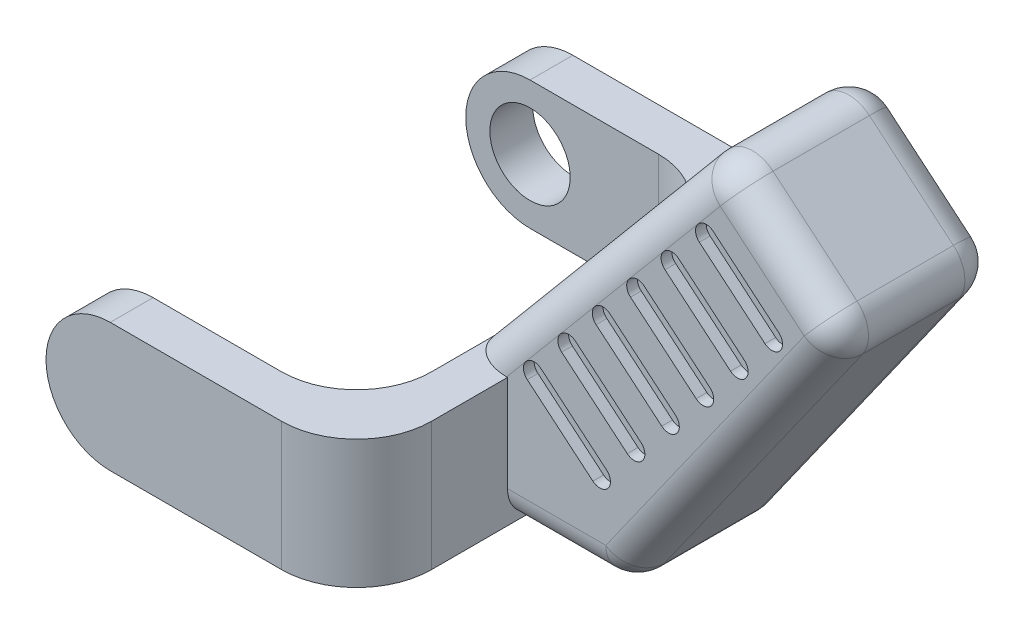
ISO-10303-21;
HEADER;
FILE_DESCRIPTION(('STEP AP214'),'2;1');
FILE_NAME('part.step','',(''),(''),'','','');
FILE_SCHEMA(('AUTOMOTIVE_DESIGN { 1 0 10303 214 1 1 1 1 }'));
ENDSEC;
DATA;
#1=APPLICATION_CONTEXT('core data for automotive mechanical design processes');
#2=APPLICATION_PROTOCOL_DEFINITION('international standard','automotive_design',2000,#1);
#3=PRODUCT_CONTEXT('',#1,'mechanical');
#4=PRODUCT('Part','Part','',(#3));
#5=PRODUCT_RELATED_PRODUCT_CATEGORY('part','',(#4));
#6=PRODUCT_DEFINITION_FORMATION('','',#4);
#7=PRODUCT_DEFINITION_CONTEXT('part definition',#1,'design');
#8=PRODUCT_DEFINITION('design','',#6,#7);
#9=PRODUCT_DEFINITION_SHAPE('','',#8);
#10=(LENGTH_UNIT() NAMED_UNIT(*) SI_UNIT(.MILLI.,.METRE.));
#11=(NAMED_UNIT(*) PLANE_ANGLE_UNIT() SI_UNIT($,.RADIAN.));
#12=(NAMED_UNIT(*) SI_UNIT($,.STERADIAN.) SOLID_ANGLE_UNIT());
#13=UNCERTAINTY_MEASURE_WITH_UNIT(LENGTH_MEASURE(1.E-05),#10,'distance_accuracy_value','');
#14=(GEOMETRIC_REPRESENTATION_CONTEXT(3) GLOBAL_UNCERTAINTY_ASSIGNED_CONTEXT((#13)) GLOBAL_UNIT_ASSIGNED_CONTEXT((#10,
#11,#12)) REPRESENTATION_CONTEXT('',''));
#15=CARTESIAN_POINT('',(0.,0.,0.));
#16=DIRECTION('',(0.,0.,1.));
#17=DIRECTION('',(1.,0.,0.));
#18=AXIS2_PLACEMENT_3D('',#15,#16,#17);
#19=CARTESIAN_POINT('',(4.90777895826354,3.0937809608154E-11,-20.9251670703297));
#20=DIRECTION('',(0.,0.,1.));
#21=DIRECTION('',(1.,0.,0.));
#22=AXIS2_PLACEMENT_3D('',#19,#20,#21);
#23=CYLINDRICAL_SURFACE('',#22,2.74999999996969);
#24=CARTESIAN_POINT('',(4.90777895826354,3.0937809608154E-11,-20.9251670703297));
#25=DIRECTION('',(0.,0.,1.));
#26=DIRECTION('',(1.,0.,0.));
#27=AXIS2_PLACEMENT_3D('',#24,#25,#26);
#28=CIRCLE('',#27,2.74999999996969);
#29=CARTESIAN_POINT('',(7.65777895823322,3.0937809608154E-11,-20.9251670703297));
#30=VERTEX_POINT('',#29);
#31=EDGE_CURVE('E11',#30,#30,#28,.T.);
#32=ORIENTED_EDGE('',*,*,#31,.T.);
#33=EDGE_LOOP('',(#32));
#34=FACE_BOUND('',#33,.T.);
#35=CARTESIAN_POINT('',(4.90777895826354,3.0937809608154E-11,-18.9251670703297));
#36=DIRECTION('',(0.,0.,1.));
#37=DIRECTION('',(1.,0.,0.));
#38=AXIS2_PLACEMENT_3D('',#35,#36,#37);
#39=CIRCLE('',#38,2.74999999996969);
#40=CARTESIAN_POINT('',(7.65777895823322,3.0937809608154E-11,-18.9251670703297));
#41=VERTEX_POINT('',#40);
#42=EDGE_CURVE('E47',#41,#41,#39,.T.);
#43=ORIENTED_EDGE('',*,*,#42,.F.);
#44=EDGE_LOOP('',(#43));
#45=FACE_BOUND('',#44,.T.);
#46=ADVANCED_FACE('F44',(#34,#45),#23,.T.);
#47=CARTESIAN_POINT('',(4.90777895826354,3.0937809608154E-11,-20.9251670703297));
#48=DIRECTION('',(0.,0.,1.));
#49=DIRECTION('',(1.,0.,0.));
#50=AXIS2_PLACEMENT_3D('',#47,#48,#49);
#51=PLANE('',#50);
#52=ORIENTED_EDGE('',*,*,#31,.F.);
#53=EDGE_LOOP('',(#52));
#54=FACE_BOUND('',#53,.T.);
#55=ADVANCED_FACE('F59',(#54),#51,.F.);
#56=CARTESIAN_POINT('',(4.90777895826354,3.0937809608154E-11,-18.9251670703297));
#57=DIRECTION('',(0.,0.,1.));
#58=DIRECTION('',(1.,0.,0.));
#59=AXIS2_PLACEMENT_3D('',#56,#57,#58);
#60=PLANE('',#59);
#61=ORIENTED_EDGE('',*,*,#42,.T.);
#62=EDGE_LOOP('',(#61));
#63=FACE_BOUND('',#62,.T.);
#64=ADVANCED_FACE('F56',(#63),#60,.T.);
#65=CLOSED_SHELL('',(#46,#55,#64));
#66=MANIFOLD_SOLID_BREP('B2',#65);
#67=CARTESIAN_POINT('',(33.6052401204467,11.3340888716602,-33.0251670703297));
#68=DIRECTION('',(0.,0.,1.));
#69=DIRECTION('',(1.,0.,0.));
#70=AXIS2_PLACEMENT_3D('',#67,#68,#69);
#71=PLANE('',#70);
#72=DIRECTION('',(-0.766044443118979,0.642787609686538,0.));
#73=VECTOR('',#72,1.);
#74=CARTESIAN_POINT('',(30.0960317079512,7.15197713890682,-33.0251670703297));
#75=LINE('',#74,#73);
#76=CARTESIAN_POINT('',(38.9889828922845,-0.310094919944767,-33.0251670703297));
#77=VERTEX_POINT('',#76);
#78=CARTESIAN_POINT('',(27.0522608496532,9.70600414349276,-33.0251670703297));
#79=VERTEX_POINT('',#78);
#80=EDGE_CURVE('E722',#77,#79,#75,.T.);
#81=ORIENTED_EDGE('',*,*,#80,.F.);
#82=DIRECTION('',(-0.577508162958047,-0.816384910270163,0.));
#83=VECTOR('',#82,1.);
#84=CARTESIAN_POINT('',(39.8055617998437,0.844248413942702,-33.0251670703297));
#85=LINE('',#84,#83);
#86=CARTESIAN_POINT('',(38.3706434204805,-1.1842003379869,-33.0251670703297));
#87=VERTEX_POINT('',#86);
#88=EDGE_CURVE('E852',#77,#87,#85,.T.);
#89=ORIENTED_EDGE('',*,*,#88,.T.);
#90=CARTESIAN_POINT('',(36.5196576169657,2.36156577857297,-33.0251670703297));
#91=DIRECTION('',(0.,0.,1.));
#92=DIRECTION('',(1.,0.,0.));
#93=AXIS2_PLACEMENT_3D('',#90,#91,#92);
#94=CIRCLE('',#93,3.99982572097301);
#95=CARTESIAN_POINT('',(33.9486192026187,-0.702478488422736,-33.0251670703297));
#96=VERTEX_POINT('',#95);
#97=EDGE_CURVE('E807',#96,#87,#94,.T.);
#98=ORIENTED_EDGE('',*,*,#97,.F.);
#99=DIRECTION('',(0.76604444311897,-0.642787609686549,0.));
#100=VECTOR('',#99,1.);
#101=CARTESIAN_POINT('',(27.8202636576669,4.43982238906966,-33.0251670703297));
#102=LINE('',#101,#100);
#103=CARTESIAN_POINT('',(27.8202636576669,4.43982238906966,-33.0251670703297));
#104=VERTEX_POINT('',#103);
#105=EDGE_CURVE('E810',#104,#96,#102,.T.);
#106=ORIENTED_EDGE('',*,*,#105,.F.);
#107=CARTESIAN_POINT('',(30.391302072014,7.50386665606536,-33.0251670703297));
#108=DIRECTION('',(0.,0.,1.));
#109=DIRECTION('',(1.,0.,0.));
#110=AXIS2_PLACEMENT_3D('',#107,#108,#109);
#111=CIRCLE('',#110,3.99982572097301);
#112=CARTESIAN_POINT('',(26.9077789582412,5.5382439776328,-33.0251670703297));
#113=VERTEX_POINT('',#112);
#114=EDGE_CURVE('E759',#113,#104,#111,.T.);
#115=ORIENTED_EDGE('',*,*,#114,.F.);
#116=DIRECTION('',(0.,-1.,0.));
#117=VECTOR('',#116,1.);
#118=CARTESIAN_POINT('',(26.9077789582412,0.,-33.0251670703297));
#119=LINE('',#118,#117);
#120=CARTESIAN_POINT('',(26.9077789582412,9.46948933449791,-33.0251670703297));
#121=VERTEX_POINT('',#120);
#122=EDGE_CURVE('E849',#121,#113,#119,.T.);
#123=ORIENTED_EDGE('',*,*,#122,.F.);
#124=EDGE_CURVE('E808',#79,#121,#111,.T.);
#125=ORIENTED_EDGE('',*,*,#124,.F.);
#126=EDGE_LOOP('',(#81,#89,#98,#106,#115,#123,#125));
#127=FACE_BOUND('',#126,.T.);
#128=ADVANCED_FACE('F84',(#127),#71,.F.);
#129=CARTESIAN_POINT('',(30.391302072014,7.50386665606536,-43.0251670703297));
#130=DIRECTION('',(0.,0.,-1.));
#131=DIRECTION('',(-1.,0.,0.));
#132=AXIS2_PLACEMENT_3D('',#129,#130,#131);
#133=CYLINDRICAL_SURFACE('',#132,3.99982572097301);
#134=CARTESIAN_POINT('',(30.391302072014,7.50386665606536,-40.0251670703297));
#135=DIRECTION('',(0.,0.,-1.));
#136=DIRECTION('',(-1.,0.,0.));
#137=AXIS2_PLACEMENT_3D('',#134,#135,#136);
#138=CIRCLE('',#137,3.99982572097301);
#139=CARTESIAN_POINT('',(26.9077789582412,9.46948933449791,-40.0251670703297));
#140=VERTEX_POINT('',#139);
#141=CARTESIAN_POINT('',(27.0522608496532,9.70600414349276,-40.0251670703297));
#142=VERTEX_POINT('',#141);
#143=EDGE_CURVE('E784',#140,#142,#138,.T.);
#144=ORIENTED_EDGE('',*,*,#143,.T.);
#145=DIRECTION('',(0.,0.,-1.));
#146=VECTOR('',#145,1.);
#147=CARTESIAN_POINT('',(27.0522608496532,9.70600414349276,-43.0251670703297));
#148=LINE('',#147,#146);
#149=CARTESIAN_POINT('',(27.0522608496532,9.70600414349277,-41.0251670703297));
#150=VERTEX_POINT('',#149);
#151=EDGE_CURVE('E733',#142,#150,#148,.T.);
#152=ORIENTED_EDGE('',*,*,#151,.T.);
#153=CARTESIAN_POINT('',(30.391302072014,7.50386665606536,-41.0251670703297));
#154=DIRECTION('',(0.,0.,-1.));
#155=DIRECTION('',(-1.,0.,0.));
#156=AXIS2_PLACEMENT_3D('',#153,#154,#155);
#157=CIRCLE('',#156,3.99982572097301);
#158=CARTESIAN_POINT('',(26.9077789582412,9.46948933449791,-41.0251670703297));
#159=VERTEX_POINT('',#158);
#160=EDGE_CURVE('E776',#159,#150,#157,.T.);
#161=ORIENTED_EDGE('',*,*,#160,.F.);
#162=DIRECTION('',(0.,0.,-1.));
#163=VECTOR('',#162,1.);
#164=CARTESIAN_POINT('',(26.9077789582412,9.46948933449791,-43.0251670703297));
#165=LINE('',#164,#163);
#166=EDGE_CURVE('E832',#159,#140,#165,.F.);
#167=ORIENTED_EDGE('',*,*,#166,.T.);
#168=EDGE_LOOP('',(#144,#152,#161,#167));
#169=FACE_BOUND('',#168,.T.);
#170=ADVANCED_FACE('F1518',(#169),#133,.T.);
#171=CARTESIAN_POINT('',(43.2470542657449,22.8247555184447,-40.0251670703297));
#172=DIRECTION('',(0.,0.,-1.));
#173=DIRECTION('',(-1.,0.,0.));
#174=AXIS2_PLACEMENT_3D('',#171,#172,#173);
#175=PLANE('',#174);
#176=DIRECTION('',(0.766044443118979,-0.642787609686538,0.));
#177=VECTOR('',#176,1.);
#178=CARTESIAN_POINT('',(30.0960317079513,7.15197713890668,-40.0251670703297));
#179=LINE('',#178,#177);
#180=CARTESIAN_POINT('',(38.9889828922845,-0.310094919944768,-40.0251670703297));
#181=VERTEX_POINT('',#180);
#182=EDGE_CURVE('E731',#142,#181,#179,.T.);
#183=ORIENTED_EDGE('',*,*,#182,.F.);
#184=ORIENTED_EDGE('',*,*,#143,.F.);
#185=DIRECTION('',(0.,-1.,0.));
#186=VECTOR('',#185,1.);
#187=CARTESIAN_POINT('',(26.9077789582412,7.50386665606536,-40.0251670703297));
#188=LINE('',#187,#186);
#189=CARTESIAN_POINT('',(26.9077789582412,5.5382439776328,-40.0251670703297));
#190=VERTEX_POINT('',#189);
#191=EDGE_CURVE('E854',#140,#190,#188,.T.);
#192=ORIENTED_EDGE('',*,*,#191,.T.);
#193=CARTESIAN_POINT('',(27.8202636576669,4.43982238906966,-40.0251670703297));
#194=VERTEX_POINT('',#193);
#195=EDGE_CURVE('E790',#194,#190,#138,.T.);
#196=ORIENTED_EDGE('',*,*,#195,.F.);
#197=DIRECTION('',(-0.76604444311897,0.642787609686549,0.));
#198=VECTOR('',#197,1.);
#199=CARTESIAN_POINT('',(27.8202636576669,4.43982238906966,-40.0251670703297));
#200=LINE('',#199,#198);
#201=CARTESIAN_POINT('',(33.9486192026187,-0.702478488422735,-40.0251670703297));
#202=VERTEX_POINT('',#201);
#203=EDGE_CURVE('E798',#202,#194,#200,.T.);
#204=ORIENTED_EDGE('',*,*,#203,.F.);
#205=CARTESIAN_POINT('',(36.5196576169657,2.36156577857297,-40.0251670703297));
#206=DIRECTION('',(0.,0.,-1.));
#207=DIRECTION('',(-1.,0.,0.));
#208=AXIS2_PLACEMENT_3D('',#205,#206,#207);
#209=CIRCLE('',#208,3.99982572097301);
#210=CARTESIAN_POINT('',(38.3706434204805,-1.1842003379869,-40.0251670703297));
#211=VERTEX_POINT('',#210);
#212=EDGE_CURVE('E793',#211,#202,#209,.T.);
#213=ORIENTED_EDGE('',*,*,#212,.F.);
#214=DIRECTION('',(0.577508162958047,0.816384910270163,0.));
#215=VECTOR('',#214,1.);
#216=CARTESIAN_POINT('',(39.8055617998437,0.844248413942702,-40.0251670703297));
#217=LINE('',#216,#215);
#218=EDGE_CURVE('E846',#211,#181,#217,.T.);
#219=ORIENTED_EDGE('',*,*,#218,.T.);
#220=EDGE_LOOP('',(#183,#184,#192,#196,#204,#213,#219));
#221=FACE_BOUND('',#220,.T.);
#222=ADVANCED_FACE('F1526',(#221),#175,.F.);
#223=CARTESIAN_POINT('',(30.391302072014,7.50386665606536,-30.0251670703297));
#224=DIRECTION('',(0.,0.,1.));
#225=DIRECTION('',(1.,0.,0.));
#226=AXIS2_PLACEMENT_3D('',#223,#224,#225);
#227=CYLINDRICAL_SURFACE('',#226,3.99982572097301);
#228=CARTESIAN_POINT('',(30.391302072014,7.50386665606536,-32.0251670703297));
#229=DIRECTION('',(0.,0.,1.));
#230=DIRECTION('',(1.,0.,0.));
#231=AXIS2_PLACEMENT_3D('',#228,#229,#230);
#232=CIRCLE('',#231,3.99982572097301);
#233=CARTESIAN_POINT('',(27.0522608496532,9.70600414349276,-32.0251670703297));
#234=VERTEX_POINT('',#233);
#235=CARTESIAN_POINT('',(26.9077789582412,9.46948933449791,-32.0251670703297));
#236=VERTEX_POINT('',#235);
#237=EDGE_CURVE('E736',#234,#236,#232,.T.);
#238=ORIENTED_EDGE('',*,*,#237,.F.);
#239=DIRECTION('',(0.,0.,1.));
#240=VECTOR('',#239,1.);
#241=CARTESIAN_POINT('',(27.0522608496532,9.70600414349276,-30.0251670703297));
#242=LINE('',#241,#240);
#243=EDGE_CURVE('E1312',#234,#79,#242,.F.);
#244=ORIENTED_EDGE('',*,*,#243,.T.);
#245=ORIENTED_EDGE('',*,*,#124,.T.);
#246=DIRECTION('',(0.,0.,1.));
#247=VECTOR('',#246,1.);
#248=CARTESIAN_POINT('',(26.9077789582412,9.46948933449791,-30.0251670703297));
#249=LINE('',#248,#247);
#250=EDGE_CURVE('E838',#236,#121,#249,.F.);
#251=ORIENTED_EDGE('',*,*,#250,.F.);
#252=EDGE_LOOP('',(#238,#244,#245,#251));
#253=FACE_BOUND('',#252,.T.);
#254=ADVANCED_FACE('F1529',(#253),#227,.T.);
#255=CARTESIAN_POINT('',(23.9077789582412,6.00000000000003,-4.02516707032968));
#256=DIRECTION('',(0.76604444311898,-0.642787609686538,0.));
#257=DIRECTION('',(0.642787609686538,0.76604444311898,0.));
#258=AXIS2_PLACEMENT_3D('',#255,#256,#257);
#259=PLANE('',#258);
#260=DIRECTION('',(0.,0.,-1.));
#261=VECTOR('',#260,1.);
#262=CARTESIAN_POINT('',(26.9077789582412,9.57526077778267,0.));
#263=LINE('',#262,#261);
#264=CARTESIAN_POINT('',(26.9077789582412,9.57526077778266,-32.0251670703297));
#265=VERTEX_POINT('',#264);
#266=CARTESIAN_POINT('',(26.9077789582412,9.57526077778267,-41.0251670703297));
#267=VERTEX_POINT('',#266);
#268=EDGE_CURVE('E768',#265,#267,#263,.T.);
#269=ORIENTED_EDGE('',*,*,#268,.T.);
#270=DIRECTION('',(-0.642787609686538,-0.76604444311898,0.));
#271=VECTOR('',#270,1.);
#272=CARTESIAN_POINT('',(23.9077789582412,6.00000000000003,-41.0251670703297));
#273=LINE('',#272,#271);
#274=CARTESIAN_POINT('',(23.9077789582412,6.00000000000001,-41.0251670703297));
#275=VERTEX_POINT('',#274);
#276=EDGE_CURVE('E1354',#267,#275,#273,.T.);
#277=ORIENTED_EDGE('',*,*,#276,.T.);
#278=DIRECTION('',(0.,0.,-1.));
#279=VECTOR('',#278,1.);
#280=CARTESIAN_POINT('',(23.9077789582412,6.00000000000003,-4.02516707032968));
#281=LINE('',#280,#279);
#282=CARTESIAN_POINT('',(23.9077789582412,6.00000000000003,-32.0251670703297));
#283=VERTEX_POINT('',#282);
#284=EDGE_CURVE('E1234',#283,#275,#281,.T.);
#285=ORIENTED_EDGE('',*,*,#284,.F.);
#286=DIRECTION('',(0.642787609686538,0.76604444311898,0.));
#287=VECTOR('',#286,1.);
#288=CARTESIAN_POINT('',(47.402568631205,34.,-32.0251670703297));
#289=LINE('',#288,#287);
#290=EDGE_CURVE('E1352',#283,#265,#289,.T.);
#291=ORIENTED_EDGE('',*,*,#290,.T.);
#292=EDGE_LOOP('',(#269,#277,#285,#291));
#293=FACE_BOUND('',#292,.T.);
#294=ADVANCED_FACE('F1533',(#293),#259,.F.);
#295=CARTESIAN_POINT('',(27.9077789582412,-6.,-14.9251670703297));
#296=DIRECTION('',(-1.,0.,0.));
#297=DIRECTION('',(0.,-1.,0.));
#298=AXIS2_PLACEMENT_3D('',#295,#296,#297);
#299=PLANE('',#298);
#300=DIRECTION('',(0.,0.,-1.));
#301=VECTOR('',#300,1.);
#302=CARTESIAN_POINT('',(27.9077789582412,-6.,-14.9251670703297));
#303=LINE('',#302,#301);
#304=CARTESIAN_POINT('',(27.9077789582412,-6.,-41.0251670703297));
#305=VERTEX_POINT('',#304);
#306=CARTESIAN_POINT('',(27.9077789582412,-6.,-51.1251670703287));
#307=VERTEX_POINT('',#306);
#308=EDGE_CURVE('E1301',#305,#307,#303,.T.);
#309=ORIENTED_EDGE('',*,*,#308,.T.);
#310=DIRECTION('',(0.,1.,0.));
#311=VECTOR('',#310,1.);
#312=CARTESIAN_POINT('',(27.9077789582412,6.00000000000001,-51.1251670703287));
#313=LINE('',#312,#311);
#314=CARTESIAN_POINT('',(27.9077789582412,6.,-51.1251670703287));
#315=VERTEX_POINT('',#314);
#316=EDGE_CURVE('E1335',#307,#315,#313,.T.);
#317=ORIENTED_EDGE('',*,*,#316,.T.);
#318=DIRECTION('',(0.,0.,-1.));
#319=VECTOR('',#318,1.);
#320=CARTESIAN_POINT('',(27.9077789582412,6.,-14.9251670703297));
#321=LINE('',#320,#319);
#322=CARTESIAN_POINT('',(27.9077789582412,6.,-44.0251670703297));
#323=VERTEX_POINT('',#322);
#324=EDGE_CURVE('E1297',#323,#315,#321,.T.);
#325=ORIENTED_EDGE('',*,*,#324,.F.);
#326=DIRECTION('',(0.,-1.,0.));
#327=VECTOR('',#326,1.);
#328=CARTESIAN_POINT('',(27.9077789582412,-6.,-44.0251670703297));
#329=LINE('',#328,#327);
#330=CARTESIAN_POINT('',(27.9077789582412,-3.,-44.0251670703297));
#331=VERTEX_POINT('',#330);
#332=EDGE_CURVE('E1244',#323,#331,#329,.T.);
#333=ORIENTED_EDGE('',*,*,#332,.T.);
#334=CARTESIAN_POINT('',(27.9077789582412,-3.,-41.0251670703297));
#335=DIRECTION('',(-1.,0.,0.));
#336=DIRECTION('',(0.,-1.,0.));
#337=AXIS2_PLACEMENT_3D('',#334,#335,#336);
#338=CIRCLE('',#337,3.);
#339=EDGE_CURVE('E1405',#331,#305,#338,.T.);
#340=ORIENTED_EDGE('',*,*,#339,.T.);
#341=EDGE_LOOP('',(#309,#317,#325,#333,#340));
#342=FACE_BOUND('',#341,.T.);
#343=ADVANCED_FACE('F1787',(#342),#299,.F.);
#344=CARTESIAN_POINT('',(27.9077789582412,6.,-14.9251670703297));
#345=DIRECTION('',(0.,-1.,0.));
#346=DIRECTION('',(1.,0.,0.));
#347=AXIS2_PLACEMENT_3D('',#344,#345,#346);
#348=PLANE('',#347);
#349=ORIENTED_EDGE('',*,*,#324,.T.);
#350=CARTESIAN_POINT('',(20.9077789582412,6.00000000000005,-51.1251670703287));
#351=DIRECTION('',(0.,-1.,0.));
#352=DIRECTION('',(1.,0.,0.));
#353=AXIS2_PLACEMENT_3D('',#350,#351,#352);
#354=CIRCLE('',#353,7.);
#355=CARTESIAN_POINT('',(20.9077789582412,6.00000000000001,-58.1251670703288));
#356=VERTEX_POINT('',#355);
#357=EDGE_CURVE('E1338',#315,#356,#354,.F.);
#358=ORIENTED_EDGE('',*,*,#357,.T.);
#359=DIRECTION('',(1.,0.,0.));
#360=VECTOR('',#359,1.);
#361=CARTESIAN_POINT('',(23.9077789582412,6.00000000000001,-58.1251670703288));
#362=LINE('',#361,#360);
#363=CARTESIAN_POINT('',(4.90777895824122,6.00000000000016,-58.1251670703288));
#364=VERTEX_POINT('',#363);
#365=EDGE_CURVE('E1272',#364,#356,#362,.T.);
#366=ORIENTED_EDGE('',*,*,#365,.F.);
#367=DIRECTION('',(0.,0.,1.));
#368=VECTOR('',#367,1.);
#369=CARTESIAN_POINT('',(4.90777895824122,6.00000000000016,-58.1251670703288));
#370=LINE('',#369,#368);
#371=CARTESIAN_POINT('',(4.90777895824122,6.00000000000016,-54.1251670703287));
#372=VERTEX_POINT('',#371);
#373=EDGE_CURVE('E1255',#364,#372,#370,.T.);
#374=ORIENTED_EDGE('',*,*,#373,.T.);
#375=DIRECTION('',(1.,0.,0.));
#376=VECTOR('',#375,1.);
#377=CARTESIAN_POINT('',(27.9077789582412,6.,-54.1251670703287));
#378=LINE('',#377,#376);
#379=CARTESIAN_POINT('',(16.9077789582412,6.00000000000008,-54.1251670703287));
#380=VERTEX_POINT('',#379);
#381=EDGE_CURVE('E1256',#372,#380,#378,.T.);
#382=ORIENTED_EDGE('',*,*,#381,.T.);
#383=CARTESIAN_POINT('',(16.9077789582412,6.00000000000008,-47.1251670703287));
#384=DIRECTION('',(0.,-1.,0.));
#385=DIRECTION('',(1.,0.,0.));
#386=AXIS2_PLACEMENT_3D('',#383,#384,#385);
#387=CIRCLE('',#386,7.);
#388=CARTESIAN_POINT('',(23.9077789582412,6.00000000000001,-47.1251670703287));
#389=VERTEX_POINT('',#388);
#390=EDGE_CURVE('E1348',#380,#389,#387,.T.);
#391=ORIENTED_EDGE('',*,*,#390,.T.);
#392=DIRECTION('',(0.,0.,1.));
#393=VECTOR('',#392,1.);
#394=CARTESIAN_POINT('',(23.9077789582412,6.00000000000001,-58.1251670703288));
#395=LINE('',#394,#393);
#396=EDGE_CURVE('E1267',#389,#275,#395,.T.);
#397=ORIENTED_EDGE('',*,*,#396,.T.);
#398=CARTESIAN_POINT('',(27.824000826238,6.00000000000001,-41.0251670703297));
#399=DIRECTION('',(0.,-1.,0.));
#400=DIRECTION('',(1.,0.,0.));
#401=AXIS2_PLACEMENT_3D('',#398,#399,#400);
#402=ELLIPSE('',#401,3.91622186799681,3.);
#403=CARTESIAN_POINT('',(27.824000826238,6.00000000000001,-44.0251670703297));
#404=VERTEX_POINT('',#403);
#405=EDGE_CURVE('E1398',#275,#404,#402,.T.);
#406=ORIENTED_EDGE('',*,*,#405,.T.);
#407=DIRECTION('',(1.,0.,0.));
#408=VECTOR('',#407,1.);
#409=CARTESIAN_POINT('',(27.9077789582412,6.,-44.0251670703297));
#410=LINE('',#409,#408);
#411=EDGE_CURVE('E1310',#404,#323,#410,.T.);
#412=ORIENTED_EDGE('',*,*,#411,.T.);
#413=EDGE_LOOP('',(#349,#358,#366,#374,#382,#391,#397,#406,#412));
#414=FACE_BOUND('',#413,.T.);
#415=ADVANCED_FACE('F1819',(#414),#348,.F.);
#416=CARTESIAN_POINT('',(23.9077789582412,0.,0.));
#417=DIRECTION('',(1.,0.,0.));
#418=DIRECTION('',(0.,1.,0.));
#419=AXIS2_PLACEMENT_3D('',#416,#417,#418);
#420=PLANE('',#419);
#421=DIRECTION('',(0.,0.,-1.));
#422=VECTOR('',#421,1.);
#423=CARTESIAN_POINT('',(23.9077789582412,-6.,-58.1251670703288));
#424=LINE('',#423,#422);
#425=CARTESIAN_POINT('',(23.9077789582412,-6.,-25.9251670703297));
#426=VERTEX_POINT('',#425);
#427=CARTESIAN_POINT('',(23.9077789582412,-6.,-47.1251670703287));
#428=VERTEX_POINT('',#427);
#429=EDGE_CURVE('E1269',#426,#428,#424,.T.);
#430=ORIENTED_EDGE('',*,*,#429,.F.);
#431=DIRECTION('',(0.,1.,0.));
#432=VECTOR('',#431,1.);
#433=CARTESIAN_POINT('',(23.9077789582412,6.,-25.9251670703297));
#434=LINE('',#433,#432);
#435=CARTESIAN_POINT('',(23.9077789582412,6.00000000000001,-25.9251670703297));
#436=VERTEX_POINT('',#435);
#437=EDGE_CURVE('E1317',#426,#436,#434,.T.);
#438=ORIENTED_EDGE('',*,*,#437,.T.);
#439=EDGE_CURVE('E107',#283,#436,#395,.T.);
#440=ORIENTED_EDGE('',*,*,#439,.F.);
#441=ORIENTED_EDGE('',*,*,#284,.T.);
#442=ORIENTED_EDGE('',*,*,#396,.F.);
#443=DIRECTION('',(0.,1.,0.));
#444=VECTOR('',#443,1.);
#445=CARTESIAN_POINT('',(23.9077789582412,-5.99999999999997,-47.1251670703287));
#446=LINE('',#445,#444);
#447=EDGE_CURVE('E1315',#389,#428,#446,.F.);
#448=ORIENTED_EDGE('',*,*,#447,.T.);
#449=EDGE_LOOP('',(#430,#438,#440,#441,#442,#448));
#450=FACE_BOUND('',#449,.T.);
#451=ADVANCED_FACE('F1815',(#450),#420,.F.);
#452=CARTESIAN_POINT('',(4.90777895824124,1.56874809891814E-13,-18.9251670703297));
#453=DIRECTION('',(0.,0.,1.));
#454=DIRECTION('',(1.,0.,0.));
#455=AXIS2_PLACEMENT_3D('',#452,#453,#454);
#456=PLANE('',#455);
#457=DIRECTION('',(-1.,0.,0.));
#458=VECTOR('',#457,1.);
#459=CARTESIAN_POINT('',(27.9077789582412,6.,-18.9251670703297));
#460=LINE('',#459,#458);
#461=CARTESIAN_POINT('',(16.9077789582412,6.00000000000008,-18.9251670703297));
#462=VERTEX_POINT('',#461);
#463=CARTESIAN_POINT('',(4.90777895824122,6.00000000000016,-18.9251670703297));
#464=VERTEX_POINT('',#463);
#465=EDGE_CURVE('E1283',#462,#464,#460,.T.);
#466=ORIENTED_EDGE('',*,*,#465,.F.);
#467=DIRECTION('',(0.,1.,0.));
#468=VECTOR('',#467,1.);
#469=CARTESIAN_POINT('',(16.9077789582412,-6.,-18.9251670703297));
#470=LINE('',#469,#468);
#471=CARTESIAN_POINT('',(16.9077789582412,-5.99999999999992,-18.9251670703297));
#472=VERTEX_POINT('',#471);
#473=EDGE_CURVE('E1319',#462,#472,#470,.F.);
#474=ORIENTED_EDGE('',*,*,#473,.T.);
#475=DIRECTION('',(1.,0.,0.));
#476=VECTOR('',#475,1.);
#477=CARTESIAN_POINT('',(4.9077789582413,-5.99999999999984,-18.9251670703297));
#478=LINE('',#477,#476);
#479=CARTESIAN_POINT('',(4.9077789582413,-5.99999999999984,-18.9251670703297));
#480=VERTEX_POINT('',#479);
#481=EDGE_CURVE('E1291',#480,#472,#478,.T.);
#482=ORIENTED_EDGE('',*,*,#481,.F.);
#483=CARTESIAN_POINT('',(4.90777895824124,1.56874809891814E-13,-18.9251670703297));
#484=DIRECTION('',(0.,0.,1.));
#485=DIRECTION('',(1.,0.,0.));
#486=AXIS2_PLACEMENT_3D('',#483,#484,#485);
#487=CIRCLE('',#486,6.);
#488=EDGE_CURVE('E1276',#464,#480,#487,.T.);
#489=ORIENTED_EDGE('',*,*,#488,.F.);
#490=EDGE_LOOP('',(#466,#474,#482,#489));
#491=FACE_BOUND('',#490,.T.);
#492=ADVANCED_FACE('F1818',(#491),#456,.F.);
#493=CARTESIAN_POINT('',(4.90777895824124,1.56874809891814E-13,-14.9251670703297));
#494=DIRECTION('',(0.,0.,-1.));
#495=DIRECTION('',(-1.,0.,0.));
#496=AXIS2_PLACEMENT_3D('',#493,#494,#495);
#497=CYLINDRICAL_SURFACE('',#496,6.);
#498=ORIENTED_EDGE('',*,*,#488,.T.);
#499=DIRECTION('',(0.,0.,-1.));
#500=VECTOR('',#499,1.);
#501=CARTESIAN_POINT('',(4.9077789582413,-5.99999999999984,-14.9251670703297));
#502=LINE('',#501,#500);
#503=CARTESIAN_POINT('',(4.9077789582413,-5.99999999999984,-14.9251670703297));
#504=VERTEX_POINT('',#503);
#505=EDGE_CURVE('E1304',#504,#480,#502,.T.);
#506=ORIENTED_EDGE('',*,*,#505,.F.);
#507=CARTESIAN_POINT('',(4.90777895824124,1.56874809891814E-13,-14.9251670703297));
#508=DIRECTION('',(0.,0.,1.));
#509=DIRECTION('',(1.,0.,0.));
#510=AXIS2_PLACEMENT_3D('',#507,#508,#509);
#511=CIRCLE('',#510,6.);
#512=CARTESIAN_POINT('',(4.90777895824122,6.00000000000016,-14.9251670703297));
#513=VERTEX_POINT('',#512);
#514=EDGE_CURVE('E1279',#513,#504,#511,.T.);
#515=ORIENTED_EDGE('',*,*,#514,.F.);
#516=DIRECTION('',(0.,0.,-1.));
#517=VECTOR('',#516,1.);
#518=CARTESIAN_POINT('',(4.90777895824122,6.00000000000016,-14.9251670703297));
#519=LINE('',#518,#517);
#520=EDGE_CURVE('E1288',#513,#464,#519,.T.);
#521=ORIENTED_EDGE('',*,*,#520,.T.);
#522=EDGE_LOOP('',(#498,#506,#515,#521));
#523=FACE_BOUND('',#522,.T.);
#524=ADVANCED_FACE('F1830',(#523),#497,.T.);
#525=CARTESIAN_POINT('',(4.9077789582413,-5.99999999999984,-14.9251670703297));
#526=DIRECTION('',(0.,1.,0.));
#527=DIRECTION('',(-1.,0.,0.));
#528=AXIS2_PLACEMENT_3D('',#525,#526,#527);
#529=PLANE('',#528);
#530=DIRECTION('',(-1.,0.,0.));
#531=VECTOR('',#530,1.);
#532=CARTESIAN_POINT('',(27.9077789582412,-6.,-32.0251670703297));
#533=LINE('',#532,#531);
#534=CARTESIAN_POINT('',(37.0861523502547,-6.00000000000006,-32.0251670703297));
#535=VERTEX_POINT('',#534);
#536=CARTESIAN_POINT('',(27.9077789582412,-6.,-32.0251670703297));
#537=VERTEX_POINT('',#536);
#538=EDGE_CURVE('E1395',#535,#537,#533,.T.);
#539=ORIENTED_EDGE('',*,*,#538,.T.);
#540=CARTESIAN_POINT('',(27.9077789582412,-6.,-21.9251670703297));
#541=VERTEX_POINT('',#540);
#542=EDGE_CURVE('E1302',#541,#537,#303,.T.);
#543=ORIENTED_EDGE('',*,*,#542,.F.);
#544=CARTESIAN_POINT('',(20.9077789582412,-5.99999999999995,-21.9251670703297));
#545=DIRECTION('',(0.,1.,0.));
#546=DIRECTION('',(-1.,0.,0.));
#547=AXIS2_PLACEMENT_3D('',#544,#545,#546);
#548=CIRCLE('',#547,7.);
#549=CARTESIAN_POINT('',(20.9077789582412,-5.99999999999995,-14.9251670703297));
#550=VERTEX_POINT('',#549);
#551=EDGE_CURVE('E1333',#541,#550,#548,.F.);
#552=ORIENTED_EDGE('',*,*,#551,.T.);
#553=DIRECTION('',(1.,0.,0.));
#554=VECTOR('',#553,1.);
#555=CARTESIAN_POINT('',(4.9077789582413,-5.99999999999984,-14.9251670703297));
#556=LINE('',#555,#554);
#557=EDGE_CURVE('E1282',#504,#550,#556,.T.);
#558=ORIENTED_EDGE('',*,*,#557,.F.);
#559=ORIENTED_EDGE('',*,*,#505,.T.);
#560=ORIENTED_EDGE('',*,*,#481,.T.);
#561=CARTESIAN_POINT('',(16.9077789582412,-5.99999999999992,-25.9251670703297));
#562=DIRECTION('',(0.,1.,0.));
#563=DIRECTION('',(-1.,0.,0.));
#564=AXIS2_PLACEMENT_3D('',#561,#562,#563);
#565=CIRCLE('',#564,7.);
#566=EDGE_CURVE('E1346',#472,#426,#565,.T.);
#567=ORIENTED_EDGE('',*,*,#566,.T.);
#568=ORIENTED_EDGE('',*,*,#429,.T.);
#569=CARTESIAN_POINT('',(16.9077789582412,-5.99999999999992,-47.1251670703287));
#570=DIRECTION('',(0.,1.,0.));
#571=DIRECTION('',(-1.,0.,0.));
#572=AXIS2_PLACEMENT_3D('',#569,#570,#571);
#573=CIRCLE('',#572,7.);
#574=CARTESIAN_POINT('',(16.9077789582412,-5.99999999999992,-54.1251670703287));
#575=VERTEX_POINT('',#574);
#576=EDGE_CURVE('E1350',#428,#575,#573,.T.);
#577=ORIENTED_EDGE('',*,*,#576,.T.);
#578=DIRECTION('',(-1.,0.,0.));
#579=VECTOR('',#578,1.);
#580=CARTESIAN_POINT('',(4.9077789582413,-5.99999999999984,-54.1251670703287));
#581=LINE('',#580,#579);
#582=CARTESIAN_POINT('',(4.9077789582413,-5.99999999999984,-54.1251670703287));
#583=VERTEX_POINT('',#582);
#584=EDGE_CURVE('E1249',#575,#583,#581,.T.);
#585=ORIENTED_EDGE('',*,*,#584,.T.);
#586=DIRECTION('',(0.,0.,1.));
#587=VECTOR('',#586,1.);
#588=CARTESIAN_POINT('',(4.9077789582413,-5.99999999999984,-58.1251670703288));
#589=LINE('',#588,#587);
#590=CARTESIAN_POINT('',(4.9077789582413,-5.99999999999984,-58.1251670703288));
#591=VERTEX_POINT('',#590);
#592=EDGE_CURVE('E1264',#591,#583,#589,.T.);
#593=ORIENTED_EDGE('',*,*,#592,.F.);
#594=DIRECTION('',(1.,0.,0.));
#595=VECTOR('',#594,1.);
#596=CARTESIAN_POINT('',(23.9077789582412,-6.,-58.1251670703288));
#597=LINE('',#596,#595);
#598=CARTESIAN_POINT('',(20.9077789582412,-6.,-58.1251670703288));
#599=VERTEX_POINT('',#598);
#600=EDGE_CURVE('E1273',#591,#599,#597,.T.);
#601=ORIENTED_EDGE('',*,*,#600,.T.);
#602=CARTESIAN_POINT('',(20.9077789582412,-5.99999999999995,-51.1251670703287));
#603=DIRECTION('',(0.,1.,0.));
#604=DIRECTION('',(-1.,0.,0.));
#605=AXIS2_PLACEMENT_3D('',#602,#603,#604);
#606=CIRCLE('',#605,7.);
#607=EDGE_CURVE('E1331',#599,#307,#606,.F.);
#608=ORIENTED_EDGE('',*,*,#607,.T.);
#609=ORIENTED_EDGE('',*,*,#308,.F.);
#610=DIRECTION('',(1.,0.,0.));
#611=VECTOR('',#610,1.);
#612=CARTESIAN_POINT('',(38.6386988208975,-6.00000000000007,-41.0251670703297));
#613=LINE('',#612,#611);
#614=CARTESIAN_POINT('',(37.0861523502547,-6.00000000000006,-41.0251670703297));
#615=VERTEX_POINT('',#614);
#616=EDGE_CURVE('E1393',#305,#615,#613,.T.);
#617=ORIENTED_EDGE('',*,*,#616,.T.);
#618=DIRECTION('',(0.,0.,-1.));
#619=VECTOR('',#618,1.);
#620=CARTESIAN_POINT('',(37.0861523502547,-6.00000000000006,-14.9251670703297));
#621=LINE('',#620,#619);
#622=EDGE_CURVE('E1391',#615,#535,#621,.F.);
#623=ORIENTED_EDGE('',*,*,#622,.T.);
#624=EDGE_LOOP('',(#539,#543,#552,#558,#559,#560,#567,#568,#577,#585,#593,#601,#608,#609,#617,#623));
#625=FACE_BOUND('',#624,.T.);
#626=ADVANCED_FACE('F1838',(#625),#529,.F.);
#627=CARTESIAN_POINT('',(27.9077789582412,6.,-21.9251670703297));
#628=VERTEX_POINT('',#627);
#629=CARTESIAN_POINT('',(27.9077789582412,6.,-29.0251670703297));
#630=VERTEX_POINT('',#629);
#631=EDGE_CURVE('E1298',#628,#630,#321,.T.);
#632=ORIENTED_EDGE('',*,*,#631,.F.);
#633=DIRECTION('',(0.,1.,0.));
#634=VECTOR('',#633,1.);
#635=CARTESIAN_POINT('',(27.9077789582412,-6.,-21.9251670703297));
#636=LINE('',#635,#634);
#637=EDGE_CURVE('E1329',#628,#541,#636,.F.);
#638=ORIENTED_EDGE('',*,*,#637,.T.);
#639=ORIENTED_EDGE('',*,*,#542,.T.);
#640=CARTESIAN_POINT('',(27.9077789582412,-3.,-32.0251670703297));
#641=DIRECTION('',(-1.,0.,0.));
#642=DIRECTION('',(0.,-1.,0.));
#643=AXIS2_PLACEMENT_3D('',#640,#641,#642);
#644=CIRCLE('',#643,3.);
#645=CARTESIAN_POINT('',(27.9077789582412,-3.,-29.0251670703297));
#646=VERTEX_POINT('',#645);
#647=EDGE_CURVE('E1403',#537,#646,#644,.T.);
#648=ORIENTED_EDGE('',*,*,#647,.T.);
#649=DIRECTION('',(0.,1.,0.));
#650=VECTOR('',#649,1.);
#651=CARTESIAN_POINT('',(27.9077789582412,-6.,-29.0251670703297));
#652=LINE('',#651,#650);
#653=EDGE_CURVE('E1242',#646,#630,#652,.T.);
#654=ORIENTED_EDGE('',*,*,#653,.T.);
#655=EDGE_LOOP('',(#632,#638,#639,#648,#654));
#656=FACE_BOUND('',#655,.T.);
#657=ADVANCED_FACE('F1834',(#656),#299,.F.);
#658=DIRECTION('',(-1.,0.,0.));
#659=VECTOR('',#658,1.);
#660=CARTESIAN_POINT('',(27.9077789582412,6.,-14.9251670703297));
#661=LINE('',#660,#659);
#662=CARTESIAN_POINT('',(20.9077789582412,6.00000000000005,-14.9251670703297));
#663=VERTEX_POINT('',#662);
#664=EDGE_CURVE('E1286',#663,#513,#661,.T.);
#665=ORIENTED_EDGE('',*,*,#664,.F.);
#666=CARTESIAN_POINT('',(20.9077789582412,6.00000000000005,-21.9251670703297));
#667=DIRECTION('',(0.,-1.,0.));
#668=DIRECTION('',(1.,0.,0.));
#669=AXIS2_PLACEMENT_3D('',#666,#667,#668);
#670=CIRCLE('',#669,7.);
#671=EDGE_CURVE('E1327',#663,#628,#670,.F.);
#672=ORIENTED_EDGE('',*,*,#671,.T.);
#673=ORIENTED_EDGE('',*,*,#631,.T.);
#674=DIRECTION('',(-1.,0.,0.));
#675=VECTOR('',#674,1.);
#676=CARTESIAN_POINT('',(27.9077789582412,6.,-29.0251670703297));
#677=LINE('',#676,#675);
#678=CARTESIAN_POINT('',(27.824000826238,6.00000000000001,-29.0251670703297));
#679=VERTEX_POINT('',#678);
#680=EDGE_CURVE('E1307',#630,#679,#677,.T.);
#681=ORIENTED_EDGE('',*,*,#680,.T.);
#682=CARTESIAN_POINT('',(27.824000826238,6.00000000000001,-32.0251670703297));
#683=DIRECTION('',(0.,-1.,0.));
#684=DIRECTION('',(-1.,0.,0.));
#685=AXIS2_PLACEMENT_3D('',#682,#683,#684);
#686=ELLIPSE('',#685,3.91622186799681,3.);
#687=EDGE_CURVE('E1400',#679,#283,#686,.T.);
#688=ORIENTED_EDGE('',*,*,#687,.T.);
#689=ORIENTED_EDGE('',*,*,#439,.T.);
#690=CARTESIAN_POINT('',(16.9077789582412,6.00000000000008,-25.9251670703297));
#691=DIRECTION('',(0.,-1.,0.));
#692=DIRECTION('',(1.,0.,0.));
#693=AXIS2_PLACEMENT_3D('',#690,#691,#692);
#694=CIRCLE('',#693,7.);
#695=EDGE_CURVE('E1344',#436,#462,#694,.T.);
#696=ORIENTED_EDGE('',*,*,#695,.T.);
#697=ORIENTED_EDGE('',*,*,#465,.T.);
#698=ORIENTED_EDGE('',*,*,#520,.F.);
#699=EDGE_LOOP('',(#665,#672,#673,#681,#688,#689,#696,#697,#698));
#700=FACE_BOUND('',#699,.T.);
#701=ADVANCED_FACE('F1826',(#700),#348,.F.);
#702=CARTESIAN_POINT('',(4.90777895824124,1.56874809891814E-13,-14.9251670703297));
#703=DIRECTION('',(0.,0.,1.));
#704=DIRECTION('',(1.,0.,0.));
#705=AXIS2_PLACEMENT_3D('',#702,#703,#704);
#706=PLANE('',#705);
#707=ORIENTED_EDGE('',*,*,#557,.T.);
#708=DIRECTION('',(0.,1.,0.));
#709=VECTOR('',#708,1.);
#710=CARTESIAN_POINT('',(20.9077789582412,6.,-14.9251670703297));
#711=LINE('',#710,#709);
#712=EDGE_CURVE('E1324',#550,#663,#711,.T.);
#713=ORIENTED_EDGE('',*,*,#712,.T.);
#714=ORIENTED_EDGE('',*,*,#664,.T.);
#715=ORIENTED_EDGE('',*,*,#514,.T.);
#716=EDGE_LOOP('',(#707,#713,#714,#715));
#717=FACE_BOUND('',#716,.T.);
#718=ADVANCED_FACE('F1822',(#717),#706,.T.);
#719=CARTESIAN_POINT('',(23.9077789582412,-6.,-58.1251670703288));
#720=DIRECTION('',(0.,0.,-1.));
#721=DIRECTION('',(-1.,0.,0.));
#722=AXIS2_PLACEMENT_3D('',#719,#720,#721);
#723=PLANE('',#722);
#724=DIRECTION('',(-0.998274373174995,-0.0587220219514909,0.));
#725=VECTOR('',#724,1.);
#726=CARTESIAN_POINT('',(23.674158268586,-2.028448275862,-58.1251670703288));
#727=LINE('',#726,#725);
#728=CARTESIAN_POINT('',(19.9077789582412,-2.25,-58.1251670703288));
#729=VERTEX_POINT('',#728);
#730=CARTESIAN_POINT('',(7.15777895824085,-3.00000000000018,-58.1251670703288));
#731=VERTEX_POINT('',#730);
#732=EDGE_CURVE('E692',#729,#731,#727,.T.);
#733=ORIENTED_EDGE('',*,*,#732,.F.);
#734=CARTESIAN_POINT('',(19.9077789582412,0.,-58.1251670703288));
#735=DIRECTION('',(0.,0.,-1.));
#736=DIRECTION('',(-1.,0.,0.));
#737=AXIS2_PLACEMENT_3D('',#734,#735,#736);
#738=CIRCLE('',#737,2.25);
#739=CARTESIAN_POINT('',(20.9077789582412,-2.01556443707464,-58.1251670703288));
#740=VERTEX_POINT('',#739);
#741=EDGE_CURVE('E2600',#740,#729,#738,.T.);
#742=ORIENTED_EDGE('',*,*,#741,.F.);
#743=DIRECTION('',(0.,1.,0.));
#744=VECTOR('',#743,1.);
#745=CARTESIAN_POINT('',(20.9077789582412,-6.,-58.1251670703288));
#746=LINE('',#745,#744);
#747=EDGE_CURVE('E1340',#740,#599,#746,.F.);
#748=ORIENTED_EDGE('',*,*,#747,.T.);
#749=ORIENTED_EDGE('',*,*,#600,.F.);
#750=CARTESIAN_POINT('',(4.90777895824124,1.5741881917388E-13,-58.1251670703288));
#751=DIRECTION('',(0.,0.,-1.));
#752=DIRECTION('',(0.,1.,0.));
#753=AXIS2_PLACEMENT_3D('',#750,#751,#752);
#754=CIRCLE('',#753,6.);
#755=EDGE_CURVE('E1252',#591,#364,#754,.T.);
#756=ORIENTED_EDGE('',*,*,#755,.T.);
#757=ORIENTED_EDGE('',*,*,#365,.T.);
#758=CARTESIAN_POINT('',(20.9077789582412,2.01556443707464,-58.1251670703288));
#759=VERTEX_POINT('',#758);
#760=EDGE_CURVE('E1341',#356,#759,#746,.F.);
#761=ORIENTED_EDGE('',*,*,#760,.T.);
#762=CARTESIAN_POINT('',(19.9077789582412,2.25,-58.1251670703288));
#763=VERTEX_POINT('',#762);
#764=EDGE_CURVE('E99',#763,#759,#738,.T.);
#765=ORIENTED_EDGE('',*,*,#764,.F.);
#766=DIRECTION('',(0.998274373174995,-0.0587220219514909,0.));
#767=VECTOR('',#766,1.);
#768=CARTESIAN_POINT('',(24.3776065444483,1.98706896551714,-58.1251670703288));
#769=LINE('',#768,#767);
#770=CARTESIAN_POINT('',(7.15777895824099,3.00000000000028,-58.1251670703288));
#771=VERTEX_POINT('',#770);
#772=EDGE_CURVE('E2599',#771,#763,#769,.T.);
#773=ORIENTED_EDGE('',*,*,#772,.F.);
#774=CARTESIAN_POINT('',(4.90777895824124,1.5741881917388E-13,-58.1251670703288));
#775=DIRECTION('',(0.,0.,-1.));
#776=DIRECTION('',(0.,1.,0.));
#777=AXIS2_PLACEMENT_3D('',#774,#775,#776);
#778=CIRCLE('',#777,3.75);
#779=EDGE_CURVE('E709',#731,#771,#778,.T.);
#780=ORIENTED_EDGE('',*,*,#779,.F.);
#781=EDGE_LOOP('',(#733,#742,#748,#749,#756,#757,#761,#765,#773,#780));
#782=FACE_BOUND('',#781,.T.);
#783=ADVANCED_FACE('F1810',(#782),#723,.T.);
#784=CARTESIAN_POINT('',(4.90777895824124,1.57363308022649E-13,-54.1251670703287));
#785=DIRECTION('',(0.,0.,-1.));
#786=DIRECTION('',(0.,1.,0.));
#787=AXIS2_PLACEMENT_3D('',#784,#785,#786);
#788=PLANE('',#787);
#789=CARTESIAN_POINT('',(4.90777895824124,1.57363308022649E-13,-54.1251670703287));
#790=DIRECTION('',(0.,0.,-1.));
#791=DIRECTION('',(0.,1.,0.));
#792=AXIS2_PLACEMENT_3D('',#789,#790,#791);
#793=CIRCLE('',#792,3.75);
#794=CARTESIAN_POINT('',(4.90777895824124,3.75000000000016,-54.1251670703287));
#795=VERTEX_POINT('',#794);
#796=EDGE_CURVE('E1247',#795,#795,#793,.T.);
#797=ORIENTED_EDGE('',*,*,#796,.T.);
#798=EDGE_LOOP('',(#797));
#799=FACE_BOUND('',#798,.T.);
#800=ORIENTED_EDGE('',*,*,#584,.F.);
#801=DIRECTION('',(0.,1.,0.));
#802=VECTOR('',#801,1.);
#803=CARTESIAN_POINT('',(16.9077789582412,6.00000000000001,-54.1251670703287));
#804=LINE('',#803,#802);
#805=EDGE_CURVE('E1321',#575,#380,#804,.T.);
#806=ORIENTED_EDGE('',*,*,#805,.T.);
#807=ORIENTED_EDGE('',*,*,#381,.F.);
#808=CARTESIAN_POINT('',(4.90777895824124,1.57363308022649E-13,-54.1251670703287));
#809=DIRECTION('',(0.,0.,-1.));
#810=DIRECTION('',(0.,1.,0.));
#811=AXIS2_PLACEMENT_3D('',#808,#809,#810);
#812=CIRCLE('',#811,6.);
#813=EDGE_CURVE('E1258',#583,#372,#812,.T.);
#814=ORIENTED_EDGE('',*,*,#813,.F.);
#815=EDGE_LOOP('',(#800,#806,#807,#814));
#816=FACE_BOUND('',#815,.T.);
#817=ADVANCED_FACE('F1807',(#799,#816),#788,.F.);
#818=CARTESIAN_POINT('',(4.90777895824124,1.5741881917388E-13,-58.1251670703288));
#819=DIRECTION('',(0.,0.,1.));
#820=DIRECTION('',(0.,-1.,0.));
#821=AXIS2_PLACEMENT_3D('',#818,#819,#820);
#822=CYLINDRICAL_SURFACE('',#821,6.);
#823=ORIENTED_EDGE('',*,*,#813,.T.);
#824=ORIENTED_EDGE('',*,*,#373,.F.);
#825=ORIENTED_EDGE('',*,*,#755,.F.);
#826=ORIENTED_EDGE('',*,*,#592,.T.);
#827=EDGE_LOOP('',(#823,#824,#825,#826));
#828=FACE_BOUND('',#827,.T.);
#829=ADVANCED_FACE('F1806',(#828),#822,.T.);
#830=CARTESIAN_POINT('',(4.90777895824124,1.5741881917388E-13,-58.1251670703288));
#831=DIRECTION('',(0.,0.,1.));
#832=DIRECTION('',(0.,-1.,0.));
#833=AXIS2_PLACEMENT_3D('',#830,#831,#832);
#834=CYLINDRICAL_SURFACE('',#833,3.75);
#835=DIRECTION('',(0.,0.,-1.));
#836=VECTOR('',#835,1.);
#837=CARTESIAN_POINT('',(7.15777895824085,-3.00000000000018,-56.1251670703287));
#838=LINE('',#837,#836);
#839=CARTESIAN_POINT('',(7.15777895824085,-3.00000000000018,-56.1251670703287));
#840=VERTEX_POINT('',#839);
#841=EDGE_CURVE('E685',#840,#731,#838,.T.);
#842=ORIENTED_EDGE('',*,*,#841,.T.);
#843=ORIENTED_EDGE('',*,*,#779,.T.);
#844=DIRECTION('',(0.,0.,-1.));
#845=VECTOR('',#844,1.);
#846=CARTESIAN_POINT('',(7.15777895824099,3.00000000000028,-56.1251670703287));
#847=LINE('',#846,#845);
#848=CARTESIAN_POINT('',(7.15777895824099,3.00000000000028,-56.1251670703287));
#849=VERTEX_POINT('',#848);
#850=EDGE_CURVE('E696',#849,#771,#847,.T.);
#851=ORIENTED_EDGE('',*,*,#850,.F.);
#852=CARTESIAN_POINT('',(4.90777895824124,1.57391063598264E-13,-56.1251670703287));
#853=DIRECTION('',(0.,0.,-1.));
#854=DIRECTION('',(-1.,0.,0.));
#855=AXIS2_PLACEMENT_3D('',#852,#853,#854);
#856=CIRCLE('',#855,3.75);
#857=EDGE_CURVE('E42',#849,#840,#856,.T.);
#858=ORIENTED_EDGE('',*,*,#857,.T.);
#859=EDGE_LOOP('',(#842,#843,#851,#858));
#860=FACE_BOUND('',#859,.T.);
#861=ORIENTED_EDGE('',*,*,#796,.F.);
#862=EDGE_LOOP('',(#861));
#863=FACE_BOUND('',#862,.T.);
#864=ADVANCED_FACE('F707',(#860,#863),#834,.F.);
#865=CARTESIAN_POINT('',(23.9077789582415,34.,-44.0251670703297));
#866=DIRECTION('',(0.,0.,-1.));
#867=DIRECTION('',(-1.,0.,0.));
#868=AXIS2_PLACEMENT_3D('',#865,#866,#867);
#869=PLANE('',#868);
#870=ORIENTED_EDGE('',*,*,#411,.F.);
#871=DIRECTION('',(-0.642787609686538,-0.76604444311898,0.));
#872=VECTOR('',#871,1.);
#873=CARTESIAN_POINT('',(49.7007019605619,32.0716371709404,-44.0251670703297));
#874=LINE('',#873,#872);
#875=CARTESIAN_POINT('',(47.7723391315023,29.7735038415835,-44.0251670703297));
#876=VERTEX_POINT('',#875);
#877=EDGE_CURVE('E1381',#404,#876,#874,.F.);
#878=ORIENTED_EDGE('',*,*,#877,.T.);
#879=DIRECTION('',(-0.766044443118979,0.642787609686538,0.));
#880=VECTOR('',#879,1.);
#881=CARTESIAN_POINT('',(57.730916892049,21.4172649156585,-44.0251670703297));
#882=LINE('',#881,#880);
#883=CARTESIAN_POINT('',(55.6148799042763,23.1928307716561,-44.0251670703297));
#884=VERTEX_POINT('',#883);
#885=EDGE_CURVE('E1379',#876,#884,#882,.F.);
#886=ORIENTED_EDGE('',*,*,#885,.T.);
#887=DIRECTION('',(0.577508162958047,0.816384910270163,0.));
#888=VECTOR('',#887,1.);
#889=CARTESIAN_POINT('',(36.189544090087,-4.26747551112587,-44.0251670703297));
#890=LINE('',#889,#888);
#891=CARTESIAN_POINT('',(37.0861523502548,-3.00000000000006,-44.0251670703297));
#892=VERTEX_POINT('',#891);
#893=EDGE_CURVE('E1375',#884,#892,#890,.F.);
#894=ORIENTED_EDGE('',*,*,#893,.T.);
#895=DIRECTION('',(1.,0.,0.));
#896=VECTOR('',#895,1.);
#897=CARTESIAN_POINT('',(27.9077789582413,-3.,-44.0251670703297));
#898=LINE('',#897,#896);
#899=EDGE_CURVE('E1377',#892,#331,#898,.F.);
#900=ORIENTED_EDGE('',*,*,#899,.T.);
#901=ORIENTED_EDGE('',*,*,#332,.F.);
#902=EDGE_LOOP('',(#870,#878,#886,#894,#900,#901));
#903=FACE_BOUND('',#902,.T.);
#904=CARTESIAN_POINT('',(36.8191781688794,15.164311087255,-44.0251670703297));
#905=DIRECTION('',(0.,0.,-1.));
#906=DIRECTION('',(-1.,0.,0.));
#907=AXIS2_PLACEMENT_3D('',#904,#905,#906);
#908=CIRCLE('',#907,0.999825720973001);
#909=CARTESIAN_POINT('',(36.1765025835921,14.3984001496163,-44.0251670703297));
#910=VERTEX_POINT('',#909);
#911=CARTESIAN_POINT('',(37.4618537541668,15.9302220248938,-44.0251670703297));
#912=VERTEX_POINT('',#911);
#913=EDGE_CURVE('E1106',#910,#912,#908,.T.);
#914=ORIENTED_EDGE('',*,*,#913,.F.);
#915=DIRECTION('',(-0.76604444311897,0.642787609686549,0.));
#916=VECTOR('',#915,1.);
#917=CARTESIAN_POINT('',(36.1765025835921,14.3984001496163,-44.0251670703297));
#918=LINE('',#917,#916);
#919=CARTESIAN_POINT('',(42.3048581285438,9.25609927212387,-44.0251670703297));
#920=VERTEX_POINT('',#919);
#921=EDGE_CURVE('E1117',#920,#910,#918,.T.);
#922=ORIENTED_EDGE('',*,*,#921,.F.);
#923=CARTESIAN_POINT('',(42.9475337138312,10.0220102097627,-44.0251670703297));
#924=DIRECTION('',(0.,0.,-1.));
#925=DIRECTION('',(-1.,0.,0.));
#926=AXIS2_PLACEMENT_3D('',#923,#924,#925);
#927=CIRCLE('',#926,0.999825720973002);
#928=CARTESIAN_POINT('',(43.5902092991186,10.7879211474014,-44.0251670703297));
#929=VERTEX_POINT('',#928);
#930=EDGE_CURVE('E1131',#929,#920,#927,.T.);
#931=ORIENTED_EDGE('',*,*,#930,.F.);
#932=DIRECTION('',(0.76604444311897,-0.642787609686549,0.));
#933=VECTOR('',#932,1.);
#934=CARTESIAN_POINT('',(37.4618537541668,15.9302220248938,-44.0251670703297));
#935=LINE('',#934,#933);
#936=EDGE_CURVE('E1128',#912,#929,#935,.T.);
#937=ORIENTED_EDGE('',*,*,#936,.F.);
#938=EDGE_LOOP('',(#914,#922,#931,#937));
#939=FACE_BOUND('',#938,.T.);
#940=CARTESIAN_POINT('',(33.6052401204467,11.3340888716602,-44.0251670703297));
#941=DIRECTION('',(0.,0.,-1.));
#942=DIRECTION('',(-1.,0.,0.));
#943=AXIS2_PLACEMENT_3D('',#940,#941,#942);
#944=CIRCLE('',#943,0.999825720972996);
#945=CARTESIAN_POINT('',(32.9625645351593,10.5681779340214,-44.0251670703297));
#946=VERTEX_POINT('',#945);
#947=CARTESIAN_POINT('',(34.2479157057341,12.099999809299,-44.0251670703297));
#948=VERTEX_POINT('',#947);
#949=EDGE_CURVE('E1074',#946,#948,#944,.T.);
#950=ORIENTED_EDGE('',*,*,#949,.F.);
#951=DIRECTION('',(-0.76604444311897,0.64278760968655,0.));
#952=VECTOR('',#951,1.);
#953=CARTESIAN_POINT('',(32.9625645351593,10.5681779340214,-44.0251670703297));
#954=LINE('',#953,#952);
#955=CARTESIAN_POINT('',(39.0909200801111,5.42587705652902,-44.0251670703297));
#956=VERTEX_POINT('',#955);
#957=EDGE_CURVE('E1085',#956,#946,#954,.T.);
#958=ORIENTED_EDGE('',*,*,#957,.F.);
#959=CARTESIAN_POINT('',(39.7335956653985,6.19178799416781,-44.0251670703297));
#960=DIRECTION('',(0.,0.,-1.));
#961=DIRECTION('',(-1.,0.,0.));
#962=AXIS2_PLACEMENT_3D('',#959,#960,#961);
#963=CIRCLE('',#962,0.999825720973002);
#964=CARTESIAN_POINT('',(40.3762712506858,6.9576989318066,-44.0251670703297));
#965=VERTEX_POINT('',#964);
#966=EDGE_CURVE('E1099',#965,#956,#963,.T.);
#967=ORIENTED_EDGE('',*,*,#966,.F.);
#968=DIRECTION('',(0.76604444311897,-0.642787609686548,0.));
#969=VECTOR('',#968,1.);
#970=CARTESIAN_POINT('',(34.2479157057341,12.099999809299,-44.0251670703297));
#971=LINE('',#970,#969);
#972=EDGE_CURVE('E1096',#948,#965,#971,.T.);
#973=ORIENTED_EDGE('',*,*,#972,.F.);
#974=EDGE_LOOP('',(#950,#958,#967,#973));
#975=FACE_BOUND('',#974,.T.);
#976=CARTESIAN_POINT('',(43.2470542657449,22.8247555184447,-44.0251670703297));
#977=DIRECTION('',(0.,0.,-1.));
#978=DIRECTION('',(-1.,0.,0.));
#979=AXIS2_PLACEMENT_3D('',#976,#977,#978);
#980=CIRCLE('',#979,0.999825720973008);
#981=CARTESIAN_POINT('',(42.6043786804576,22.0588445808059,-44.0251670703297));
#982=VERTEX_POINT('',#981);
#983=CARTESIAN_POINT('',(43.8897298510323,23.5906664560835,-44.0251670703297));
#984=VERTEX_POINT('',#983);
#985=EDGE_CURVE('E1170',#982,#984,#980,.T.);
#986=ORIENTED_EDGE('',*,*,#985,.F.);
#987=DIRECTION('',(-0.766044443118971,0.642787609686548,0.));
#988=VECTOR('',#987,1.);
#989=CARTESIAN_POINT('',(42.6043786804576,22.0588445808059,-44.0251670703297));
#990=LINE('',#989,#988);
#991=CARTESIAN_POINT('',(48.7327342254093,16.9165437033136,-44.0251670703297));
#992=VERTEX_POINT('',#991);
#993=EDGE_CURVE('E1181',#992,#982,#990,.T.);
#994=ORIENTED_EDGE('',*,*,#993,.F.);
#995=CARTESIAN_POINT('',(49.3754098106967,17.6824546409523,-44.0251670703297));
#996=DIRECTION('',(0.,0.,-1.));
#997=DIRECTION('',(-1.,0.,0.));
#998=AXIS2_PLACEMENT_3D('',#995,#996,#997);
#999=CIRCLE('',#998,0.999825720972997);
#1000=CARTESIAN_POINT('',(50.018085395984,18.4483655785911,-44.0251670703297));
#1001=VERTEX_POINT('',#1000);
#1002=EDGE_CURVE('E1195',#1001,#992,#999,.T.);
#1003=ORIENTED_EDGE('',*,*,#1002,.F.);
#1004=DIRECTION('',(0.766044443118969,-0.64278760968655,0.));
#1005=VECTOR('',#1004,1.);
#1006=CARTESIAN_POINT('',(43.8897298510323,23.5906664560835,-44.0251670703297));
#1007=LINE('',#1006,#1005);
#1008=EDGE_CURVE('E1192',#984,#1001,#1007,.T.);
#1009=ORIENTED_EDGE('',*,*,#1008,.F.);
#1010=EDGE_LOOP('',(#986,#994,#1003,#1009));
#1011=FACE_BOUND('',#1010,.T.);
#1012=CARTESIAN_POINT('',(40.0331162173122,18.9945333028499,-44.0251670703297));
#1013=DIRECTION('',(0.,0.,-1.));
#1014=DIRECTION('',(-1.,0.,0.));
#1015=AXIS2_PLACEMENT_3D('',#1012,#1013,#1014);
#1016=CIRCLE('',#1015,0.999825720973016);
#1017=CARTESIAN_POINT('',(39.3904406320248,18.2286223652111,-44.0251670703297));
#1018=VERTEX_POINT('',#1017);
#1019=CARTESIAN_POINT('',(40.6757918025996,19.7604442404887,-44.0251670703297));
#1020=VERTEX_POINT('',#1019);
#1021=EDGE_CURVE('E1138',#1018,#1020,#1016,.T.);
#1022=ORIENTED_EDGE('',*,*,#1021,.F.);
#1023=DIRECTION('',(-0.766044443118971,0.642787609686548,0.));
#1024=VECTOR('',#1023,1.);
#1025=CARTESIAN_POINT('',(39.3904406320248,18.2286223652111,-44.0251670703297));
#1026=LINE('',#1025,#1024);
#1027=CARTESIAN_POINT('',(45.5187961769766,13.0863214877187,-44.0251670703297));
#1028=VERTEX_POINT('',#1027);
#1029=EDGE_CURVE('E1149',#1028,#1018,#1026,.T.);
#1030=ORIENTED_EDGE('',*,*,#1029,.F.);
#1031=CARTESIAN_POINT('',(46.1614717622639,13.8522324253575,-44.0251670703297));
#1032=DIRECTION('',(0.,0.,-1.));
#1033=DIRECTION('',(-1.,0.,0.));
#1034=AXIS2_PLACEMENT_3D('',#1031,#1032,#1033);
#1035=CIRCLE('',#1034,0.999825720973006);
#1036=CARTESIAN_POINT('',(46.8041473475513,14.6181433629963,-44.0251670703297));
#1037=VERTEX_POINT('',#1036);
#1038=EDGE_CURVE('E1163',#1037,#1028,#1035,.T.);
#1039=ORIENTED_EDGE('',*,*,#1038,.F.);
#1040=DIRECTION('',(0.766044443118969,-0.64278760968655,0.));
#1041=VECTOR('',#1040,1.);
#1042=CARTESIAN_POINT('',(40.6757918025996,19.7604442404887,-44.0251670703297));
#1043=LINE('',#1042,#1041);
#1044=EDGE_CURVE('E1160',#1020,#1037,#1043,.T.);
#1045=ORIENTED_EDGE('',*,*,#1044,.F.);
#1046=EDGE_LOOP('',(#1022,#1030,#1039,#1045));
#1047=FACE_BOUND('',#1046,.T.);
#1048=CARTESIAN_POINT('',(30.391302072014,7.50386665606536,-44.0251670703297));
#1049=DIRECTION('',(0.,0.,-1.));
#1050=DIRECTION('',(-1.,0.,0.));
#1051=AXIS2_PLACEMENT_3D('',#1048,#1049,#1050);
#1052=CIRCLE('',#1051,0.999825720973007);
#1053=CARTESIAN_POINT('',(29.7486264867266,6.73795571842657,-44.0251670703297));
#1054=VERTEX_POINT('',#1053);
#1055=CARTESIAN_POINT('',(31.0339776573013,8.26977759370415,-44.0251670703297));
#1056=VERTEX_POINT('',#1055);
#1057=EDGE_CURVE('E1042',#1054,#1056,#1052,.T.);
#1058=ORIENTED_EDGE('',*,*,#1057,.F.);
#1059=DIRECTION('',(-0.76604444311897,0.642787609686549,0.));
#1060=VECTOR('',#1059,1.);
#1061=CARTESIAN_POINT('',(29.7486264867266,6.73795571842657,-44.0251670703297));
#1062=LINE('',#1061,#1060);
#1063=CARTESIAN_POINT('',(35.8769820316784,1.59565484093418,-44.0251670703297));
#1064=VERTEX_POINT('',#1063);
#1065=EDGE_CURVE('E1053',#1064,#1054,#1062,.T.);
#1066=ORIENTED_EDGE('',*,*,#1065,.F.);
#1067=CARTESIAN_POINT('',(36.5196576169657,2.36156577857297,-44.0251670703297));
#1068=DIRECTION('',(0.,0.,-1.));
#1069=DIRECTION('',(-1.,0.,0.));
#1070=AXIS2_PLACEMENT_3D('',#1067,#1068,#1069);
#1071=CIRCLE('',#1070,0.999825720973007);
#1072=CARTESIAN_POINT('',(37.1623332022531,3.12747671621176,-44.0251670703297));
#1073=VERTEX_POINT('',#1072);
#1074=EDGE_CURVE('E1067',#1073,#1064,#1071,.T.);
#1075=ORIENTED_EDGE('',*,*,#1074,.F.);
#1076=DIRECTION('',(0.76604444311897,-0.642787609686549,0.));
#1077=VECTOR('',#1076,1.);
#1078=CARTESIAN_POINT('',(31.0339776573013,8.26977759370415,-44.0251670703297));
#1079=LINE('',#1078,#1077);
#1080=EDGE_CURVE('E1064',#1056,#1073,#1079,.T.);
#1081=ORIENTED_EDGE('',*,*,#1080,.F.);
#1082=EDGE_LOOP('',(#1058,#1066,#1075,#1081));
#1083=FACE_BOUND('',#1082,.T.);
#1084=CARTESIAN_POINT('',(46.4609923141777,26.6549777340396,-44.0251670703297));
#1085=DIRECTION('',(0.,0.,-1.));
#1086=DIRECTION('',(-1.,0.,0.));
#1087=AXIS2_PLACEMENT_3D('',#1084,#1085,#1086);
#1088=CIRCLE('',#1087,0.999825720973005);
#1089=CARTESIAN_POINT('',(45.8183167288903,25.8890667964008,-44.0251670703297));
#1090=VERTEX_POINT('',#1089);
#1091=CARTESIAN_POINT('',(47.1036678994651,27.4208886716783,-44.0251670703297));
#1092=VERTEX_POINT('',#1091);
#1093=EDGE_CURVE('E1202',#1090,#1092,#1088,.T.);
#1094=ORIENTED_EDGE('',*,*,#1093,.F.);
#1095=DIRECTION('',(-0.76604444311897,0.642787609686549,0.));
#1096=VECTOR('',#1095,1.);
#1097=CARTESIAN_POINT('',(45.8183167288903,25.8890667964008,-44.0251670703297));
#1098=LINE('',#1097,#1096);
#1099=CARTESIAN_POINT('',(51.9466722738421,20.7467659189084,-44.0251670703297));
#1100=VERTEX_POINT('',#1099);
#1101=EDGE_CURVE('E1213',#1100,#1090,#1098,.T.);
#1102=ORIENTED_EDGE('',*,*,#1101,.F.);
#1103=CARTESIAN_POINT('',(52.5893478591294,21.5126768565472,-44.0251670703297));
#1104=DIRECTION('',(0.,0.,-1.));
#1105=DIRECTION('',(-1.,0.,0.));
#1106=AXIS2_PLACEMENT_3D('',#1103,#1104,#1105);
#1107=CIRCLE('',#1106,0.999825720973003);
#1108=CARTESIAN_POINT('',(53.2320234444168,22.278587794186,-44.0251670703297));
#1109=VERTEX_POINT('',#1108);
#1110=EDGE_CURVE('E1227',#1109,#1100,#1107,.T.);
#1111=ORIENTED_EDGE('',*,*,#1110,.F.);
#1112=DIRECTION('',(0.76604444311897,-0.642787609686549,0.));
#1113=VECTOR('',#1112,1.);
#1114=CARTESIAN_POINT('',(47.1036678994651,27.4208886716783,-44.0251670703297));
#1115=LINE('',#1114,#1113);
#1116=EDGE_CURVE('E1224',#1092,#1109,#1115,.T.);
#1117=ORIENTED_EDGE('',*,*,#1116,.F.);
#1118=EDGE_LOOP('',(#1094,#1102,#1111,#1117));
#1119=FACE_BOUND('',#1118,.T.);
#1120=ADVANCED_FACE('F1797',(#903,#939,#975,#1011,#1047,#1083,#1119),#869,.T.);
#1121=CARTESIAN_POINT('',(23.9077789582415,34.,-29.0251670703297));
#1122=DIRECTION('',(0.,0.,1.));
#1123=DIRECTION('',(1.,0.,0.));
#1124=AXIS2_PLACEMENT_3D('',#1121,#1122,#1123);
#1125=PLANE('',#1124);
#1126=CARTESIAN_POINT('',(40.0331162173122,18.9945333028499,-29.0251670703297));
#1127=DIRECTION('',(0.,0.,1.));
#1128=DIRECTION('',(1.,0.,0.));
#1129=AXIS2_PLACEMENT_3D('',#1126,#1127,#1128);
#1130=CIRCLE('',#1129,0.999825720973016);
#1131=CARTESIAN_POINT('',(40.6757918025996,19.7604442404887,-29.0251670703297));
#1132=VERTEX_POINT('',#1131);
#1133=CARTESIAN_POINT('',(39.3904406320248,18.2286223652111,-29.0251670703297));
#1134=VERTEX_POINT('',#1133);
#1135=EDGE_CURVE('E914',#1132,#1134,#1130,.T.);
#1136=ORIENTED_EDGE('',*,*,#1135,.F.);
#1137=DIRECTION('',(-0.766044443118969,0.64278760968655,0.));
#1138=VECTOR('',#1137,1.);
#1139=CARTESIAN_POINT('',(40.6757918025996,19.7604442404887,-29.0251670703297));
#1140=LINE('',#1139,#1138);
#1141=CARTESIAN_POINT('',(46.8041473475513,14.6181433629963,-29.0251670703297));
#1142=VERTEX_POINT('',#1141);
#1143=EDGE_CURVE('E925',#1142,#1132,#1140,.T.);
#1144=ORIENTED_EDGE('',*,*,#1143,.F.);
#1145=CARTESIAN_POINT('',(46.1614717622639,13.8522324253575,-29.0251670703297));
#1146=DIRECTION('',(0.,0.,1.));
#1147=DIRECTION('',(1.,0.,0.));
#1148=AXIS2_PLACEMENT_3D('',#1145,#1146,#1147);
#1149=CIRCLE('',#1148,0.999825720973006);
#1150=CARTESIAN_POINT('',(45.5187961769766,13.0863214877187,-29.0251670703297));
#1151=VERTEX_POINT('',#1150);
#1152=EDGE_CURVE('E939',#1151,#1142,#1149,.T.);
#1153=ORIENTED_EDGE('',*,*,#1152,.F.);
#1154=DIRECTION('',(0.766044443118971,-0.642787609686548,0.));
#1155=VECTOR('',#1154,1.);
#1156=CARTESIAN_POINT('',(45.5187961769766,13.0863214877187,-29.0251670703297));
#1157=LINE('',#1156,#1155);
#1158=EDGE_CURVE('E936',#1134,#1151,#1157,.T.);
#1159=ORIENTED_EDGE('',*,*,#1158,.F.);
#1160=EDGE_LOOP('',(#1136,#1144,#1153,#1159));
#1161=FACE_BOUND('',#1160,.T.);
#1162=CARTESIAN_POINT('',(36.8191781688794,15.164311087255,-29.0251670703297));
#1163=DIRECTION('',(0.,0.,1.));
#1164=DIRECTION('',(1.,0.,0.));
#1165=AXIS2_PLACEMENT_3D('',#1162,#1163,#1164);
#1166=CIRCLE('',#1165,0.999825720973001);
#1167=CARTESIAN_POINT('',(37.4618537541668,15.9302220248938,-29.0251670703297));
#1168=VERTEX_POINT('',#1167);
#1169=CARTESIAN_POINT('',(36.1765025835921,14.3984001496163,-29.0251670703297));
#1170=VERTEX_POINT('',#1169);
#1171=EDGE_CURVE('E882',#1168,#1170,#1166,.T.);
#1172=ORIENTED_EDGE('',*,*,#1171,.F.);
#1173=DIRECTION('',(-0.76604444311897,0.642787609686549,0.));
#1174=VECTOR('',#1173,1.);
#1175=CARTESIAN_POINT('',(37.4618537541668,15.9302220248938,-29.0251670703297));
#1176=LINE('',#1175,#1174);
#1177=CARTESIAN_POINT('',(43.5902092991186,10.7879211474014,-29.0251670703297));
#1178=VERTEX_POINT('',#1177);
#1179=EDGE_CURVE('E893',#1178,#1168,#1176,.T.);
#1180=ORIENTED_EDGE('',*,*,#1179,.F.);
#1181=CARTESIAN_POINT('',(42.9475337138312,10.0220102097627,-29.0251670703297));
#1182=DIRECTION('',(0.,0.,1.));
#1183=DIRECTION('',(1.,0.,0.));
#1184=AXIS2_PLACEMENT_3D('',#1181,#1182,#1183);
#1185=CIRCLE('',#1184,0.999825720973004);
#1186=CARTESIAN_POINT('',(42.3048581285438,9.25609927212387,-29.0251670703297));
#1187=VERTEX_POINT('',#1186);
#1188=EDGE_CURVE('E907',#1187,#1178,#1185,.T.);
#1189=ORIENTED_EDGE('',*,*,#1188,.F.);
#1190=DIRECTION('',(0.76604444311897,-0.642787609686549,0.));
#1191=VECTOR('',#1190,1.);
#1192=CARTESIAN_POINT('',(42.3048581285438,9.25609927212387,-29.0251670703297));
#1193=LINE('',#1192,#1191);
#1194=EDGE_CURVE('E904',#1170,#1187,#1193,.T.);
#1195=ORIENTED_EDGE('',*,*,#1194,.F.);
#1196=EDGE_LOOP('',(#1172,#1180,#1189,#1195));
#1197=FACE_BOUND('',#1196,.T.);
#1198=CARTESIAN_POINT('',(46.4609923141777,26.6549777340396,-29.0251670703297));
#1199=DIRECTION('',(0.,0.,1.));
#1200=DIRECTION('',(1.,0.,0.));
#1201=AXIS2_PLACEMENT_3D('',#1198,#1199,#1200);
#1202=CIRCLE('',#1201,0.999825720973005);
#1203=CARTESIAN_POINT('',(47.1036678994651,27.4208886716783,-29.0251670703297));
#1204=VERTEX_POINT('',#1203);
#1205=CARTESIAN_POINT('',(45.8183167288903,25.8890667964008,-29.0251670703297));
#1206=VERTEX_POINT('',#1205);
#1207=EDGE_CURVE('E978',#1204,#1206,#1202,.T.);
#1208=ORIENTED_EDGE('',*,*,#1207,.F.);
#1209=DIRECTION('',(-0.76604444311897,0.642787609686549,0.));
#1210=VECTOR('',#1209,1.);
#1211=CARTESIAN_POINT('',(47.1036678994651,27.4208886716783,-29.0251670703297));
#1212=LINE('',#1211,#1210);
#1213=CARTESIAN_POINT('',(53.2320234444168,22.278587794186,-29.0251670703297));
#1214=VERTEX_POINT('',#1213);
#1215=EDGE_CURVE('E989',#1214,#1204,#1212,.T.);
#1216=ORIENTED_EDGE('',*,*,#1215,.F.);
#1217=CARTESIAN_POINT('',(52.5893478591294,21.5126768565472,-29.0251670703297));
#1218=DIRECTION('',(0.,0.,1.));
#1219=DIRECTION('',(1.,0.,0.));
#1220=AXIS2_PLACEMENT_3D('',#1217,#1218,#1219);
#1221=CIRCLE('',#1220,0.999825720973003);
#1222=CARTESIAN_POINT('',(51.9466722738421,20.7467659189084,-29.0251670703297));
#1223=VERTEX_POINT('',#1222);
#1224=EDGE_CURVE('E1003',#1223,#1214,#1221,.T.);
#1225=ORIENTED_EDGE('',*,*,#1224,.F.);
#1226=DIRECTION('',(0.76604444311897,-0.642787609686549,0.));
#1227=VECTOR('',#1226,1.);
#1228=CARTESIAN_POINT('',(51.9466722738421,20.7467659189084,-29.0251670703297));
#1229=LINE('',#1228,#1227);
#1230=EDGE_CURVE('E1000',#1206,#1223,#1229,.T.);
#1231=ORIENTED_EDGE('',*,*,#1230,.F.);
#1232=EDGE_LOOP('',(#1208,#1216,#1225,#1231));
#1233=FACE_BOUND('',#1232,.T.);
#1234=CARTESIAN_POINT('',(43.2470542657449,22.8247555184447,-29.0251670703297));
#1235=DIRECTION('',(0.,0.,1.));
#1236=DIRECTION('',(1.,0.,0.));
#1237=AXIS2_PLACEMENT_3D('',#1234,#1235,#1236);
#1238=CIRCLE('',#1237,0.999825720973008);
#1239=CARTESIAN_POINT('',(43.8897298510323,23.5906664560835,-29.0251670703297));
#1240=VERTEX_POINT('',#1239);
#1241=CARTESIAN_POINT('',(42.6043786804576,22.058844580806,-29.0251670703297));
#1242=VERTEX_POINT('',#1241);
#1243=EDGE_CURVE('E946',#1240,#1242,#1238,.T.);
#1244=ORIENTED_EDGE('',*,*,#1243,.F.);
#1245=DIRECTION('',(-0.766044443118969,0.64278760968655,0.));
#1246=VECTOR('',#1245,1.);
#1247=CARTESIAN_POINT('',(43.8897298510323,23.5906664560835,-29.0251670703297));
#1248=LINE('',#1247,#1246);
#1249=CARTESIAN_POINT('',(50.018085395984,18.4483655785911,-29.0251670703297));
#1250=VERTEX_POINT('',#1249);
#1251=EDGE_CURVE('E957',#1250,#1240,#1248,.T.);
#1252=ORIENTED_EDGE('',*,*,#1251,.F.);
#1253=CARTESIAN_POINT('',(49.3754098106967,17.6824546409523,-29.0251670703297));
#1254=DIRECTION('',(0.,0.,1.));
#1255=DIRECTION('',(1.,0.,0.));
#1256=AXIS2_PLACEMENT_3D('',#1253,#1254,#1255);
#1257=CIRCLE('',#1256,0.999825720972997);
#1258=CARTESIAN_POINT('',(48.7327342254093,16.9165437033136,-29.0251670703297));
#1259=VERTEX_POINT('',#1258);
#1260=EDGE_CURVE('E971',#1259,#1250,#1257,.T.);
#1261=ORIENTED_EDGE('',*,*,#1260,.F.);
#1262=DIRECTION('',(0.766044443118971,-0.642787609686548,0.));
#1263=VECTOR('',#1262,1.);
#1264=CARTESIAN_POINT('',(48.7327342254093,16.9165437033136,-29.0251670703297));
#1265=LINE('',#1264,#1263);
#1266=EDGE_CURVE('E968',#1242,#1259,#1265,.T.);
#1267=ORIENTED_EDGE('',*,*,#1266,.F.);
#1268=EDGE_LOOP('',(#1244,#1252,#1261,#1267));
#1269=FACE_BOUND('',#1268,.T.);
#1270=CARTESIAN_POINT('',(33.6052401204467,11.3340888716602,-29.0251670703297));
#1271=DIRECTION('',(0.,0.,1.));
#1272=DIRECTION('',(1.,0.,0.));
#1273=AXIS2_PLACEMENT_3D('',#1270,#1271,#1272);
#1274=CIRCLE('',#1273,0.999825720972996);
#1275=CARTESIAN_POINT('',(34.2479157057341,12.099999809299,-29.0251670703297));
#1276=VERTEX_POINT('',#1275);
#1277=CARTESIAN_POINT('',(32.9625645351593,10.5681779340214,-29.0251670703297));
#1278=VERTEX_POINT('',#1277);
#1279=EDGE_CURVE('E856',#1276,#1278,#1274,.T.);
#1280=ORIENTED_EDGE('',*,*,#1279,.F.);
#1281=DIRECTION('',(-0.766044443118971,0.642787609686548,0.));
#1282=VECTOR('',#1281,1.);
#1283=CARTESIAN_POINT('',(34.2479157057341,12.099999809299,-29.0251670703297));
#1284=LINE('',#1283,#1282);
#1285=CARTESIAN_POINT('',(40.3762712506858,6.9576989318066,-29.0251670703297));
#1286=VERTEX_POINT('',#1285);
#1287=EDGE_CURVE('E861',#1286,#1276,#1284,.T.);
#1288=ORIENTED_EDGE('',*,*,#1287,.F.);
#1289=CARTESIAN_POINT('',(39.7335956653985,6.19178799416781,-29.0251670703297));
#1290=DIRECTION('',(0.,0.,1.));
#1291=DIRECTION('',(1.,0.,0.));
#1292=AXIS2_PLACEMENT_3D('',#1289,#1290,#1291);
#1293=CIRCLE('',#1292,0.999825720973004);
#1294=CARTESIAN_POINT('',(39.0909200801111,5.42587705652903,-29.0251670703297));
#1295=VERTEX_POINT('',#1294);
#1296=EDGE_CURVE('E875',#1295,#1286,#1293,.T.);
#1297=ORIENTED_EDGE('',*,*,#1296,.F.);
#1298=DIRECTION('',(0.76604444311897,-0.64278760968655,0.));
#1299=VECTOR('',#1298,1.);
#1300=CARTESIAN_POINT('',(39.0909200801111,5.42587705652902,-29.0251670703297));
#1301=LINE('',#1300,#1299);
#1302=EDGE_CURVE('E872',#1278,#1295,#1301,.T.);
#1303=ORIENTED_EDGE('',*,*,#1302,.F.);
#1304=EDGE_LOOP('',(#1280,#1288,#1297,#1303));
#1305=FACE_BOUND('',#1304,.T.);
#1306=CARTESIAN_POINT('',(30.391302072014,7.50386665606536,-29.0251670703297));
#1307=DIRECTION('',(0.,0.,1.));
#1308=DIRECTION('',(1.,0.,0.));
#1309=AXIS2_PLACEMENT_3D('',#1306,#1307,#1308);
#1310=CIRCLE('',#1309,0.999825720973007);
#1311=CARTESIAN_POINT('',(31.0339776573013,8.26977759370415,-29.0251670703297));
#1312=VERTEX_POINT('',#1311);
#1313=CARTESIAN_POINT('',(29.7486264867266,6.73795571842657,-29.0251670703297));
#1314=VERTEX_POINT('',#1313);
#1315=EDGE_CURVE('E1010',#1312,#1314,#1310,.T.);
#1316=ORIENTED_EDGE('',*,*,#1315,.F.);
#1317=DIRECTION('',(-0.76604444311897,0.642787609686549,0.));
#1318=VECTOR('',#1317,1.);
#1319=CARTESIAN_POINT('',(31.0339776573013,8.26977759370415,-29.0251670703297));
#1320=LINE('',#1319,#1318);
#1321=CARTESIAN_POINT('',(37.1623332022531,3.12747671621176,-29.0251670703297));
#1322=VERTEX_POINT('',#1321);
#1323=EDGE_CURVE('E1021',#1322,#1312,#1320,.T.);
#1324=ORIENTED_EDGE('',*,*,#1323,.F.);
#1325=CARTESIAN_POINT('',(36.5196576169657,2.36156577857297,-29.0251670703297));
#1326=DIRECTION('',(0.,0.,1.));
#1327=DIRECTION('',(1.,0.,0.));
#1328=AXIS2_PLACEMENT_3D('',#1325,#1326,#1327);
#1329=CIRCLE('',#1328,0.999825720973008);
#1330=CARTESIAN_POINT('',(35.8769820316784,1.59565484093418,-29.0251670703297));
#1331=VERTEX_POINT('',#1330);
#1332=EDGE_CURVE('E1035',#1331,#1322,#1329,.T.);
#1333=ORIENTED_EDGE('',*,*,#1332,.F.);
#1334=DIRECTION('',(0.76604444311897,-0.642787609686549,0.));
#1335=VECTOR('',#1334,1.);
#1336=CARTESIAN_POINT('',(35.8769820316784,1.59565484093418,-29.0251670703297));
#1337=LINE('',#1336,#1335);
#1338=EDGE_CURVE('E1032',#1314,#1331,#1337,.T.);
#1339=ORIENTED_EDGE('',*,*,#1338,.F.);
#1340=EDGE_LOOP('',(#1316,#1324,#1333,#1339));
#1341=FACE_BOUND('',#1340,.T.);
#1342=DIRECTION('',(0.766044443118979,-0.642787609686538,0.));
#1343=VECTOR('',#1342,1.);
#1344=CARTESIAN_POINT('',(45.4742058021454,31.7018666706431,-29.0251670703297));
#1345=LINE('',#1344,#1343);
#1346=CARTESIAN_POINT('',(55.6148799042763,23.1928307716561,-29.0251670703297));
#1347=VERTEX_POINT('',#1346);
#1348=CARTESIAN_POINT('',(47.7723391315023,29.7735038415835,-29.0251670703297));
#1349=VERTEX_POINT('',#1348);
#1350=EDGE_CURVE('E1387',#1347,#1349,#1345,.F.);
#1351=ORIENTED_EDGE('',*,*,#1350,.T.);
#1352=DIRECTION('',(0.642787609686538,0.76604444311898,0.));
#1353=VECTOR('',#1352,1.);
#1354=CARTESIAN_POINT('',(26.2059122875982,4.07163717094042,-29.0251670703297));
#1355=LINE('',#1354,#1353);
#1356=EDGE_CURVE('E1389',#1349,#679,#1355,.F.);
#1357=ORIENTED_EDGE('',*,*,#1356,.T.);
#1358=ORIENTED_EDGE('',*,*,#680,.F.);
#1359=ORIENTED_EDGE('',*,*,#653,.F.);
#1360=DIRECTION('',(-1.,0.,0.));
#1361=VECTOR('',#1360,1.);
#1362=CARTESIAN_POINT('',(38.6386988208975,-3.00000000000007,-29.0251670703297));
#1363=LINE('',#1362,#1361);
#1364=CARTESIAN_POINT('',(37.0861523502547,-3.00000000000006,-29.0251670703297));
#1365=VERTEX_POINT('',#1364);
#1366=EDGE_CURVE('E1385',#646,#1365,#1363,.F.);
#1367=ORIENTED_EDGE('',*,*,#1366,.T.);
#1368=DIRECTION('',(-0.577508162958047,-0.816384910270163,0.));
#1369=VECTOR('',#1368,1.);
#1370=CARTESIAN_POINT('',(57.2101249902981,25.4479227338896,-29.0251670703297));
#1371=LINE('',#1370,#1369);
#1372=EDGE_CURVE('E1383',#1365,#1347,#1371,.F.);
#1373=ORIENTED_EDGE('',*,*,#1372,.T.);
#1374=EDGE_LOOP('',(#1351,#1357,#1358,#1359,#1367,#1373));
#1375=FACE_BOUND('',#1374,.T.);
#1376=ADVANCED_FACE('F1792',(#1161,#1197,#1233,#1269,#1305,#1341,#1375),#1125,.T.);
#1377=CARTESIAN_POINT('',(47.402568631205,34.,-4.02516707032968));
#1378=DIRECTION('',(-0.642787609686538,-0.766044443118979,0.));
#1379=DIRECTION('',(0.766044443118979,-0.642787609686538,0.));
#1380=AXIS2_PLACEMENT_3D('',#1377,#1378,#1379);
#1381=PLANE('',#1380);
#1382=DIRECTION('',(0.,0.,-1.));
#1383=VECTOR('',#1382,1.);
#1384=CARTESIAN_POINT('',(57.5432427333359,25.490964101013,-4.02516707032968));
#1385=LINE('',#1384,#1383);
#1386=CARTESIAN_POINT('',(57.5432427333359,25.490964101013,-32.0251670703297));
#1387=VERTEX_POINT('',#1386);
#1388=CARTESIAN_POINT('',(57.5432427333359,25.490964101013,-41.0251670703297));
#1389=VERTEX_POINT('',#1388);
#1390=EDGE_CURVE('E1359',#1387,#1389,#1385,.T.);
#1391=ORIENTED_EDGE('',*,*,#1390,.T.);
#1392=DIRECTION('',(-0.766044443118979,0.642787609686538,0.));
#1393=VECTOR('',#1392,1.);
#1394=CARTESIAN_POINT('',(47.402568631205,34.,-41.0251670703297));
#1395=LINE('',#1394,#1393);
#1396=CARTESIAN_POINT('',(49.7007019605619,32.0716371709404,-41.0251670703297));
#1397=VERTEX_POINT('',#1396);
#1398=EDGE_CURVE('E1364',#1389,#1397,#1395,.T.);
#1399=ORIENTED_EDGE('',*,*,#1398,.T.);
#1400=DIRECTION('',(0.,0.,-1.));
#1401=VECTOR('',#1400,1.);
#1402=CARTESIAN_POINT('',(49.7007019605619,32.0716371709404,-4.02516707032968));
#1403=LINE('',#1402,#1401);
#1404=CARTESIAN_POINT('',(49.7007019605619,32.0716371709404,-32.0251670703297));
#1405=VERTEX_POINT('',#1404);
#1406=EDGE_CURVE('E1361',#1397,#1405,#1403,.F.);
#1407=ORIENTED_EDGE('',*,*,#1406,.T.);
#1408=DIRECTION('',(0.766044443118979,-0.642787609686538,0.));
#1409=VECTOR('',#1408,1.);
#1410=CARTESIAN_POINT('',(59.6592797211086,23.7153982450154,-32.0251670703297));
#1411=LINE('',#1410,#1409);
#1412=EDGE_CURVE('E1357',#1405,#1387,#1411,.T.);
#1413=ORIENTED_EDGE('',*,*,#1412,.T.);
#1414=EDGE_LOOP('',(#1391,#1399,#1407,#1413));
#1415=FACE_BOUND('',#1414,.T.);
#1416=ADVANCED_FACE('F1789',(#1415),#1381,.F.);
#1417=CARTESIAN_POINT('',(59.6592797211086,23.7153982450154,-4.02516707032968));
#1418=DIRECTION('',(-0.816384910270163,0.577508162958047,0.));
#1419=DIRECTION('',(-0.577508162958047,-0.816384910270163,0.));
#1420=AXIS2_PLACEMENT_3D('',#1417,#1418,#1419);
#1421=PLANE('',#1420);
#1422=DIRECTION('',(0.577508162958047,0.816384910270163,0.));
#1423=VECTOR('',#1422,1.);
#1424=CARTESIAN_POINT('',(59.6592797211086,23.7153982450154,-41.0251670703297));
#1425=LINE('',#1424,#1423);
#1426=CARTESIAN_POINT('',(39.5353070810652,-4.7325244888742,-41.0251670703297));
#1427=VERTEX_POINT('',#1426);
#1428=CARTESIAN_POINT('',(58.0640346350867,21.460306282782,-41.0251670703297));
#1429=VERTEX_POINT('',#1428);
#1430=EDGE_CURVE('E1368',#1427,#1429,#1425,.T.);
#1431=ORIENTED_EDGE('',*,*,#1430,.T.);
#1432=DIRECTION('',(0.,0.,-1.));
#1433=VECTOR('',#1432,1.);
#1434=CARTESIAN_POINT('',(58.0640346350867,21.460306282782,-4.02516707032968));
#1435=LINE('',#1434,#1433);
#1436=CARTESIAN_POINT('',(58.0640346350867,21.460306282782,-32.0251670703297));
#1437=VERTEX_POINT('',#1436);
#1438=EDGE_CURVE('E1372',#1429,#1437,#1435,.F.);
#1439=ORIENTED_EDGE('',*,*,#1438,.T.);
#1440=DIRECTION('',(-0.577508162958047,-0.816384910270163,0.));
#1441=VECTOR('',#1440,1.);
#1442=CARTESIAN_POINT('',(38.6386988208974,-6.00000000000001,-32.0251670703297));
#1443=LINE('',#1442,#1441);
#1444=CARTESIAN_POINT('',(39.5353070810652,-4.7325244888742,-32.0251670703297));
#1445=VERTEX_POINT('',#1444);
#1446=EDGE_CURVE('E1370',#1437,#1445,#1443,.T.);
#1447=ORIENTED_EDGE('',*,*,#1446,.T.);
#1448=DIRECTION('',(0.,0.,-1.));
#1449=VECTOR('',#1448,1.);
#1450=CARTESIAN_POINT('',(39.5353070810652,-4.7325244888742,-4.02516707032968));
#1451=LINE('',#1450,#1449);
#1452=EDGE_CURVE('E1366',#1445,#1427,#1451,.T.);
#1453=ORIENTED_EDGE('',*,*,#1452,.T.);
#1454=EDGE_LOOP('',(#1431,#1439,#1447,#1453));
#1455=FACE_BOUND('',#1454,.T.);
#1456=ADVANCED_FACE('F1783',(#1455),#1421,.F.);
#1457=CARTESIAN_POINT('',(46.4609923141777,26.6549777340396,-43.0251670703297));
#1458=DIRECTION('',(0.,0.,-1.));
#1459=DIRECTION('',(-1.,0.,0.));
#1460=AXIS2_PLACEMENT_3D('',#1457,#1458,#1459);
#1461=CYLINDRICAL_SURFACE('',#1460,0.999825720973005);
#1462=ORIENTED_EDGE('',*,*,#1093,.T.);
#1463=DIRECTION('',(0.,0.,-1.));
#1464=VECTOR('',#1463,1.);
#1465=CARTESIAN_POINT('',(47.1036678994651,27.4208886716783,-43.0251670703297));
#1466=LINE('',#1465,#1464);
#1467=CARTESIAN_POINT('',(47.1036678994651,27.4208886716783,-43.0251670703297));
#1468=VERTEX_POINT('',#1467);
#1469=EDGE_CURVE('E1222',#1468,#1092,#1466,.T.);
#1470=ORIENTED_EDGE('',*,*,#1469,.F.);
#1471=CARTESIAN_POINT('',(46.4609923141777,26.6549777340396,-43.0251670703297));
#1472=DIRECTION('',(0.,0.,-1.));
#1473=DIRECTION('',(-1.,0.,0.));
#1474=AXIS2_PLACEMENT_3D('',#1471,#1472,#1473);
#1475=CIRCLE('',#1474,0.999825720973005);
#1476=CARTESIAN_POINT('',(45.8183167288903,25.8890667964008,-43.0251670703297));
#1477=VERTEX_POINT('',#1476);
#1478=EDGE_CURVE('E1209',#1477,#1468,#1475,.T.);
#1479=ORIENTED_EDGE('',*,*,#1478,.F.);
#1480=DIRECTION('',(0.,0.,-1.));
#1481=VECTOR('',#1480,1.);
#1482=CARTESIAN_POINT('',(45.8183167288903,25.8890667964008,-43.0251670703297));
#1483=LINE('',#1482,#1481);
#1484=EDGE_CURVE('E1232',#1477,#1090,#1483,.T.);
#1485=ORIENTED_EDGE('',*,*,#1484,.T.);
#1486=EDGE_LOOP('',(#1462,#1470,#1479,#1485));
#1487=FACE_BOUND('',#1486,.T.);
#1488=ADVANCED_FACE('F1773',(#1487),#1461,.F.);
#1489=CARTESIAN_POINT('',(45.8183167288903,25.8890667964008,-43.0251670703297));
#1490=DIRECTION('',(-0.642787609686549,-0.76604444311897,0.));
#1491=DIRECTION('',(0.76604444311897,-0.642787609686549,0.));
#1492=AXIS2_PLACEMENT_3D('',#1489,#1490,#1491);
#1493=PLANE('',#1492);
#1494=ORIENTED_EDGE('',*,*,#1101,.T.);
#1495=ORIENTED_EDGE('',*,*,#1484,.F.);
#1496=DIRECTION('',(-0.76604444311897,0.642787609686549,0.));
#1497=VECTOR('',#1496,1.);
#1498=CARTESIAN_POINT('',(45.8183167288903,25.8890667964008,-43.0251670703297));
#1499=LINE('',#1498,#1497);
#1500=CARTESIAN_POINT('',(51.9466722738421,20.7467659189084,-43.0251670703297));
#1501=VERTEX_POINT('',#1500);
#1502=EDGE_CURVE('E1219',#1501,#1477,#1499,.T.);
#1503=ORIENTED_EDGE('',*,*,#1502,.F.);
#1504=DIRECTION('',(0.,0.,-1.));
#1505=VECTOR('',#1504,1.);
#1506=CARTESIAN_POINT('',(51.9466722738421,20.7467659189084,-43.0251670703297));
#1507=LINE('',#1506,#1505);
#1508=EDGE_CURVE('E1235',#1501,#1100,#1507,.T.);
#1509=ORIENTED_EDGE('',*,*,#1508,.T.);
#1510=EDGE_LOOP('',(#1494,#1495,#1503,#1509));
#1511=FACE_BOUND('',#1510,.T.);
#1512=ADVANCED_FACE('F1769',(#1511),#1493,.F.);
#1513=CARTESIAN_POINT('',(52.5893478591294,21.5126768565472,-43.0251670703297));
#1514=DIRECTION('',(0.,0.,-1.));
#1515=DIRECTION('',(-1.,0.,0.));
#1516=AXIS2_PLACEMENT_3D('',#1513,#1514,#1515);
#1517=CYLINDRICAL_SURFACE('',#1516,0.999825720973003);
#1518=ORIENTED_EDGE('',*,*,#1110,.T.);
#1519=ORIENTED_EDGE('',*,*,#1508,.F.);
#1520=CARTESIAN_POINT('',(52.5893478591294,21.5126768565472,-43.0251670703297));
#1521=DIRECTION('',(0.,0.,-1.));
#1522=DIRECTION('',(-1.,0.,0.));
#1523=AXIS2_PLACEMENT_3D('',#1520,#1521,#1522);
#1524=CIRCLE('',#1523,0.999825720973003);
#1525=CARTESIAN_POINT('',(53.2320234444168,22.278587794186,-43.0251670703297));
#1526=VERTEX_POINT('',#1525);
#1527=EDGE_CURVE('E1216',#1526,#1501,#1524,.T.);
#1528=ORIENTED_EDGE('',*,*,#1527,.F.);
#1529=DIRECTION('',(0.,0.,-1.));
#1530=VECTOR('',#1529,1.);
#1531=CARTESIAN_POINT('',(53.2320234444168,22.278587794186,-43.0251670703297));
#1532=LINE('',#1531,#1530);
#1533=EDGE_CURVE('E1237',#1526,#1109,#1532,.T.);
#1534=ORIENTED_EDGE('',*,*,#1533,.T.);
#1535=EDGE_LOOP('',(#1518,#1519,#1528,#1534));
#1536=FACE_BOUND('',#1535,.T.);
#1537=ADVANCED_FACE('F1772',(#1536),#1517,.F.);
#1538=CARTESIAN_POINT('',(47.1036678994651,27.4208886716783,-43.0251670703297));
#1539=DIRECTION('',(0.642787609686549,0.76604444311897,0.));
#1540=DIRECTION('',(-0.76604444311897,0.642787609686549,0.));
#1541=AXIS2_PLACEMENT_3D('',#1538,#1539,#1540);
#1542=PLANE('',#1541);
#1543=ORIENTED_EDGE('',*,*,#1116,.T.);
#1544=ORIENTED_EDGE('',*,*,#1533,.F.);
#1545=DIRECTION('',(0.76604444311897,-0.642787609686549,0.));
#1546=VECTOR('',#1545,1.);
#1547=CARTESIAN_POINT('',(47.1036678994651,27.4208886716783,-43.0251670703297));
#1548=LINE('',#1547,#1546);
#1549=EDGE_CURVE('E1212',#1468,#1526,#1548,.T.);
#1550=ORIENTED_EDGE('',*,*,#1549,.F.);
#1551=ORIENTED_EDGE('',*,*,#1469,.T.);
#1552=EDGE_LOOP('',(#1543,#1544,#1550,#1551));
#1553=FACE_BOUND('',#1552,.T.);
#1554=ADVANCED_FACE('F1767',(#1553),#1542,.F.);
#1555=CARTESIAN_POINT('',(46.4609923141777,26.6549777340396,-43.0251670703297));
#1556=DIRECTION('',(0.,0.,-1.));
#1557=DIRECTION('',(-1.,0.,0.));
#1558=AXIS2_PLACEMENT_3D('',#1555,#1556,#1557);
#1559=PLANE('',#1558);
#1560=ORIENTED_EDGE('',*,*,#1478,.T.);
#1561=ORIENTED_EDGE('',*,*,#1549,.T.);
#1562=ORIENTED_EDGE('',*,*,#1527,.T.);
#1563=ORIENTED_EDGE('',*,*,#1502,.T.);
#1564=EDGE_LOOP('',(#1560,#1561,#1562,#1563));
#1565=FACE_BOUND('',#1564,.T.);
#1566=ADVANCED_FACE('F1685',(#1565),#1559,.T.);
#1567=CARTESIAN_POINT('',(30.391302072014,7.50386665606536,-43.0251670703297));
#1568=DIRECTION('',(0.,0.,-1.));
#1569=DIRECTION('',(-1.,0.,0.));
#1570=AXIS2_PLACEMENT_3D('',#1567,#1568,#1569);
#1571=CYLINDRICAL_SURFACE('',#1570,0.999825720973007);
#1572=ORIENTED_EDGE('',*,*,#1057,.T.);
#1573=DIRECTION('',(0.,0.,-1.));
#1574=VECTOR('',#1573,1.);
#1575=CARTESIAN_POINT('',(31.0339776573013,8.26977759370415,-43.0251670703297));
#1576=LINE('',#1575,#1574);
#1577=CARTESIAN_POINT('',(31.0339776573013,8.26977759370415,-43.0251670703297));
#1578=VERTEX_POINT('',#1577);
#1579=EDGE_CURVE('E1062',#1578,#1056,#1576,.T.);
#1580=ORIENTED_EDGE('',*,*,#1579,.F.);
#1581=CARTESIAN_POINT('',(30.391302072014,7.50386665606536,-43.0251670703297));
#1582=DIRECTION('',(0.,0.,-1.));
#1583=DIRECTION('',(-1.,0.,0.));
#1584=AXIS2_PLACEMENT_3D('',#1581,#1582,#1583);
#1585=CIRCLE('',#1584,0.999825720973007);
#1586=CARTESIAN_POINT('',(29.7486264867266,6.73795571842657,-43.0251670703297));
#1587=VERTEX_POINT('',#1586);
#1588=EDGE_CURVE('E1049',#1587,#1578,#1585,.T.);
#1589=ORIENTED_EDGE('',*,*,#1588,.F.);
#1590=DIRECTION('',(0.,0.,-1.));
#1591=VECTOR('',#1590,1.);
#1592=CARTESIAN_POINT('',(29.7486264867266,6.73795571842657,-43.0251670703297));
#1593=LINE('',#1592,#1591);
#1594=EDGE_CURVE('E1072',#1587,#1054,#1593,.T.);
#1595=ORIENTED_EDGE('',*,*,#1594,.T.);
#1596=EDGE_LOOP('',(#1572,#1580,#1589,#1595));
#1597=FACE_BOUND('',#1596,.T.);
#1598=ADVANCED_FACE('F1675',(#1597),#1571,.F.);
#1599=CARTESIAN_POINT('',(29.7486264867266,6.73795571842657,-43.0251670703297));
#1600=DIRECTION('',(-0.642787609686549,-0.76604444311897,0.));
#1601=DIRECTION('',(0.76604444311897,-0.642787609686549,0.));
#1602=AXIS2_PLACEMENT_3D('',#1599,#1600,#1601);
#1603=PLANE('',#1602);
#1604=ORIENTED_EDGE('',*,*,#1065,.T.);
#1605=ORIENTED_EDGE('',*,*,#1594,.F.);
#1606=DIRECTION('',(-0.76604444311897,0.642787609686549,0.));
#1607=VECTOR('',#1606,1.);
#1608=CARTESIAN_POINT('',(29.7486264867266,6.73795571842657,-43.0251670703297));
#1609=LINE('',#1608,#1607);
#1610=CARTESIAN_POINT('',(35.8769820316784,1.59565484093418,-43.0251670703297));
#1611=VERTEX_POINT('',#1610);
#1612=EDGE_CURVE('E1059',#1611,#1587,#1609,.T.);
#1613=ORIENTED_EDGE('',*,*,#1612,.F.);
#1614=DIRECTION('',(0.,0.,-1.));
#1615=VECTOR('',#1614,1.);
#1616=CARTESIAN_POINT('',(35.8769820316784,1.59565484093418,-43.0251670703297));
#1617=LINE('',#1616,#1615);
#1618=EDGE_CURVE('E1075',#1611,#1064,#1617,.T.);
#1619=ORIENTED_EDGE('',*,*,#1618,.T.);
#1620=EDGE_LOOP('',(#1604,#1605,#1613,#1619));
#1621=FACE_BOUND('',#1620,.T.);
#1622=ADVANCED_FACE('F1671',(#1621),#1603,.F.);
#1623=CARTESIAN_POINT('',(36.5196576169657,2.36156577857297,-43.0251670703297));
#1624=DIRECTION('',(0.,0.,-1.));
#1625=DIRECTION('',(-1.,0.,0.));
#1626=AXIS2_PLACEMENT_3D('',#1623,#1624,#1625);
#1627=CYLINDRICAL_SURFACE('',#1626,0.999825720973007);
#1628=ORIENTED_EDGE('',*,*,#1074,.T.);
#1629=ORIENTED_EDGE('',*,*,#1618,.F.);
#1630=CARTESIAN_POINT('',(36.5196576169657,2.36156577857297,-43.0251670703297));
#1631=DIRECTION('',(0.,0.,-1.));
#1632=DIRECTION('',(-1.,0.,0.));
#1633=AXIS2_PLACEMENT_3D('',#1630,#1631,#1632);
#1634=CIRCLE('',#1633,0.999825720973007);
#1635=CARTESIAN_POINT('',(37.1623332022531,3.12747671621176,-43.0251670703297));
#1636=VERTEX_POINT('',#1635);
#1637=EDGE_CURVE('E1056',#1636,#1611,#1634,.T.);
#1638=ORIENTED_EDGE('',*,*,#1637,.F.);
#1639=DIRECTION('',(0.,0.,-1.));
#1640=VECTOR('',#1639,1.);
#1641=CARTESIAN_POINT('',(37.1623332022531,3.12747671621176,-43.0251670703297));
#1642=LINE('',#1641,#1640);
#1643=EDGE_CURVE('E1077',#1636,#1073,#1642,.T.);
#1644=ORIENTED_EDGE('',*,*,#1643,.T.);
#1645=EDGE_LOOP('',(#1628,#1629,#1638,#1644));
#1646=FACE_BOUND('',#1645,.T.);
#1647=ADVANCED_FACE('F1674',(#1646),#1627,.F.);
#1648=CARTESIAN_POINT('',(31.0339776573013,8.26977759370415,-43.0251670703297));
#1649=DIRECTION('',(0.642787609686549,0.76604444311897,0.));
#1650=DIRECTION('',(-0.76604444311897,0.642787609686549,0.));
#1651=AXIS2_PLACEMENT_3D('',#1648,#1649,#1650);
#1652=PLANE('',#1651);
#1653=ORIENTED_EDGE('',*,*,#1080,.T.);
#1654=ORIENTED_EDGE('',*,*,#1643,.F.);
#1655=DIRECTION('',(0.76604444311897,-0.642787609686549,0.));
#1656=VECTOR('',#1655,1.);
#1657=CARTESIAN_POINT('',(31.0339776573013,8.26977759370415,-43.0251670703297));
#1658=LINE('',#1657,#1656);
#1659=EDGE_CURVE('E1052',#1578,#1636,#1658,.T.);
#1660=ORIENTED_EDGE('',*,*,#1659,.F.);
#1661=ORIENTED_EDGE('',*,*,#1579,.T.);
#1662=EDGE_LOOP('',(#1653,#1654,#1660,#1661));
#1663=FACE_BOUND('',#1662,.T.);
#1664=ADVANCED_FACE('F1669',(#1663),#1652,.F.);
#1665=CARTESIAN_POINT('',(30.391302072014,7.50386665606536,-43.0251670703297));
#1666=DIRECTION('',(0.,0.,-1.));
#1667=DIRECTION('',(-1.,0.,0.));
#1668=AXIS2_PLACEMENT_3D('',#1665,#1666,#1667);
#1669=PLANE('',#1668);
#1670=ORIENTED_EDGE('',*,*,#1588,.T.);
#1671=ORIENTED_EDGE('',*,*,#1659,.T.);
#1672=ORIENTED_EDGE('',*,*,#1637,.T.);
#1673=ORIENTED_EDGE('',*,*,#1612,.T.);
#1674=EDGE_LOOP('',(#1670,#1671,#1672,#1673));
#1675=FACE_BOUND('',#1674,.T.);
#1676=ADVANCED_FACE('F1665',(#1675),#1669,.T.);
#1677=CARTESIAN_POINT('',(40.0331162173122,18.9945333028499,-43.0251670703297));
#1678=DIRECTION('',(0.,0.,-1.));
#1679=DIRECTION('',(-1.,0.,0.));
#1680=AXIS2_PLACEMENT_3D('',#1677,#1678,#1679);
#1681=CYLINDRICAL_SURFACE('',#1680,0.999825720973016);
#1682=ORIENTED_EDGE('',*,*,#1021,.T.);
#1683=DIRECTION('',(0.,0.,-1.));
#1684=VECTOR('',#1683,1.);
#1685=CARTESIAN_POINT('',(40.6757918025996,19.7604442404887,-43.0251670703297));
#1686=LINE('',#1685,#1684);
#1687=CARTESIAN_POINT('',(40.6757918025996,19.7604442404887,-43.0251670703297));
#1688=VERTEX_POINT('',#1687);
#1689=EDGE_CURVE('E1158',#1688,#1020,#1686,.T.);
#1690=ORIENTED_EDGE('',*,*,#1689,.F.);
#1691=CARTESIAN_POINT('',(40.0331162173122,18.9945333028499,-43.0251670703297));
#1692=DIRECTION('',(0.,0.,-1.));
#1693=DIRECTION('',(-1.,0.,0.));
#1694=AXIS2_PLACEMENT_3D('',#1691,#1692,#1693);
#1695=CIRCLE('',#1694,0.999825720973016);
#1696=CARTESIAN_POINT('',(39.3904406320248,18.2286223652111,-43.0251670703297));
#1697=VERTEX_POINT('',#1696);
#1698=EDGE_CURVE('E1145',#1697,#1688,#1695,.T.);
#1699=ORIENTED_EDGE('',*,*,#1698,.F.);
#1700=DIRECTION('',(0.,0.,-1.));
#1701=VECTOR('',#1700,1.);
#1702=CARTESIAN_POINT('',(39.3904406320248,18.2286223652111,-43.0251670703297));
#1703=LINE('',#1702,#1701);
#1704=EDGE_CURVE('E1168',#1697,#1018,#1703,.T.);
#1705=ORIENTED_EDGE('',*,*,#1704,.T.);
#1706=EDGE_LOOP('',(#1682,#1690,#1699,#1705));
#1707=FACE_BOUND('',#1706,.T.);
#1708=ADVANCED_FACE('F1668',(#1707),#1681,.F.);
#1709=CARTESIAN_POINT('',(39.3904406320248,18.2286223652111,-43.0251670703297));
#1710=DIRECTION('',(-0.642787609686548,-0.766044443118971,0.));
#1711=DIRECTION('',(0.766044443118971,-0.642787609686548,0.));
#1712=AXIS2_PLACEMENT_3D('',#1709,#1710,#1711);
#1713=PLANE('',#1712);
#1714=ORIENTED_EDGE('',*,*,#1029,.T.);
#1715=ORIENTED_EDGE('',*,*,#1704,.F.);
#1716=DIRECTION('',(-0.766044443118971,0.642787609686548,0.));
#1717=VECTOR('',#1716,1.);
#1718=CARTESIAN_POINT('',(39.3904406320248,18.2286223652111,-43.0251670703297));
#1719=LINE('',#1718,#1717);
#1720=CARTESIAN_POINT('',(45.5187961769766,13.0863214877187,-43.0251670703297));
#1721=VERTEX_POINT('',#1720);
#1722=EDGE_CURVE('E1155',#1721,#1697,#1719,.T.);
#1723=ORIENTED_EDGE('',*,*,#1722,.F.);
#1724=DIRECTION('',(0.,0.,-1.));
#1725=VECTOR('',#1724,1.);
#1726=CARTESIAN_POINT('',(45.5187961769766,13.0863214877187,-43.0251670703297));
#1727=LINE('',#1726,#1725);
#1728=EDGE_CURVE('E1171',#1721,#1028,#1727,.T.);
#1729=ORIENTED_EDGE('',*,*,#1728,.T.);
#1730=EDGE_LOOP('',(#1714,#1715,#1723,#1729));
#1731=FACE_BOUND('',#1730,.T.);
#1732=ADVANCED_FACE('F1733',(#1731),#1713,.F.);
#1733=CARTESIAN_POINT('',(46.1614717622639,13.8522324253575,-43.0251670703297));
#1734=DIRECTION('',(0.,0.,-1.));
#1735=DIRECTION('',(-1.,0.,0.));
#1736=AXIS2_PLACEMENT_3D('',#1733,#1734,#1735);
#1737=CYLINDRICAL_SURFACE('',#1736,0.999825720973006);
#1738=ORIENTED_EDGE('',*,*,#1038,.T.);
#1739=ORIENTED_EDGE('',*,*,#1728,.F.);
#1740=CARTESIAN_POINT('',(46.1614717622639,13.8522324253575,-43.0251670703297));
#1741=DIRECTION('',(0.,0.,-1.));
#1742=DIRECTION('',(-1.,0.,0.));
#1743=AXIS2_PLACEMENT_3D('',#1740,#1741,#1742);
#1744=CIRCLE('',#1743,0.999825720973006);
#1745=CARTESIAN_POINT('',(46.8041473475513,14.6181433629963,-43.0251670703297));
#1746=VERTEX_POINT('',#1745);
#1747=EDGE_CURVE('E1152',#1746,#1721,#1744,.T.);
#1748=ORIENTED_EDGE('',*,*,#1747,.F.);
#1749=DIRECTION('',(0.,0.,-1.));
#1750=VECTOR('',#1749,1.);
#1751=CARTESIAN_POINT('',(46.8041473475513,14.6181433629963,-43.0251670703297));
#1752=LINE('',#1751,#1750);
#1753=EDGE_CURVE('E1173',#1746,#1037,#1752,.T.);
#1754=ORIENTED_EDGE('',*,*,#1753,.T.);
#1755=EDGE_LOOP('',(#1738,#1739,#1748,#1754));
#1756=FACE_BOUND('',#1755,.T.);
#1757=ADVANCED_FACE('F1736',(#1756),#1737,.F.);
#1758=CARTESIAN_POINT('',(40.6757918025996,19.7604442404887,-43.0251670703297));
#1759=DIRECTION('',(0.64278760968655,0.766044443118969,0.));
#1760=DIRECTION('',(-0.766044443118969,0.64278760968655,0.));
#1761=AXIS2_PLACEMENT_3D('',#1758,#1759,#1760);
#1762=PLANE('',#1761);
#1763=ORIENTED_EDGE('',*,*,#1044,.T.);
#1764=ORIENTED_EDGE('',*,*,#1753,.F.);
#1765=DIRECTION('',(0.766044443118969,-0.64278760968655,0.));
#1766=VECTOR('',#1765,1.);
#1767=CARTESIAN_POINT('',(40.6757918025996,19.7604442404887,-43.0251670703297));
#1768=LINE('',#1767,#1766);
#1769=EDGE_CURVE('E1148',#1688,#1746,#1768,.T.);
#1770=ORIENTED_EDGE('',*,*,#1769,.F.);
#1771=ORIENTED_EDGE('',*,*,#1689,.T.);
#1772=EDGE_LOOP('',(#1763,#1764,#1770,#1771));
#1773=FACE_BOUND('',#1772,.T.);
#1774=ADVANCED_FACE('F1731',(#1773),#1762,.F.);
#1775=CARTESIAN_POINT('',(40.0331162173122,18.9945333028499,-43.0251670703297));
#1776=DIRECTION('',(0.,0.,-1.));
#1777=DIRECTION('',(-1.,0.,0.));
#1778=AXIS2_PLACEMENT_3D('',#1775,#1776,#1777);
#1779=PLANE('',#1778);
#1780=ORIENTED_EDGE('',*,*,#1698,.T.);
#1781=ORIENTED_EDGE('',*,*,#1769,.T.);
#1782=ORIENTED_EDGE('',*,*,#1747,.T.);
#1783=ORIENTED_EDGE('',*,*,#1722,.T.);
#1784=EDGE_LOOP('',(#1780,#1781,#1782,#1783));
#1785=FACE_BOUND('',#1784,.T.);
#1786=ADVANCED_FACE('F1727',(#1785),#1779,.T.);
#1787=CARTESIAN_POINT('',(43.2470542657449,22.8247555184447,-43.0251670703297));
#1788=DIRECTION('',(0.,0.,-1.));
#1789=DIRECTION('',(-1.,0.,0.));
#1790=AXIS2_PLACEMENT_3D('',#1787,#1788,#1789);
#1791=CYLINDRICAL_SURFACE('',#1790,0.999825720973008);
#1792=ORIENTED_EDGE('',*,*,#985,.T.);
#1793=DIRECTION('',(0.,0.,-1.));
#1794=VECTOR('',#1793,1.);
#1795=CARTESIAN_POINT('',(43.8897298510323,23.5906664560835,-43.0251670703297));
#1796=LINE('',#1795,#1794);
#1797=CARTESIAN_POINT('',(43.8897298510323,23.5906664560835,-43.0251670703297));
#1798=VERTEX_POINT('',#1797);
#1799=EDGE_CURVE('E1190',#1798,#984,#1796,.T.);
#1800=ORIENTED_EDGE('',*,*,#1799,.F.);
#1801=CARTESIAN_POINT('',(43.2470542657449,22.8247555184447,-43.0251670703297));
#1802=DIRECTION('',(0.,0.,-1.));
#1803=DIRECTION('',(-1.,0.,0.));
#1804=AXIS2_PLACEMENT_3D('',#1801,#1802,#1803);
#1805=CIRCLE('',#1804,0.999825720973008);
#1806=CARTESIAN_POINT('',(42.6043786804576,22.0588445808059,-43.0251670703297));
#1807=VERTEX_POINT('',#1806);
#1808=EDGE_CURVE('E1177',#1807,#1798,#1805,.T.);
#1809=ORIENTED_EDGE('',*,*,#1808,.F.);
#1810=DIRECTION('',(0.,0.,-1.));
#1811=VECTOR('',#1810,1.);
#1812=CARTESIAN_POINT('',(42.6043786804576,22.0588445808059,-43.0251670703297));
#1813=LINE('',#1812,#1811);
#1814=EDGE_CURVE('E1200',#1807,#982,#1813,.T.);
#1815=ORIENTED_EDGE('',*,*,#1814,.T.);
#1816=EDGE_LOOP('',(#1792,#1800,#1809,#1815));
#1817=FACE_BOUND('',#1816,.T.);
#1818=ADVANCED_FACE('F1730',(#1817),#1791,.F.);
#1819=CARTESIAN_POINT('',(42.6043786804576,22.0588445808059,-43.0251670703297));
#1820=DIRECTION('',(-0.642787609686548,-0.766044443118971,0.));
#1821=DIRECTION('',(0.766044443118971,-0.642787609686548,0.));
#1822=AXIS2_PLACEMENT_3D('',#1819,#1820,#1821);
#1823=PLANE('',#1822);
#1824=ORIENTED_EDGE('',*,*,#993,.T.);
#1825=ORIENTED_EDGE('',*,*,#1814,.F.);
#1826=DIRECTION('',(-0.766044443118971,0.642787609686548,0.));
#1827=VECTOR('',#1826,1.);
#1828=CARTESIAN_POINT('',(42.6043786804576,22.0588445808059,-43.0251670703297));
#1829=LINE('',#1828,#1827);
#1830=CARTESIAN_POINT('',(48.7327342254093,16.9165437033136,-43.0251670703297));
#1831=VERTEX_POINT('',#1830);
#1832=EDGE_CURVE('E1187',#1831,#1807,#1829,.T.);
#1833=ORIENTED_EDGE('',*,*,#1832,.F.);
#1834=DIRECTION('',(0.,0.,-1.));
#1835=VECTOR('',#1834,1.);
#1836=CARTESIAN_POINT('',(48.7327342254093,16.9165437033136,-43.0251670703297));
#1837=LINE('',#1836,#1835);
#1838=EDGE_CURVE('E1203',#1831,#992,#1837,.T.);
#1839=ORIENTED_EDGE('',*,*,#1838,.T.);
#1840=EDGE_LOOP('',(#1824,#1825,#1833,#1839));
#1841=FACE_BOUND('',#1840,.T.);
#1842=ADVANCED_FACE('F1751',(#1841),#1823,.F.);
#1843=CARTESIAN_POINT('',(49.3754098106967,17.6824546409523,-43.0251670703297));
#1844=DIRECTION('',(0.,0.,-1.));
#1845=DIRECTION('',(-1.,0.,0.));
#1846=AXIS2_PLACEMENT_3D('',#1843,#1844,#1845);
#1847=CYLINDRICAL_SURFACE('',#1846,0.999825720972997);
#1848=ORIENTED_EDGE('',*,*,#1002,.T.);
#1849=ORIENTED_EDGE('',*,*,#1838,.F.);
#1850=CARTESIAN_POINT('',(49.3754098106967,17.6824546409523,-43.0251670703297));
#1851=DIRECTION('',(0.,0.,-1.));
#1852=DIRECTION('',(-1.,0.,0.));
#1853=AXIS2_PLACEMENT_3D('',#1850,#1851,#1852);
#1854=CIRCLE('',#1853,0.999825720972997);
#1855=CARTESIAN_POINT('',(50.018085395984,18.4483655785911,-43.0251670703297));
#1856=VERTEX_POINT('',#1855);
#1857=EDGE_CURVE('E1184',#1856,#1831,#1854,.T.);
#1858=ORIENTED_EDGE('',*,*,#1857,.F.);
#1859=DIRECTION('',(0.,0.,-1.));
#1860=VECTOR('',#1859,1.);
#1861=CARTESIAN_POINT('',(50.018085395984,18.4483655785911,-43.0251670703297));
#1862=LINE('',#1861,#1860);
#1863=EDGE_CURVE('E1205',#1856,#1001,#1862,.T.);
#1864=ORIENTED_EDGE('',*,*,#1863,.T.);
#1865=EDGE_LOOP('',(#1848,#1849,#1858,#1864));
#1866=FACE_BOUND('',#1865,.T.);
#1867=ADVANCED_FACE('F1754',(#1866),#1847,.F.);
#1868=CARTESIAN_POINT('',(43.8897298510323,23.5906664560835,-43.0251670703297));
#1869=DIRECTION('',(0.64278760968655,0.766044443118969,0.));
#1870=DIRECTION('',(-0.766044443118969,0.64278760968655,0.));
#1871=AXIS2_PLACEMENT_3D('',#1868,#1869,#1870);
#1872=PLANE('',#1871);
#1873=ORIENTED_EDGE('',*,*,#1008,.T.);
#1874=ORIENTED_EDGE('',*,*,#1863,.F.);
#1875=DIRECTION('',(0.766044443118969,-0.64278760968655,0.));
#1876=VECTOR('',#1875,1.);
#1877=CARTESIAN_POINT('',(43.8897298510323,23.5906664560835,-43.0251670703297));
#1878=LINE('',#1877,#1876);
#1879=EDGE_CURVE('E1180',#1798,#1856,#1878,.T.);
#1880=ORIENTED_EDGE('',*,*,#1879,.F.);
#1881=ORIENTED_EDGE('',*,*,#1799,.T.);
#1882=EDGE_LOOP('',(#1873,#1874,#1880,#1881));
#1883=FACE_BOUND('',#1882,.T.);
#1884=ADVANCED_FACE('F1749',(#1883),#1872,.F.);
#1885=CARTESIAN_POINT('',(43.2470542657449,22.8247555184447,-43.0251670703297));
#1886=DIRECTION('',(0.,0.,-1.));
#1887=DIRECTION('',(-1.,0.,0.));
#1888=AXIS2_PLACEMENT_3D('',#1885,#1886,#1887);
#1889=PLANE('',#1888);
#1890=ORIENTED_EDGE('',*,*,#1808,.T.);
#1891=ORIENTED_EDGE('',*,*,#1879,.T.);
#1892=ORIENTED_EDGE('',*,*,#1857,.T.);
#1893=ORIENTED_EDGE('',*,*,#1832,.T.);
#1894=EDGE_LOOP('',(#1890,#1891,#1892,#1893));
#1895=FACE_BOUND('',#1894,.T.);
#1896=ADVANCED_FACE('F1707',(#1895),#1889,.T.);
#1897=CARTESIAN_POINT('',(33.6052401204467,11.3340888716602,-43.0251670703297));
#1898=DIRECTION('',(0.,0.,-1.));
#1899=DIRECTION('',(-1.,0.,0.));
#1900=AXIS2_PLACEMENT_3D('',#1897,#1898,#1899);
#1901=CYLINDRICAL_SURFACE('',#1900,0.999825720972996);
#1902=ORIENTED_EDGE('',*,*,#949,.T.);
#1903=DIRECTION('',(0.,0.,-1.));
#1904=VECTOR('',#1903,1.);
#1905=CARTESIAN_POINT('',(34.2479157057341,12.099999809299,-43.0251670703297));
#1906=LINE('',#1905,#1904);
#1907=CARTESIAN_POINT('',(34.2479157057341,12.099999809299,-43.0251670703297));
#1908=VERTEX_POINT('',#1907);
#1909=EDGE_CURVE('E1094',#1908,#948,#1906,.T.);
#1910=ORIENTED_EDGE('',*,*,#1909,.F.);
#1911=CARTESIAN_POINT('',(33.6052401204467,11.3340888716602,-43.0251670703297));
#1912=DIRECTION('',(0.,0.,-1.));
#1913=DIRECTION('',(-1.,0.,0.));
#1914=AXIS2_PLACEMENT_3D('',#1911,#1912,#1913);
#1915=CIRCLE('',#1914,0.999825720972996);
#1916=CARTESIAN_POINT('',(32.9625645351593,10.5681779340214,-43.0251670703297));
#1917=VERTEX_POINT('',#1916);
#1918=EDGE_CURVE('E1081',#1917,#1908,#1915,.T.);
#1919=ORIENTED_EDGE('',*,*,#1918,.F.);
#1920=DIRECTION('',(0.,0.,-1.));
#1921=VECTOR('',#1920,1.);
#1922=CARTESIAN_POINT('',(32.9625645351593,10.5681779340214,-43.0251670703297));
#1923=LINE('',#1922,#1921);
#1924=EDGE_CURVE('E1104',#1917,#946,#1923,.T.);
#1925=ORIENTED_EDGE('',*,*,#1924,.T.);
#1926=EDGE_LOOP('',(#1902,#1910,#1919,#1925));
#1927=FACE_BOUND('',#1926,.T.);
#1928=ADVANCED_FACE('F1697',(#1927),#1901,.F.);
#1929=CARTESIAN_POINT('',(32.9625645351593,10.5681779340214,-43.0251670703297));
#1930=DIRECTION('',(-0.64278760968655,-0.766044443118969,0.));
#1931=DIRECTION('',(0.766044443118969,-0.64278760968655,0.));
#1932=AXIS2_PLACEMENT_3D('',#1929,#1930,#1931);
#1933=PLANE('',#1932);
#1934=ORIENTED_EDGE('',*,*,#957,.T.);
#1935=ORIENTED_EDGE('',*,*,#1924,.F.);
#1936=DIRECTION('',(-0.76604444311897,0.64278760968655,0.));
#1937=VECTOR('',#1936,1.);
#1938=CARTESIAN_POINT('',(32.9625645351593,10.5681779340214,-43.0251670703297));
#1939=LINE('',#1938,#1937);
#1940=CARTESIAN_POINT('',(39.0909200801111,5.42587705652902,-43.0251670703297));
#1941=VERTEX_POINT('',#1940);
#1942=EDGE_CURVE('E1091',#1941,#1917,#1939,.T.);
#1943=ORIENTED_EDGE('',*,*,#1942,.F.);
#1944=DIRECTION('',(0.,0.,-1.));
#1945=VECTOR('',#1944,1.);
#1946=CARTESIAN_POINT('',(39.0909200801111,5.42587705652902,-43.0251670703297));
#1947=LINE('',#1946,#1945);
#1948=EDGE_CURVE('E1107',#1941,#956,#1947,.T.);
#1949=ORIENTED_EDGE('',*,*,#1948,.T.);
#1950=EDGE_LOOP('',(#1934,#1935,#1943,#1949));
#1951=FACE_BOUND('',#1950,.T.);
#1952=ADVANCED_FACE('F1693',(#1951),#1933,.F.);
#1953=CARTESIAN_POINT('',(39.7335956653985,6.19178799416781,-43.0251670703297));
#1954=DIRECTION('',(0.,0.,-1.));
#1955=DIRECTION('',(-1.,0.,0.));
#1956=AXIS2_PLACEMENT_3D('',#1953,#1954,#1955);
#1957=CYLINDRICAL_SURFACE('',#1956,0.999825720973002);
#1958=ORIENTED_EDGE('',*,*,#966,.T.);
#1959=ORIENTED_EDGE('',*,*,#1948,.F.);
#1960=CARTESIAN_POINT('',(39.7335956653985,6.19178799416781,-43.0251670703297));
#1961=DIRECTION('',(0.,0.,-1.));
#1962=DIRECTION('',(-1.,0.,0.));
#1963=AXIS2_PLACEMENT_3D('',#1960,#1961,#1962);
#1964=CIRCLE('',#1963,0.999825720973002);
#1965=CARTESIAN_POINT('',(40.3762712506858,6.9576989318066,-43.0251670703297));
#1966=VERTEX_POINT('',#1965);
#1967=EDGE_CURVE('E1088',#1966,#1941,#1964,.T.);
#1968=ORIENTED_EDGE('',*,*,#1967,.F.);
#1969=DIRECTION('',(0.,0.,-1.));
#1970=VECTOR('',#1969,1.);
#1971=CARTESIAN_POINT('',(40.3762712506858,6.9576989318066,-43.0251670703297));
#1972=LINE('',#1971,#1970);
#1973=EDGE_CURVE('E1109',#1966,#965,#1972,.T.);
#1974=ORIENTED_EDGE('',*,*,#1973,.T.);
#1975=EDGE_LOOP('',(#1958,#1959,#1968,#1974));
#1976=FACE_BOUND('',#1975,.T.);
#1977=ADVANCED_FACE('F1696',(#1976),#1957,.F.);
#1978=CARTESIAN_POINT('',(34.2479157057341,12.099999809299,-43.0251670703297));
#1979=DIRECTION('',(0.642787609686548,0.76604444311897,0.));
#1980=DIRECTION('',(-0.76604444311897,0.642787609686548,0.));
#1981=AXIS2_PLACEMENT_3D('',#1978,#1979,#1980);
#1982=PLANE('',#1981);
#1983=ORIENTED_EDGE('',*,*,#972,.T.);
#1984=ORIENTED_EDGE('',*,*,#1973,.F.);
#1985=DIRECTION('',(0.76604444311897,-0.642787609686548,0.));
#1986=VECTOR('',#1985,1.);
#1987=CARTESIAN_POINT('',(34.2479157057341,12.099999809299,-43.0251670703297));
#1988=LINE('',#1987,#1986);
#1989=EDGE_CURVE('E1084',#1908,#1966,#1988,.T.);
#1990=ORIENTED_EDGE('',*,*,#1989,.F.);
#1991=ORIENTED_EDGE('',*,*,#1909,.T.);
#1992=EDGE_LOOP('',(#1983,#1984,#1990,#1991));
#1993=FACE_BOUND('',#1992,.T.);
#1994=ADVANCED_FACE('F1691',(#1993),#1982,.F.);
#1995=CARTESIAN_POINT('',(33.6052401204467,11.3340888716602,-43.0251670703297));
#1996=DIRECTION('',(0.,0.,-1.));
#1997=DIRECTION('',(-1.,0.,0.));
#1998=AXIS2_PLACEMENT_3D('',#1995,#1996,#1997);
#1999=PLANE('',#1998);
#2000=ORIENTED_EDGE('',*,*,#1918,.T.);
#2001=ORIENTED_EDGE('',*,*,#1989,.T.);
#2002=ORIENTED_EDGE('',*,*,#1967,.T.);
#2003=ORIENTED_EDGE('',*,*,#1942,.T.);
#2004=EDGE_LOOP('',(#2000,#2001,#2002,#2003));
#2005=FACE_BOUND('',#2004,.T.);
#2006=ADVANCED_FACE('F1687',(#2005),#1999,.T.);
#2007=CARTESIAN_POINT('',(36.8191781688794,15.164311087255,-43.0251670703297));
#2008=DIRECTION('',(0.,0.,-1.));
#2009=DIRECTION('',(-1.,0.,0.));
#2010=AXIS2_PLACEMENT_3D('',#2007,#2008,#2009);
#2011=CYLINDRICAL_SURFACE('',#2010,0.999825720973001);
#2012=ORIENTED_EDGE('',*,*,#913,.T.);
#2013=DIRECTION('',(0.,0.,-1.));
#2014=VECTOR('',#2013,1.);
#2015=CARTESIAN_POINT('',(37.4618537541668,15.9302220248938,-43.0251670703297));
#2016=LINE('',#2015,#2014);
#2017=CARTESIAN_POINT('',(37.4618537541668,15.9302220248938,-43.0251670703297));
#2018=VERTEX_POINT('',#2017);
#2019=EDGE_CURVE('E1126',#2018,#912,#2016,.T.);
#2020=ORIENTED_EDGE('',*,*,#2019,.F.);
#2021=CARTESIAN_POINT('',(36.8191781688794,15.164311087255,-43.0251670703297));
#2022=DIRECTION('',(0.,0.,-1.));
#2023=DIRECTION('',(-1.,0.,0.));
#2024=AXIS2_PLACEMENT_3D('',#2021,#2022,#2023);
#2025=CIRCLE('',#2024,0.999825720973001);
#2026=CARTESIAN_POINT('',(36.1765025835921,14.3984001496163,-43.0251670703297));
#2027=VERTEX_POINT('',#2026);
#2028=EDGE_CURVE('E1113',#2027,#2018,#2025,.T.);
#2029=ORIENTED_EDGE('',*,*,#2028,.F.);
#2030=DIRECTION('',(0.,0.,-1.));
#2031=VECTOR('',#2030,1.);
#2032=CARTESIAN_POINT('',(36.1765025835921,14.3984001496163,-43.0251670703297));
#2033=LINE('',#2032,#2031);
#2034=EDGE_CURVE('E1136',#2027,#910,#2033,.T.);
#2035=ORIENTED_EDGE('',*,*,#2034,.T.);
#2036=EDGE_LOOP('',(#2012,#2020,#2029,#2035));
#2037=FACE_BOUND('',#2036,.T.);
#2038=ADVANCED_FACE('F1690',(#2037),#2011,.F.);
#2039=CARTESIAN_POINT('',(36.1765025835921,14.3984001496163,-43.0251670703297));
#2040=DIRECTION('',(-0.642787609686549,-0.76604444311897,0.));
#2041=DIRECTION('',(0.76604444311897,-0.642787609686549,0.));
#2042=AXIS2_PLACEMENT_3D('',#2039,#2040,#2041);
#2043=PLANE('',#2042);
#2044=ORIENTED_EDGE('',*,*,#921,.T.);
#2045=ORIENTED_EDGE('',*,*,#2034,.F.);
#2046=DIRECTION('',(-0.76604444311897,0.642787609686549,0.));
#2047=VECTOR('',#2046,1.);
#2048=CARTESIAN_POINT('',(36.1765025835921,14.3984001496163,-43.0251670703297));
#2049=LINE('',#2048,#2047);
#2050=CARTESIAN_POINT('',(42.3048581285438,9.25609927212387,-43.0251670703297));
#2051=VERTEX_POINT('',#2050);
#2052=EDGE_CURVE('E1123',#2051,#2027,#2049,.T.);
#2053=ORIENTED_EDGE('',*,*,#2052,.F.);
#2054=DIRECTION('',(0.,0.,-1.));
#2055=VECTOR('',#2054,1.);
#2056=CARTESIAN_POINT('',(42.3048581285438,9.25609927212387,-43.0251670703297));
#2057=LINE('',#2056,#2055);
#2058=EDGE_CURVE('E1139',#2051,#920,#2057,.T.);
#2059=ORIENTED_EDGE('',*,*,#2058,.T.);
#2060=EDGE_LOOP('',(#2044,#2045,#2053,#2059));
#2061=FACE_BOUND('',#2060,.T.);
#2062=ADVANCED_FACE('F1713',(#2061),#2043,.F.);
#2063=CARTESIAN_POINT('',(42.9475337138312,10.0220102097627,-43.0251670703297));
#2064=DIRECTION('',(0.,0.,-1.));
#2065=DIRECTION('',(-1.,0.,0.));
#2066=AXIS2_PLACEMENT_3D('',#2063,#2064,#2065);
#2067=CYLINDRICAL_SURFACE('',#2066,0.999825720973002);
#2068=ORIENTED_EDGE('',*,*,#930,.T.);
#2069=ORIENTED_EDGE('',*,*,#2058,.F.);
#2070=CARTESIAN_POINT('',(42.9475337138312,10.0220102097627,-43.0251670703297));
#2071=DIRECTION('',(0.,0.,-1.));
#2072=DIRECTION('',(-1.,0.,0.));
#2073=AXIS2_PLACEMENT_3D('',#2070,#2071,#2072);
#2074=CIRCLE('',#2073,0.999825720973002);
#2075=CARTESIAN_POINT('',(43.5902092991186,10.7879211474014,-43.0251670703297));
#2076=VERTEX_POINT('',#2075);
#2077=EDGE_CURVE('E1120',#2076,#2051,#2074,.T.);
#2078=ORIENTED_EDGE('',*,*,#2077,.F.);
#2079=DIRECTION('',(0.,0.,-1.));
#2080=VECTOR('',#2079,1.);
#2081=CARTESIAN_POINT('',(43.5902092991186,10.7879211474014,-43.0251670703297));
#2082=LINE('',#2081,#2080);
#2083=EDGE_CURVE('E1141',#2076,#929,#2082,.T.);
#2084=ORIENTED_EDGE('',*,*,#2083,.T.);
#2085=EDGE_LOOP('',(#2068,#2069,#2078,#2084));
#2086=FACE_BOUND('',#2085,.T.);
#2087=ADVANCED_FACE('F1716',(#2086),#2067,.F.);
#2088=CARTESIAN_POINT('',(37.4618537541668,15.9302220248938,-43.0251670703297));
#2089=DIRECTION('',(0.642787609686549,0.76604444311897,0.));
#2090=DIRECTION('',(-0.76604444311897,0.642787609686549,0.));
#2091=AXIS2_PLACEMENT_3D('',#2088,#2089,#2090);
#2092=PLANE('',#2091);
#2093=ORIENTED_EDGE('',*,*,#936,.T.);
#2094=ORIENTED_EDGE('',*,*,#2083,.F.);
#2095=DIRECTION('',(0.76604444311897,-0.642787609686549,0.));
#2096=VECTOR('',#2095,1.);
#2097=CARTESIAN_POINT('',(37.4618537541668,15.9302220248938,-43.0251670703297));
#2098=LINE('',#2097,#2096);
#2099=EDGE_CURVE('E1116',#2018,#2076,#2098,.T.);
#2100=ORIENTED_EDGE('',*,*,#2099,.F.);
#2101=ORIENTED_EDGE('',*,*,#2019,.T.);
#2102=EDGE_LOOP('',(#2093,#2094,#2100,#2101));
#2103=FACE_BOUND('',#2102,.T.);
#2104=ADVANCED_FACE('F1711',(#2103),#2092,.F.);
#2105=CARTESIAN_POINT('',(36.8191781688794,15.164311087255,-43.0251670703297));
#2106=DIRECTION('',(0.,0.,-1.));
#2107=DIRECTION('',(-1.,0.,0.));
#2108=AXIS2_PLACEMENT_3D('',#2105,#2106,#2107);
#2109=PLANE('',#2108);
#2110=ORIENTED_EDGE('',*,*,#2028,.T.);
#2111=ORIENTED_EDGE('',*,*,#2099,.T.);
#2112=ORIENTED_EDGE('',*,*,#2077,.T.);
#2113=ORIENTED_EDGE('',*,*,#2052,.T.);
#2114=EDGE_LOOP('',(#2110,#2111,#2112,#2113));
#2115=FACE_BOUND('',#2114,.T.);
#2116=ADVANCED_FACE('F1663',(#2115),#2109,.T.);
#2117=CARTESIAN_POINT('',(30.391302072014,7.50386665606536,-30.0251670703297));
#2118=DIRECTION('',(0.,0.,1.));
#2119=DIRECTION('',(1.,0.,0.));
#2120=AXIS2_PLACEMENT_3D('',#2117,#2118,#2119);
#2121=CYLINDRICAL_SURFACE('',#2120,0.999825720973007);
#2122=ORIENTED_EDGE('',*,*,#1315,.T.);
#2123=DIRECTION('',(0.,0.,1.));
#2124=VECTOR('',#2123,1.);
#2125=CARTESIAN_POINT('',(29.7486264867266,6.73795571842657,-30.0251670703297));
#2126=LINE('',#2125,#2124);
#2127=CARTESIAN_POINT('',(29.7486264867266,6.73795571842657,-30.0251670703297));
#2128=VERTEX_POINT('',#2127);
#2129=EDGE_CURVE('E1030',#2128,#1314,#2126,.T.);
#2130=ORIENTED_EDGE('',*,*,#2129,.F.);
#2131=CARTESIAN_POINT('',(30.391302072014,7.50386665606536,-30.0251670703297));
#2132=DIRECTION('',(0.,0.,1.));
#2133=DIRECTION('',(1.,0.,0.));
#2134=AXIS2_PLACEMENT_3D('',#2131,#2132,#2133);
#2135=CIRCLE('',#2134,0.999825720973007);
#2136=CARTESIAN_POINT('',(31.0339776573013,8.26977759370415,-30.0251670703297));
#2137=VERTEX_POINT('',#2136);
#2138=EDGE_CURVE('E1017',#2137,#2128,#2135,.T.);
#2139=ORIENTED_EDGE('',*,*,#2138,.F.);
#2140=DIRECTION('',(0.,0.,1.));
#2141=VECTOR('',#2140,1.);
#2142=CARTESIAN_POINT('',(31.0339776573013,8.26977759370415,-30.0251670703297));
#2143=LINE('',#2142,#2141);
#2144=EDGE_CURVE('E1040',#2137,#1312,#2143,.T.);
#2145=ORIENTED_EDGE('',*,*,#2144,.T.);
#2146=EDGE_LOOP('',(#2122,#2130,#2139,#2145));
#2147=FACE_BOUND('',#2146,.T.);
#2148=ADVANCED_FACE('F1653',(#2147),#2121,.F.);
#2149=CARTESIAN_POINT('',(31.0339776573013,8.26977759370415,-30.0251670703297));
#2150=DIRECTION('',(0.642787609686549,0.76604444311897,0.));
#2151=DIRECTION('',(-0.76604444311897,0.642787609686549,0.));
#2152=AXIS2_PLACEMENT_3D('',#2149,#2150,#2151);
#2153=PLANE('',#2152);
#2154=ORIENTED_EDGE('',*,*,#1323,.T.);
#2155=ORIENTED_EDGE('',*,*,#2144,.F.);
#2156=DIRECTION('',(-0.76604444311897,0.642787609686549,0.));
#2157=VECTOR('',#2156,1.);
#2158=CARTESIAN_POINT('',(31.0339776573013,8.26977759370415,-30.0251670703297));
#2159=LINE('',#2158,#2157);
#2160=CARTESIAN_POINT('',(37.1623332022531,3.12747671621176,-30.0251670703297));
#2161=VERTEX_POINT('',#2160);
#2162=EDGE_CURVE('E1027',#2161,#2137,#2159,.T.);
#2163=ORIENTED_EDGE('',*,*,#2162,.F.);
#2164=DIRECTION('',(0.,0.,1.));
#2165=VECTOR('',#2164,1.);
#2166=CARTESIAN_POINT('',(37.1623332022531,3.12747671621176,-30.0251670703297));
#2167=LINE('',#2166,#2165);
#2168=EDGE_CURVE('E1043',#2161,#1322,#2167,.T.);
#2169=ORIENTED_EDGE('',*,*,#2168,.T.);
#2170=EDGE_LOOP('',(#2154,#2155,#2163,#2169));
#2171=FACE_BOUND('',#2170,.T.);
#2172=ADVANCED_FACE('F1649',(#2171),#2153,.F.);
#2173=CARTESIAN_POINT('',(36.5196576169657,2.36156577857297,-30.0251670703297));
#2174=DIRECTION('',(0.,0.,1.));
#2175=DIRECTION('',(1.,0.,0.));
#2176=AXIS2_PLACEMENT_3D('',#2173,#2174,#2175);
#2177=CYLINDRICAL_SURFACE('',#2176,0.999825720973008);
#2178=ORIENTED_EDGE('',*,*,#1332,.T.);
#2179=ORIENTED_EDGE('',*,*,#2168,.F.);
#2180=CARTESIAN_POINT('',(36.5196576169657,2.36156577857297,-30.0251670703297));
#2181=DIRECTION('',(0.,0.,1.));
#2182=DIRECTION('',(1.,0.,0.));
#2183=AXIS2_PLACEMENT_3D('',#2180,#2181,#2182);
#2184=CIRCLE('',#2183,0.999825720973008);
#2185=CARTESIAN_POINT('',(35.8769820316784,1.59565484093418,-30.0251670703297));
#2186=VERTEX_POINT('',#2185);
#2187=EDGE_CURVE('E1024',#2186,#2161,#2184,.T.);
#2188=ORIENTED_EDGE('',*,*,#2187,.F.);
#2189=DIRECTION('',(0.,0.,1.));
#2190=VECTOR('',#2189,1.);
#2191=CARTESIAN_POINT('',(35.8769820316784,1.59565484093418,-30.0251670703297));
#2192=LINE('',#2191,#2190);
#2193=EDGE_CURVE('E1045',#2186,#1331,#2192,.T.);
#2194=ORIENTED_EDGE('',*,*,#2193,.T.);
#2195=EDGE_LOOP('',(#2178,#2179,#2188,#2194));
#2196=FACE_BOUND('',#2195,.T.);
#2197=ADVANCED_FACE('F1652',(#2196),#2177,.F.);
#2198=CARTESIAN_POINT('',(35.8769820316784,1.59565484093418,-30.0251670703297));
#2199=DIRECTION('',(-0.642787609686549,-0.76604444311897,0.));
#2200=DIRECTION('',(0.76604444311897,-0.642787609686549,0.));
#2201=AXIS2_PLACEMENT_3D('',#2198,#2199,#2200);
#2202=PLANE('',#2201);
#2203=ORIENTED_EDGE('',*,*,#1338,.T.);
#2204=ORIENTED_EDGE('',*,*,#2193,.F.);
#2205=DIRECTION('',(0.76604444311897,-0.642787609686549,0.));
#2206=VECTOR('',#2205,1.);
#2207=CARTESIAN_POINT('',(35.8769820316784,1.59565484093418,-30.0251670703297));
#2208=LINE('',#2207,#2206);
#2209=EDGE_CURVE('E1020',#2128,#2186,#2208,.T.);
#2210=ORIENTED_EDGE('',*,*,#2209,.F.);
#2211=ORIENTED_EDGE('',*,*,#2129,.T.);
#2212=EDGE_LOOP('',(#2203,#2204,#2210,#2211));
#2213=FACE_BOUND('',#2212,.T.);
#2214=ADVANCED_FACE('F1647',(#2213),#2202,.F.);
#2215=CARTESIAN_POINT('',(30.391302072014,7.50386665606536,-30.0251670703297));
#2216=DIRECTION('',(0.,0.,1.));
#2217=DIRECTION('',(1.,0.,0.));
#2218=AXIS2_PLACEMENT_3D('',#2215,#2216,#2217);
#2219=PLANE('',#2218);
#2220=ORIENTED_EDGE('',*,*,#2138,.T.);
#2221=ORIENTED_EDGE('',*,*,#2209,.T.);
#2222=ORIENTED_EDGE('',*,*,#2187,.T.);
#2223=ORIENTED_EDGE('',*,*,#2162,.T.);
#2224=EDGE_LOOP('',(#2220,#2221,#2222,#2223));
#2225=FACE_BOUND('',#2224,.T.);
#2226=ADVANCED_FACE('F1565',(#2225),#2219,.T.);
#2227=CARTESIAN_POINT('',(33.6052401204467,11.3340888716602,-30.0251670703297));
#2228=DIRECTION('',(0.,0.,1.));
#2229=DIRECTION('',(1.,0.,0.));
#2230=AXIS2_PLACEMENT_3D('',#2227,#2228,#2229);
#2231=CYLINDRICAL_SURFACE('',#2230,0.999825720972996);
#2232=ORIENTED_EDGE('',*,*,#1279,.T.);
#2233=DIRECTION('',(0.,0.,1.));
#2234=VECTOR('',#2233,1.);
#2235=CARTESIAN_POINT('',(32.9625645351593,10.5681779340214,-30.0251670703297));
#2236=LINE('',#2235,#2234);
#2237=CARTESIAN_POINT('',(32.9625645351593,10.5681779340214,-30.0251670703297));
#2238=VERTEX_POINT('',#2237);
#2239=EDGE_CURVE('E870',#2238,#1278,#2236,.T.);
#2240=ORIENTED_EDGE('',*,*,#2239,.F.);
#2241=CARTESIAN_POINT('',(33.6052401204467,11.3340888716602,-30.0251670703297));
#2242=DIRECTION('',(0.,0.,1.));
#2243=DIRECTION('',(1.,0.,0.));
#2244=AXIS2_PLACEMENT_3D('',#2241,#2242,#2243);
#2245=CIRCLE('',#2244,0.999825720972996);
#2246=CARTESIAN_POINT('',(34.2479157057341,12.099999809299,-30.0251670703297));
#2247=VERTEX_POINT('',#2246);
#2248=EDGE_CURVE('E857',#2247,#2238,#2245,.T.);
#2249=ORIENTED_EDGE('',*,*,#2248,.F.);
#2250=DIRECTION('',(0.,0.,1.));
#2251=VECTOR('',#2250,1.);
#2252=CARTESIAN_POINT('',(34.2479157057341,12.099999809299,-30.0251670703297));
#2253=LINE('',#2252,#2251);
#2254=EDGE_CURVE('E880',#2247,#1276,#2253,.T.);
#2255=ORIENTED_EDGE('',*,*,#2254,.T.);
#2256=EDGE_LOOP('',(#2232,#2240,#2249,#2255));
#2257=FACE_BOUND('',#2256,.T.);
#2258=ADVANCED_FACE('F1555',(#2257),#2231,.F.);
#2259=CARTESIAN_POINT('',(34.2479157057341,12.099999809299,-30.0251670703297));
#2260=DIRECTION('',(0.642787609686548,0.766044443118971,0.));
#2261=DIRECTION('',(-0.766044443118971,0.642787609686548,0.));
#2262=AXIS2_PLACEMENT_3D('',#2259,#2260,#2261);
#2263=PLANE('',#2262);
#2264=ORIENTED_EDGE('',*,*,#1287,.T.);
#2265=ORIENTED_EDGE('',*,*,#2254,.F.);
#2266=DIRECTION('',(-0.766044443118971,0.642787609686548,0.));
#2267=VECTOR('',#2266,1.);
#2268=CARTESIAN_POINT('',(34.2479157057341,12.099999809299,-30.0251670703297));
#2269=LINE('',#2268,#2267);
#2270=CARTESIAN_POINT('',(40.3762712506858,6.9576989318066,-30.0251670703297));
#2271=VERTEX_POINT('',#2270);
#2272=EDGE_CURVE('E867',#2271,#2247,#2269,.T.);
#2273=ORIENTED_EDGE('',*,*,#2272,.F.);
#2274=DIRECTION('',(0.,0.,1.));
#2275=VECTOR('',#2274,1.);
#2276=CARTESIAN_POINT('',(40.3762712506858,6.9576989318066,-30.0251670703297));
#2277=LINE('',#2276,#2275);
#2278=EDGE_CURVE('E883',#2271,#1286,#2277,.T.);
#2279=ORIENTED_EDGE('',*,*,#2278,.T.);
#2280=EDGE_LOOP('',(#2264,#2265,#2273,#2279));
#2281=FACE_BOUND('',#2280,.T.);
#2282=ADVANCED_FACE('F1551',(#2281),#2263,.F.);
#2283=CARTESIAN_POINT('',(39.7335956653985,6.19178799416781,-30.0251670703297));
#2284=DIRECTION('',(0.,0.,1.));
#2285=DIRECTION('',(1.,0.,0.));
#2286=AXIS2_PLACEMENT_3D('',#2283,#2284,#2285);
#2287=CYLINDRICAL_SURFACE('',#2286,0.999825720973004);
#2288=ORIENTED_EDGE('',*,*,#1296,.T.);
#2289=ORIENTED_EDGE('',*,*,#2278,.F.);
#2290=CARTESIAN_POINT('',(39.7335956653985,6.19178799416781,-30.0251670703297));
#2291=DIRECTION('',(0.,0.,1.));
#2292=DIRECTION('',(1.,0.,0.));
#2293=AXIS2_PLACEMENT_3D('',#2290,#2291,#2292);
#2294=CIRCLE('',#2293,0.999825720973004);
#2295=CARTESIAN_POINT('',(39.0909200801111,5.42587705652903,-30.0251670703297));
#2296=VERTEX_POINT('',#2295);
#2297=EDGE_CURVE('E864',#2296,#2271,#2294,.T.);
#2298=ORIENTED_EDGE('',*,*,#2297,.F.);
#2299=DIRECTION('',(0.,0.,1.));
#2300=VECTOR('',#2299,1.);
#2301=CARTESIAN_POINT('',(39.0909200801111,5.42587705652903,-30.0251670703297));
#2302=LINE('',#2301,#2300);
#2303=EDGE_CURVE('E885',#2296,#1295,#2302,.T.);
#2304=ORIENTED_EDGE('',*,*,#2303,.T.);
#2305=EDGE_LOOP('',(#2288,#2289,#2298,#2304));
#2306=FACE_BOUND('',#2305,.T.);
#2307=ADVANCED_FACE('F1554',(#2306),#2287,.F.);
#2308=CARTESIAN_POINT('',(39.0909200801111,5.42587705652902,-30.0251670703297));
#2309=DIRECTION('',(-0.64278760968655,-0.766044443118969,0.));
#2310=DIRECTION('',(0.766044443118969,-0.64278760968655,0.));
#2311=AXIS2_PLACEMENT_3D('',#2308,#2309,#2310);
#2312=PLANE('',#2311);
#2313=ORIENTED_EDGE('',*,*,#1302,.T.);
#2314=ORIENTED_EDGE('',*,*,#2303,.F.);
#2315=DIRECTION('',(0.76604444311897,-0.64278760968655,0.));
#2316=VECTOR('',#2315,1.);
#2317=CARTESIAN_POINT('',(39.0909200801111,5.42587705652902,-30.0251670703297));
#2318=LINE('',#2317,#2316);
#2319=EDGE_CURVE('E860',#2238,#2296,#2318,.T.);
#2320=ORIENTED_EDGE('',*,*,#2319,.F.);
#2321=ORIENTED_EDGE('',*,*,#2239,.T.);
#2322=EDGE_LOOP('',(#2313,#2314,#2320,#2321));
#2323=FACE_BOUND('',#2322,.T.);
#2324=ADVANCED_FACE('F1549',(#2323),#2312,.F.);
#2325=CARTESIAN_POINT('',(33.6052401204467,11.3340888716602,-30.0251670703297));
#2326=DIRECTION('',(0.,0.,1.));
#2327=DIRECTION('',(1.,0.,0.));
#2328=AXIS2_PLACEMENT_3D('',#2325,#2326,#2327);
#2329=PLANE('',#2328);
#2330=ORIENTED_EDGE('',*,*,#2248,.T.);
#2331=ORIENTED_EDGE('',*,*,#2319,.T.);
#2332=ORIENTED_EDGE('',*,*,#2297,.T.);
#2333=ORIENTED_EDGE('',*,*,#2272,.T.);
#2334=EDGE_LOOP('',(#2330,#2331,#2332,#2333));
#2335=FACE_BOUND('',#2334,.T.);
#2336=ADVANCED_FACE('F1545',(#2335),#2329,.T.);
#2337=CARTESIAN_POINT('',(43.2470542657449,22.8247555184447,-30.0251670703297));
#2338=DIRECTION('',(0.,0.,1.));
#2339=DIRECTION('',(1.,0.,0.));
#2340=AXIS2_PLACEMENT_3D('',#2337,#2338,#2339);
#2341=CYLINDRICAL_SURFACE('',#2340,0.999825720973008);
#2342=ORIENTED_EDGE('',*,*,#1243,.T.);
#2343=DIRECTION('',(0.,0.,1.));
#2344=VECTOR('',#2343,1.);
#2345=CARTESIAN_POINT('',(42.6043786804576,22.0588445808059,-30.0251670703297));
#2346=LINE('',#2345,#2344);
#2347=CARTESIAN_POINT('',(42.6043786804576,22.0588445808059,-30.0251670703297));
#2348=VERTEX_POINT('',#2347);
#2349=EDGE_CURVE('E966',#2348,#1242,#2346,.T.);
#2350=ORIENTED_EDGE('',*,*,#2349,.F.);
#2351=CARTESIAN_POINT('',(43.2470542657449,22.8247555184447,-30.0251670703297));
#2352=DIRECTION('',(0.,0.,1.));
#2353=DIRECTION('',(1.,0.,0.));
#2354=AXIS2_PLACEMENT_3D('',#2351,#2352,#2353);
#2355=CIRCLE('',#2354,0.999825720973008);
#2356=CARTESIAN_POINT('',(43.8897298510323,23.5906664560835,-30.0251670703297));
#2357=VERTEX_POINT('',#2356);
#2358=EDGE_CURVE('E953',#2357,#2348,#2355,.T.);
#2359=ORIENTED_EDGE('',*,*,#2358,.F.);
#2360=DIRECTION('',(0.,0.,1.));
#2361=VECTOR('',#2360,1.);
#2362=CARTESIAN_POINT('',(43.8897298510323,23.5906664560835,-30.0251670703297));
#2363=LINE('',#2362,#2361);
#2364=EDGE_CURVE('E976',#2357,#1240,#2363,.T.);
#2365=ORIENTED_EDGE('',*,*,#2364,.T.);
#2366=EDGE_LOOP('',(#2342,#2350,#2359,#2365));
#2367=FACE_BOUND('',#2366,.T.);
#2368=ADVANCED_FACE('F1548',(#2367),#2341,.F.);
#2369=CARTESIAN_POINT('',(43.8897298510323,23.5906664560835,-30.0251670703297));
#2370=DIRECTION('',(0.64278760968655,0.766044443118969,0.));
#2371=DIRECTION('',(-0.766044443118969,0.64278760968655,0.));
#2372=AXIS2_PLACEMENT_3D('',#2369,#2370,#2371);
#2373=PLANE('',#2372);
#2374=ORIENTED_EDGE('',*,*,#1251,.T.);
#2375=ORIENTED_EDGE('',*,*,#2364,.F.);
#2376=DIRECTION('',(-0.766044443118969,0.64278760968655,0.));
#2377=VECTOR('',#2376,1.);
#2378=CARTESIAN_POINT('',(43.8897298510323,23.5906664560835,-30.0251670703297));
#2379=LINE('',#2378,#2377);
#2380=CARTESIAN_POINT('',(50.018085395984,18.4483655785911,-30.0251670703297));
#2381=VERTEX_POINT('',#2380);
#2382=EDGE_CURVE('E963',#2381,#2357,#2379,.T.);
#2383=ORIENTED_EDGE('',*,*,#2382,.F.);
#2384=DIRECTION('',(0.,0.,1.));
#2385=VECTOR('',#2384,1.);
#2386=CARTESIAN_POINT('',(50.018085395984,18.4483655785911,-30.0251670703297));
#2387=LINE('',#2386,#2385);
#2388=EDGE_CURVE('E979',#2381,#1250,#2387,.T.);
#2389=ORIENTED_EDGE('',*,*,#2388,.T.);
#2390=EDGE_LOOP('',(#2374,#2375,#2383,#2389));
#2391=FACE_BOUND('',#2390,.T.);
#2392=ADVANCED_FACE('F1613',(#2391),#2373,.F.);
#2393=CARTESIAN_POINT('',(49.3754098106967,17.6824546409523,-30.0251670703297));
#2394=DIRECTION('',(0.,0.,1.));
#2395=DIRECTION('',(1.,0.,0.));
#2396=AXIS2_PLACEMENT_3D('',#2393,#2394,#2395);
#2397=CYLINDRICAL_SURFACE('',#2396,0.999825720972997);
#2398=ORIENTED_EDGE('',*,*,#1260,.T.);
#2399=ORIENTED_EDGE('',*,*,#2388,.F.);
#2400=CARTESIAN_POINT('',(49.3754098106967,17.6824546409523,-30.0251670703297));
#2401=DIRECTION('',(0.,0.,1.));
#2402=DIRECTION('',(1.,0.,0.));
#2403=AXIS2_PLACEMENT_3D('',#2400,#2401,#2402);
#2404=CIRCLE('',#2403,0.999825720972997);
#2405=CARTESIAN_POINT('',(48.7327342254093,16.9165437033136,-30.0251670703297));
#2406=VERTEX_POINT('',#2405);
#2407=EDGE_CURVE('E960',#2406,#2381,#2404,.T.);
#2408=ORIENTED_EDGE('',*,*,#2407,.F.);
#2409=DIRECTION('',(0.,0.,1.));
#2410=VECTOR('',#2409,1.);
#2411=CARTESIAN_POINT('',(48.7327342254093,16.9165437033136,-30.0251670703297));
#2412=LINE('',#2411,#2410);
#2413=EDGE_CURVE('E981',#2406,#1259,#2412,.T.);
#2414=ORIENTED_EDGE('',*,*,#2413,.T.);
#2415=EDGE_LOOP('',(#2398,#2399,#2408,#2414));
#2416=FACE_BOUND('',#2415,.T.);
#2417=ADVANCED_FACE('F1616',(#2416),#2397,.F.);
#2418=CARTESIAN_POINT('',(48.7327342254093,16.9165437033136,-30.0251670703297));
#2419=DIRECTION('',(-0.642787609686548,-0.766044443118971,0.));
#2420=DIRECTION('',(0.766044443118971,-0.642787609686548,0.));
#2421=AXIS2_PLACEMENT_3D('',#2418,#2419,#2420);
#2422=PLANE('',#2421);
#2423=ORIENTED_EDGE('',*,*,#1266,.T.);
#2424=ORIENTED_EDGE('',*,*,#2413,.F.);
#2425=DIRECTION('',(0.766044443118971,-0.642787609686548,0.));
#2426=VECTOR('',#2425,1.);
#2427=CARTESIAN_POINT('',(48.7327342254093,16.9165437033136,-30.0251670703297));
#2428=LINE('',#2427,#2426);
#2429=EDGE_CURVE('E956',#2348,#2406,#2428,.T.);
#2430=ORIENTED_EDGE('',*,*,#2429,.F.);
#2431=ORIENTED_EDGE('',*,*,#2349,.T.);
#2432=EDGE_LOOP('',(#2423,#2424,#2430,#2431));
#2433=FACE_BOUND('',#2432,.T.);
#2434=ADVANCED_FACE('F1611',(#2433),#2422,.F.);
#2435=CARTESIAN_POINT('',(43.2470542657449,22.8247555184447,-30.0251670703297));
#2436=DIRECTION('',(0.,0.,1.));
#2437=DIRECTION('',(1.,0.,0.));
#2438=AXIS2_PLACEMENT_3D('',#2435,#2436,#2437);
#2439=PLANE('',#2438);
#2440=ORIENTED_EDGE('',*,*,#2358,.T.);
#2441=ORIENTED_EDGE('',*,*,#2429,.T.);
#2442=ORIENTED_EDGE('',*,*,#2407,.T.);
#2443=ORIENTED_EDGE('',*,*,#2382,.T.);
#2444=EDGE_LOOP('',(#2440,#2441,#2442,#2443));
#2445=FACE_BOUND('',#2444,.T.);
#2446=ADVANCED_FACE('F1607',(#2445),#2439,.T.);
#2447=CARTESIAN_POINT('',(46.4609923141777,26.6549777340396,-30.0251670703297));
#2448=DIRECTION('',(0.,0.,1.));
#2449=DIRECTION('',(1.,0.,0.));
#2450=AXIS2_PLACEMENT_3D('',#2447,#2448,#2449);
#2451=CYLINDRICAL_SURFACE('',#2450,0.999825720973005);
#2452=ORIENTED_EDGE('',*,*,#1207,.T.);
#2453=DIRECTION('',(0.,0.,1.));
#2454=VECTOR('',#2453,1.);
#2455=CARTESIAN_POINT('',(45.8183167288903,25.8890667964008,-30.0251670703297));
#2456=LINE('',#2455,#2454);
#2457=CARTESIAN_POINT('',(45.8183167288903,25.8890667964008,-30.0251670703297));
#2458=VERTEX_POINT('',#2457);
#2459=EDGE_CURVE('E998',#2458,#1206,#2456,.T.);
#2460=ORIENTED_EDGE('',*,*,#2459,.F.);
#2461=CARTESIAN_POINT('',(46.4609923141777,26.6549777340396,-30.0251670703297));
#2462=DIRECTION('',(0.,0.,1.));
#2463=DIRECTION('',(1.,0.,0.));
#2464=AXIS2_PLACEMENT_3D('',#2461,#2462,#2463);
#2465=CIRCLE('',#2464,0.999825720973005);
#2466=CARTESIAN_POINT('',(47.1036678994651,27.4208886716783,-30.0251670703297));
#2467=VERTEX_POINT('',#2466);
#2468=EDGE_CURVE('E985',#2467,#2458,#2465,.T.);
#2469=ORIENTED_EDGE('',*,*,#2468,.F.);
#2470=DIRECTION('',(0.,0.,1.));
#2471=VECTOR('',#2470,1.);
#2472=CARTESIAN_POINT('',(47.1036678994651,27.4208886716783,-30.0251670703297));
#2473=LINE('',#2472,#2471);
#2474=EDGE_CURVE('E1008',#2467,#1204,#2473,.T.);
#2475=ORIENTED_EDGE('',*,*,#2474,.T.);
#2476=EDGE_LOOP('',(#2452,#2460,#2469,#2475));
#2477=FACE_BOUND('',#2476,.T.);
#2478=ADVANCED_FACE('F1610',(#2477),#2451,.F.);
#2479=CARTESIAN_POINT('',(47.1036678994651,27.4208886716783,-30.0251670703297));
#2480=DIRECTION('',(0.642787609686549,0.76604444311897,0.));
#2481=DIRECTION('',(-0.76604444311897,0.642787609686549,0.));
#2482=AXIS2_PLACEMENT_3D('',#2479,#2480,#2481);
#2483=PLANE('',#2482);
#2484=ORIENTED_EDGE('',*,*,#1215,.T.);
#2485=ORIENTED_EDGE('',*,*,#2474,.F.);
#2486=DIRECTION('',(-0.76604444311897,0.642787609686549,0.));
#2487=VECTOR('',#2486,1.);
#2488=CARTESIAN_POINT('',(47.1036678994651,27.4208886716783,-30.0251670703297));
#2489=LINE('',#2488,#2487);
#2490=CARTESIAN_POINT('',(53.2320234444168,22.278587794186,-30.0251670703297));
#2491=VERTEX_POINT('',#2490);
#2492=EDGE_CURVE('E995',#2491,#2467,#2489,.T.);
#2493=ORIENTED_EDGE('',*,*,#2492,.F.);
#2494=DIRECTION('',(0.,0.,1.));
#2495=VECTOR('',#2494,1.);
#2496=CARTESIAN_POINT('',(53.2320234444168,22.278587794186,-30.0251670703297));
#2497=LINE('',#2496,#2495);
#2498=EDGE_CURVE('E1011',#2491,#1214,#2497,.T.);
#2499=ORIENTED_EDGE('',*,*,#2498,.T.);
#2500=EDGE_LOOP('',(#2484,#2485,#2493,#2499));
#2501=FACE_BOUND('',#2500,.T.);
#2502=ADVANCED_FACE('F1631',(#2501),#2483,.F.);
#2503=CARTESIAN_POINT('',(52.5893478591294,21.5126768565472,-30.0251670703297));
#2504=DIRECTION('',(0.,0.,1.));
#2505=DIRECTION('',(1.,0.,0.));
#2506=AXIS2_PLACEMENT_3D('',#2503,#2504,#2505);
#2507=CYLINDRICAL_SURFACE('',#2506,0.999825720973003);
#2508=ORIENTED_EDGE('',*,*,#1224,.T.);
#2509=ORIENTED_EDGE('',*,*,#2498,.F.);
#2510=CARTESIAN_POINT('',(52.5893478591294,21.5126768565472,-30.0251670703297));
#2511=DIRECTION('',(0.,0.,1.));
#2512=DIRECTION('',(1.,0.,0.));
#2513=AXIS2_PLACEMENT_3D('',#2510,#2511,#2512);
#2514=CIRCLE('',#2513,0.999825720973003);
#2515=CARTESIAN_POINT('',(51.9466722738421,20.7467659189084,-30.0251670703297));
#2516=VERTEX_POINT('',#2515);
#2517=EDGE_CURVE('E992',#2516,#2491,#2514,.T.);
#2518=ORIENTED_EDGE('',*,*,#2517,.F.);
#2519=DIRECTION('',(0.,0.,1.));
#2520=VECTOR('',#2519,1.);
#2521=CARTESIAN_POINT('',(51.9466722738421,20.7467659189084,-30.0251670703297));
#2522=LINE('',#2521,#2520);
#2523=EDGE_CURVE('E1013',#2516,#1223,#2522,.T.);
#2524=ORIENTED_EDGE('',*,*,#2523,.T.);
#2525=EDGE_LOOP('',(#2508,#2509,#2518,#2524));
#2526=FACE_BOUND('',#2525,.T.);
#2527=ADVANCED_FACE('F1634',(#2526),#2507,.F.);
#2528=CARTESIAN_POINT('',(51.9466722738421,20.7467659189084,-30.0251670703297));
#2529=DIRECTION('',(-0.642787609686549,-0.76604444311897,0.));
#2530=DIRECTION('',(0.76604444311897,-0.642787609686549,0.));
#2531=AXIS2_PLACEMENT_3D('',#2528,#2529,#2530);
#2532=PLANE('',#2531);
#2533=ORIENTED_EDGE('',*,*,#1230,.T.);
#2534=ORIENTED_EDGE('',*,*,#2523,.F.);
#2535=DIRECTION('',(0.76604444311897,-0.642787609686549,0.));
#2536=VECTOR('',#2535,1.);
#2537=CARTESIAN_POINT('',(51.9466722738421,20.7467659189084,-30.0251670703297));
#2538=LINE('',#2537,#2536);
#2539=EDGE_CURVE('E988',#2458,#2516,#2538,.T.);
#2540=ORIENTED_EDGE('',*,*,#2539,.F.);
#2541=ORIENTED_EDGE('',*,*,#2459,.T.);
#2542=EDGE_LOOP('',(#2533,#2534,#2540,#2541));
#2543=FACE_BOUND('',#2542,.T.);
#2544=ADVANCED_FACE('F1629',(#2543),#2532,.F.);
#2545=CARTESIAN_POINT('',(46.4609923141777,26.6549777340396,-30.0251670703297));
#2546=DIRECTION('',(0.,0.,1.));
#2547=DIRECTION('',(1.,0.,0.));
#2548=AXIS2_PLACEMENT_3D('',#2545,#2546,#2547);
#2549=PLANE('',#2548);
#2550=ORIENTED_EDGE('',*,*,#2468,.T.);
#2551=ORIENTED_EDGE('',*,*,#2539,.T.);
#2552=ORIENTED_EDGE('',*,*,#2517,.T.);
#2553=ORIENTED_EDGE('',*,*,#2492,.T.);
#2554=EDGE_LOOP('',(#2550,#2551,#2552,#2553));
#2555=FACE_BOUND('',#2554,.T.);
#2556=ADVANCED_FACE('F1587',(#2555),#2549,.T.);
#2557=CARTESIAN_POINT('',(36.8191781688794,15.164311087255,-30.0251670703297));
#2558=DIRECTION('',(0.,0.,1.));
#2559=DIRECTION('',(1.,0.,0.));
#2560=AXIS2_PLACEMENT_3D('',#2557,#2558,#2559);
#2561=CYLINDRICAL_SURFACE('',#2560,0.999825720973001);
#2562=ORIENTED_EDGE('',*,*,#1171,.T.);
#2563=DIRECTION('',(0.,0.,1.));
#2564=VECTOR('',#2563,1.);
#2565=CARTESIAN_POINT('',(36.1765025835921,14.3984001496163,-30.0251670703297));
#2566=LINE('',#2565,#2564);
#2567=CARTESIAN_POINT('',(36.1765025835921,14.3984001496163,-30.0251670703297));
#2568=VERTEX_POINT('',#2567);
#2569=EDGE_CURVE('E902',#2568,#1170,#2566,.T.);
#2570=ORIENTED_EDGE('',*,*,#2569,.F.);
#2571=CARTESIAN_POINT('',(36.8191781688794,15.164311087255,-30.0251670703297));
#2572=DIRECTION('',(0.,0.,1.));
#2573=DIRECTION('',(1.,0.,0.));
#2574=AXIS2_PLACEMENT_3D('',#2571,#2572,#2573);
#2575=CIRCLE('',#2574,0.999825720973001);
#2576=CARTESIAN_POINT('',(37.4618537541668,15.9302220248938,-30.0251670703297));
#2577=VERTEX_POINT('',#2576);
#2578=EDGE_CURVE('E889',#2577,#2568,#2575,.T.);
#2579=ORIENTED_EDGE('',*,*,#2578,.F.);
#2580=DIRECTION('',(0.,0.,1.));
#2581=VECTOR('',#2580,1.);
#2582=CARTESIAN_POINT('',(37.4618537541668,15.9302220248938,-30.0251670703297));
#2583=LINE('',#2582,#2581);
#2584=EDGE_CURVE('E912',#2577,#1168,#2583,.T.);
#2585=ORIENTED_EDGE('',*,*,#2584,.T.);
#2586=EDGE_LOOP('',(#2562,#2570,#2579,#2585));
#2587=FACE_BOUND('',#2586,.T.);
#2588=ADVANCED_FACE('F1577',(#2587),#2561,.F.);
#2589=CARTESIAN_POINT('',(37.4618537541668,15.9302220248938,-30.0251670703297));
#2590=DIRECTION('',(0.642787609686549,0.76604444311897,0.));
#2591=DIRECTION('',(-0.76604444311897,0.642787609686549,0.));
#2592=AXIS2_PLACEMENT_3D('',#2589,#2590,#2591);
#2593=PLANE('',#2592);
#2594=ORIENTED_EDGE('',*,*,#1179,.T.);
#2595=ORIENTED_EDGE('',*,*,#2584,.F.);
#2596=DIRECTION('',(-0.76604444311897,0.642787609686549,0.));
#2597=VECTOR('',#2596,1.);
#2598=CARTESIAN_POINT('',(37.4618537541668,15.9302220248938,-30.0251670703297));
#2599=LINE('',#2598,#2597);
#2600=CARTESIAN_POINT('',(43.5902092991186,10.7879211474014,-30.0251670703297));
#2601=VERTEX_POINT('',#2600);
#2602=EDGE_CURVE('E899',#2601,#2577,#2599,.T.);
#2603=ORIENTED_EDGE('',*,*,#2602,.F.);
#2604=DIRECTION('',(0.,0.,1.));
#2605=VECTOR('',#2604,1.);
#2606=CARTESIAN_POINT('',(43.5902092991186,10.7879211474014,-30.0251670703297));
#2607=LINE('',#2606,#2605);
#2608=EDGE_CURVE('E915',#2601,#1178,#2607,.T.);
#2609=ORIENTED_EDGE('',*,*,#2608,.T.);
#2610=EDGE_LOOP('',(#2594,#2595,#2603,#2609));
#2611=FACE_BOUND('',#2610,.T.);
#2612=ADVANCED_FACE('F1573',(#2611),#2593,.F.);
#2613=CARTESIAN_POINT('',(42.9475337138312,10.0220102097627,-30.0251670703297));
#2614=DIRECTION('',(0.,0.,1.));
#2615=DIRECTION('',(1.,0.,0.));
#2616=AXIS2_PLACEMENT_3D('',#2613,#2614,#2615);
#2617=CYLINDRICAL_SURFACE('',#2616,0.999825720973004);
#2618=ORIENTED_EDGE('',*,*,#1188,.T.);
#2619=ORIENTED_EDGE('',*,*,#2608,.F.);
#2620=CARTESIAN_POINT('',(42.9475337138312,10.0220102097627,-30.0251670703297));
#2621=DIRECTION('',(0.,0.,1.));
#2622=DIRECTION('',(1.,0.,0.));
#2623=AXIS2_PLACEMENT_3D('',#2620,#2621,#2622);
#2624=CIRCLE('',#2623,0.999825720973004);
#2625=CARTESIAN_POINT('',(42.3048581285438,9.25609927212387,-30.0251670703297));
#2626=VERTEX_POINT('',#2625);
#2627=EDGE_CURVE('E896',#2626,#2601,#2624,.T.);
#2628=ORIENTED_EDGE('',*,*,#2627,.F.);
#2629=DIRECTION('',(0.,0.,1.));
#2630=VECTOR('',#2629,1.);
#2631=CARTESIAN_POINT('',(42.3048581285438,9.25609927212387,-30.0251670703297));
#2632=LINE('',#2631,#2630);
#2633=EDGE_CURVE('E917',#2626,#1187,#2632,.T.);
#2634=ORIENTED_EDGE('',*,*,#2633,.T.);
#2635=EDGE_LOOP('',(#2618,#2619,#2628,#2634));
#2636=FACE_BOUND('',#2635,.T.);
#2637=ADVANCED_FACE('F1576',(#2636),#2617,.F.);
#2638=CARTESIAN_POINT('',(42.3048581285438,9.25609927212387,-30.0251670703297));
#2639=DIRECTION('',(-0.642787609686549,-0.76604444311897,0.));
#2640=DIRECTION('',(0.76604444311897,-0.642787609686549,0.));
#2641=AXIS2_PLACEMENT_3D('',#2638,#2639,#2640);
#2642=PLANE('',#2641);
#2643=ORIENTED_EDGE('',*,*,#1194,.T.);
#2644=ORIENTED_EDGE('',*,*,#2633,.F.);
#2645=DIRECTION('',(0.76604444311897,-0.642787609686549,0.));
#2646=VECTOR('',#2645,1.);
#2647=CARTESIAN_POINT('',(42.3048581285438,9.25609927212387,-30.0251670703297));
#2648=LINE('',#2647,#2646);
#2649=EDGE_CURVE('E892',#2568,#2626,#2648,.T.);
#2650=ORIENTED_EDGE('',*,*,#2649,.F.);
#2651=ORIENTED_EDGE('',*,*,#2569,.T.);
#2652=EDGE_LOOP('',(#2643,#2644,#2650,#2651));
#2653=FACE_BOUND('',#2652,.T.);
#2654=ADVANCED_FACE('F1571',(#2653),#2642,.F.);
#2655=CARTESIAN_POINT('',(36.8191781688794,15.164311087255,-30.0251670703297));
#2656=DIRECTION('',(0.,0.,1.));
#2657=DIRECTION('',(1.,0.,0.));
#2658=AXIS2_PLACEMENT_3D('',#2655,#2656,#2657);
#2659=PLANE('',#2658);
#2660=ORIENTED_EDGE('',*,*,#2578,.T.);
#2661=ORIENTED_EDGE('',*,*,#2649,.T.);
#2662=ORIENTED_EDGE('',*,*,#2627,.T.);
#2663=ORIENTED_EDGE('',*,*,#2602,.T.);
#2664=EDGE_LOOP('',(#2660,#2661,#2662,#2663));
#2665=FACE_BOUND('',#2664,.T.);
#2666=ADVANCED_FACE('F1567',(#2665),#2659,.T.);
#2667=CARTESIAN_POINT('',(40.0331162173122,18.9945333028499,-30.0251670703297));
#2668=DIRECTION('',(0.,0.,1.));
#2669=DIRECTION('',(1.,0.,0.));
#2670=AXIS2_PLACEMENT_3D('',#2667,#2668,#2669);
#2671=CYLINDRICAL_SURFACE('',#2670,0.999825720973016);
#2672=ORIENTED_EDGE('',*,*,#1135,.T.);
#2673=DIRECTION('',(0.,0.,1.));
#2674=VECTOR('',#2673,1.);
#2675=CARTESIAN_POINT('',(39.3904406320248,18.2286223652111,-30.0251670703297));
#2676=LINE('',#2675,#2674);
#2677=CARTESIAN_POINT('',(39.3904406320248,18.2286223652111,-30.0251670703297));
#2678=VERTEX_POINT('',#2677);
#2679=EDGE_CURVE('E934',#2678,#1134,#2676,.T.);
#2680=ORIENTED_EDGE('',*,*,#2679,.F.);
#2681=CARTESIAN_POINT('',(40.0331162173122,18.9945333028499,-30.0251670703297));
#2682=DIRECTION('',(0.,0.,1.));
#2683=DIRECTION('',(1.,0.,0.));
#2684=AXIS2_PLACEMENT_3D('',#2681,#2682,#2683);
#2685=CIRCLE('',#2684,0.999825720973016);
#2686=CARTESIAN_POINT('',(40.6757918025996,19.7604442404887,-30.0251670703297));
#2687=VERTEX_POINT('',#2686);
#2688=EDGE_CURVE('E921',#2687,#2678,#2685,.T.);
#2689=ORIENTED_EDGE('',*,*,#2688,.F.);
#2690=DIRECTION('',(0.,0.,1.));
#2691=VECTOR('',#2690,1.);
#2692=CARTESIAN_POINT('',(40.6757918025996,19.7604442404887,-30.0251670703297));
#2693=LINE('',#2692,#2691);
#2694=EDGE_CURVE('E944',#2687,#1132,#2693,.T.);
#2695=ORIENTED_EDGE('',*,*,#2694,.T.);
#2696=EDGE_LOOP('',(#2672,#2680,#2689,#2695));
#2697=FACE_BOUND('',#2696,.T.);
#2698=ADVANCED_FACE('F1570',(#2697),#2671,.F.);
#2699=CARTESIAN_POINT('',(40.6757918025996,19.7604442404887,-30.0251670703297));
#2700=DIRECTION('',(0.64278760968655,0.766044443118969,0.));
#2701=DIRECTION('',(-0.766044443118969,0.64278760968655,0.));
#2702=AXIS2_PLACEMENT_3D('',#2699,#2700,#2701);
#2703=PLANE('',#2702);
#2704=ORIENTED_EDGE('',*,*,#1143,.T.);
#2705=ORIENTED_EDGE('',*,*,#2694,.F.);
#2706=DIRECTION('',(-0.766044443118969,0.64278760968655,0.));
#2707=VECTOR('',#2706,1.);
#2708=CARTESIAN_POINT('',(40.6757918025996,19.7604442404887,-30.0251670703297));
#2709=LINE('',#2708,#2707);
#2710=CARTESIAN_POINT('',(46.8041473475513,14.6181433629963,-30.0251670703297));
#2711=VERTEX_POINT('',#2710);
#2712=EDGE_CURVE('E931',#2711,#2687,#2709,.T.);
#2713=ORIENTED_EDGE('',*,*,#2712,.F.);
#2714=DIRECTION('',(0.,0.,1.));
#2715=VECTOR('',#2714,1.);
#2716=CARTESIAN_POINT('',(46.8041473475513,14.6181433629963,-30.0251670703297));
#2717=LINE('',#2716,#2715);
#2718=EDGE_CURVE('E947',#2711,#1142,#2717,.T.);
#2719=ORIENTED_EDGE('',*,*,#2718,.T.);
#2720=EDGE_LOOP('',(#2704,#2705,#2713,#2719));
#2721=FACE_BOUND('',#2720,.T.);
#2722=ADVANCED_FACE('F1593',(#2721),#2703,.F.);
#2723=CARTESIAN_POINT('',(46.1614717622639,13.8522324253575,-30.0251670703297));
#2724=DIRECTION('',(0.,0.,1.));
#2725=DIRECTION('',(1.,0.,0.));
#2726=AXIS2_PLACEMENT_3D('',#2723,#2724,#2725);
#2727=CYLINDRICAL_SURFACE('',#2726,0.999825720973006);
#2728=ORIENTED_EDGE('',*,*,#1152,.T.);
#2729=ORIENTED_EDGE('',*,*,#2718,.F.);
#2730=CARTESIAN_POINT('',(46.1614717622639,13.8522324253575,-30.0251670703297));
#2731=DIRECTION('',(0.,0.,1.));
#2732=DIRECTION('',(1.,0.,0.));
#2733=AXIS2_PLACEMENT_3D('',#2730,#2731,#2732);
#2734=CIRCLE('',#2733,0.999825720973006);
#2735=CARTESIAN_POINT('',(45.5187961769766,13.0863214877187,-30.0251670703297));
#2736=VERTEX_POINT('',#2735);
#2737=EDGE_CURVE('E928',#2736,#2711,#2734,.T.);
#2738=ORIENTED_EDGE('',*,*,#2737,.F.);
#2739=DIRECTION('',(0.,0.,1.));
#2740=VECTOR('',#2739,1.);
#2741=CARTESIAN_POINT('',(45.5187961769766,13.0863214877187,-30.0251670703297));
#2742=LINE('',#2741,#2740);
#2743=EDGE_CURVE('E949',#2736,#1151,#2742,.T.);
#2744=ORIENTED_EDGE('',*,*,#2743,.T.);
#2745=EDGE_LOOP('',(#2728,#2729,#2738,#2744));
#2746=FACE_BOUND('',#2745,.T.);
#2747=ADVANCED_FACE('F1596',(#2746),#2727,.F.);
#2748=CARTESIAN_POINT('',(45.5187961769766,13.0863214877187,-30.0251670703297));
#2749=DIRECTION('',(-0.642787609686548,-0.766044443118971,0.));
#2750=DIRECTION('',(0.766044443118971,-0.642787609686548,0.));
#2751=AXIS2_PLACEMENT_3D('',#2748,#2749,#2750);
#2752=PLANE('',#2751);
#2753=ORIENTED_EDGE('',*,*,#1158,.T.);
#2754=ORIENTED_EDGE('',*,*,#2743,.F.);
#2755=DIRECTION('',(0.766044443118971,-0.642787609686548,0.));
#2756=VECTOR('',#2755,1.);
#2757=CARTESIAN_POINT('',(45.5187961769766,13.0863214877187,-30.0251670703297));
#2758=LINE('',#2757,#2756);
#2759=EDGE_CURVE('E924',#2678,#2736,#2758,.T.);
#2760=ORIENTED_EDGE('',*,*,#2759,.F.);
#2761=ORIENTED_EDGE('',*,*,#2679,.T.);
#2762=EDGE_LOOP('',(#2753,#2754,#2760,#2761));
#2763=FACE_BOUND('',#2762,.T.);
#2764=ADVANCED_FACE('F1591',(#2763),#2752,.F.);
#2765=CARTESIAN_POINT('',(40.0331162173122,18.9945333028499,-30.0251670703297));
#2766=DIRECTION('',(0.,0.,1.));
#2767=DIRECTION('',(1.,0.,0.));
#2768=AXIS2_PLACEMENT_3D('',#2765,#2766,#2767);
#2769=PLANE('',#2768);
#2770=ORIENTED_EDGE('',*,*,#2688,.T.);
#2771=ORIENTED_EDGE('',*,*,#2759,.T.);
#2772=ORIENTED_EDGE('',*,*,#2737,.T.);
#2773=ORIENTED_EDGE('',*,*,#2712,.T.);
#2774=EDGE_LOOP('',(#2770,#2771,#2772,#2773));
#2775=FACE_BOUND('',#2774,.T.);
#2776=ADVANCED_FACE('F1512',(#2775),#2769,.T.);
#2777=CARTESIAN_POINT('',(57.2101249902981,25.4479227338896,-4.02516707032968));
#2778=DIRECTION('',(-0.816384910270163,0.577508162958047,0.));
#2779=DIRECTION('',(-0.577508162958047,-0.816384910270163,0.));
#2780=AXIS2_PLACEMENT_3D('',#2777,#2778,#2779);
#2781=PLANE('',#2780);
#2782=DIRECTION('',(0.,0.,1.));
#2783=VECTOR('',#2782,1.);
#2784=CARTESIAN_POINT('',(38.9889828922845,-0.310094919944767,-32.0251670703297));
#2785=LINE('',#2784,#2783);
#2786=CARTESIAN_POINT('',(38.9889828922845,-0.310094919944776,-41.0251670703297));
#2787=VERTEX_POINT('',#2786);
#2788=EDGE_CURVE('E719',#2787,#181,#2785,.T.);
#2789=ORIENTED_EDGE('',*,*,#2788,.T.);
#2790=ORIENTED_EDGE('',*,*,#218,.F.);
#2791=DIRECTION('',(0.,0.,-1.));
#2792=VECTOR('',#2791,1.);
#2793=CARTESIAN_POINT('',(38.3706434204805,-1.1842003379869,-43.0251670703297));
#2794=LINE('',#2793,#2792);
#2795=CARTESIAN_POINT('',(38.3706434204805,-1.1842003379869,-41.0251670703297));
#2796=VERTEX_POINT('',#2795);
#2797=EDGE_CURVE('E835',#2796,#211,#2794,.F.);
#2798=ORIENTED_EDGE('',*,*,#2797,.F.);
#2799=DIRECTION('',(0.577508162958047,0.816384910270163,0.));
#2800=VECTOR('',#2799,1.);
#2801=CARTESIAN_POINT('',(50.1353093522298,15.44672604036,-41.0251670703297));
#2802=LINE('',#2801,#2800);
#2803=CARTESIAN_POINT('',(37.0861523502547,-3.00000000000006,-41.0251670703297));
#2804=VERTEX_POINT('',#2803);
#2805=EDGE_CURVE('E789',#2804,#2796,#2802,.T.);
#2806=ORIENTED_EDGE('',*,*,#2805,.F.);
#2807=DIRECTION('',(0.,0.,-1.));
#2808=VECTOR('',#2807,1.);
#2809=CARTESIAN_POINT('',(37.0861523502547,-3.00000000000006,-4.02516707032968));
#2810=LINE('',#2809,#2808);
#2811=CARTESIAN_POINT('',(37.0861523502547,-3.00000000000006,-32.0251670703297));
#2812=VERTEX_POINT('',#2811);
#2813=EDGE_CURVE('E745',#2812,#2804,#2810,.T.);
#2814=ORIENTED_EDGE('',*,*,#2813,.F.);
#2815=DIRECTION('',(-0.577508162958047,-0.816384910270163,0.));
#2816=VECTOR('',#2815,1.);
#2817=CARTESIAN_POINT('',(50.1353093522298,15.44672604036,-32.0251670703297));
#2818=LINE('',#2817,#2816);
#2819=CARTESIAN_POINT('',(38.3706434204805,-1.1842003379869,-32.0251670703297));
#2820=VERTEX_POINT('',#2819);
#2821=EDGE_CURVE('E762',#2820,#2812,#2818,.T.);
#2822=ORIENTED_EDGE('',*,*,#2821,.F.);
#2823=DIRECTION('',(0.,0.,1.));
#2824=VECTOR('',#2823,1.);
#2825=CARTESIAN_POINT('',(38.3706434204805,-1.1842003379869,-30.0251670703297));
#2826=LINE('',#2825,#2824);
#2827=EDGE_CURVE('E843',#2820,#87,#2826,.F.);
#2828=ORIENTED_EDGE('',*,*,#2827,.T.);
#2829=ORIENTED_EDGE('',*,*,#88,.F.);
#2830=CARTESIAN_POINT('',(38.9889828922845,-0.310094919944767,-32.0251670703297));
#2831=VERTEX_POINT('',#2830);
#2832=EDGE_CURVE('E723',#77,#2831,#2785,.T.);
#2833=ORIENTED_EDGE('',*,*,#2832,.T.);
#2834=CARTESIAN_POINT('',(55.6148799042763,23.1928307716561,-32.0251670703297));
#2835=VERTEX_POINT('',#2834);
#2836=EDGE_CURVE('E740',#2835,#2831,#2818,.T.);
#2837=ORIENTED_EDGE('',*,*,#2836,.F.);
#2838=DIRECTION('',(0.,0.,-1.));
#2839=VECTOR('',#2838,1.);
#2840=CARTESIAN_POINT('',(55.6148799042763,23.1928307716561,-4.02516707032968));
#2841=LINE('',#2840,#2839);
#2842=CARTESIAN_POINT('',(55.6148799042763,23.1928307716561,-41.0251670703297));
#2843=VERTEX_POINT('',#2842);
#2844=EDGE_CURVE('E748',#2835,#2843,#2841,.T.);
#2845=ORIENTED_EDGE('',*,*,#2844,.T.);
#2846=EDGE_CURVE('E775',#2787,#2843,#2802,.T.);
#2847=ORIENTED_EDGE('',*,*,#2846,.F.);
#2848=EDGE_LOOP('',(#2789,#2790,#2798,#2806,#2814,#2822,#2828,#2829,#2833,#2837,#2845,#2847));
#2849=FACE_BOUND('',#2848,.T.);
#2850=ADVANCED_FACE('F1488',(#2849),#2781,.T.);
#2851=CARTESIAN_POINT('',(26.9077789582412,0.,0.));
#2852=DIRECTION('',(1.,0.,0.));
#2853=DIRECTION('',(0.,1.,0.));
#2854=AXIS2_PLACEMENT_3D('',#2851,#2852,#2853);
#2855=PLANE('',#2854);
#2856=ORIENTED_EDGE('',*,*,#166,.F.);
#2857=DIRECTION('',(0.,-1.,0.));
#2858=VECTOR('',#2857,1.);
#2859=CARTESIAN_POINT('',(26.9077789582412,34.,-41.0251670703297));
#2860=LINE('',#2859,#2858);
#2861=EDGE_CURVE('E820',#267,#159,#2860,.T.);
#2862=ORIENTED_EDGE('',*,*,#2861,.F.);
#2863=ORIENTED_EDGE('',*,*,#268,.F.);
#2864=DIRECTION('',(0.,1.,0.));
#2865=VECTOR('',#2864,1.);
#2866=CARTESIAN_POINT('',(26.9077789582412,34.,-32.0251670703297));
#2867=LINE('',#2866,#2865);
#2868=EDGE_CURVE('E817',#236,#265,#2867,.T.);
#2869=ORIENTED_EDGE('',*,*,#2868,.F.);
#2870=ORIENTED_EDGE('',*,*,#250,.T.);
#2871=ORIENTED_EDGE('',*,*,#122,.T.);
#2872=DIRECTION('',(0.,0.,1.));
#2873=VECTOR('',#2872,1.);
#2874=CARTESIAN_POINT('',(26.9077789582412,5.5382439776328,-30.0251670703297));
#2875=LINE('',#2874,#2873);
#2876=CARTESIAN_POINT('',(26.9077789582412,5.5382439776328,-32.0251670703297));
#2877=VERTEX_POINT('',#2876);
#2878=EDGE_CURVE('E841',#2877,#113,#2875,.F.);
#2879=ORIENTED_EDGE('',*,*,#2878,.F.);
#2880=CARTESIAN_POINT('',(26.9077789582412,-2.99999999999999,-32.0251670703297));
#2881=VERTEX_POINT('',#2880);
#2882=EDGE_CURVE('E764',#2881,#2877,#2867,.T.);
#2883=ORIENTED_EDGE('',*,*,#2882,.F.);
#2884=DIRECTION('',(0.,0.,-1.));
#2885=VECTOR('',#2884,1.);
#2886=CARTESIAN_POINT('',(26.9077789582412,-2.99999999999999,-14.9251670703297));
#2887=LINE('',#2886,#2885);
#2888=CARTESIAN_POINT('',(26.9077789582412,-2.99999999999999,-41.0251670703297));
#2889=VERTEX_POINT('',#2888);
#2890=EDGE_CURVE('E737',#2881,#2889,#2887,.T.);
#2891=ORIENTED_EDGE('',*,*,#2890,.T.);
#2892=CARTESIAN_POINT('',(26.9077789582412,5.5382439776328,-41.0251670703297));
#2893=VERTEX_POINT('',#2892);
#2894=EDGE_CURVE('E821',#2893,#2889,#2860,.T.);
#2895=ORIENTED_EDGE('',*,*,#2894,.F.);
#2896=DIRECTION('',(0.,0.,-1.));
#2897=VECTOR('',#2896,1.);
#2898=CARTESIAN_POINT('',(26.9077789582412,5.5382439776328,-43.0251670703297));
#2899=LINE('',#2898,#2897);
#2900=EDGE_CURVE('E823',#2893,#190,#2899,.F.);
#2901=ORIENTED_EDGE('',*,*,#2900,.T.);
#2902=ORIENTED_EDGE('',*,*,#191,.F.);
#2903=EDGE_LOOP('',(#2856,#2862,#2863,#2869,#2870,#2871,#2879,#2883,#2891,#2895,#2901,#2902));
#2904=FACE_BOUND('',#2903,.T.);
#2905=ADVANCED_FACE('F1484',(#2904),#2855,.T.);
#2906=CARTESIAN_POINT('',(45.4742058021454,31.7018666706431,-4.02516707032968));
#2907=DIRECTION('',(-0.642787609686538,-0.766044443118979,0.));
#2908=DIRECTION('',(0.766044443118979,-0.642787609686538,0.));
#2909=AXIS2_PLACEMENT_3D('',#2906,#2907,#2908);
#2910=PLANE('',#2909);
#2911=ORIENTED_EDGE('',*,*,#2844,.F.);
#2912=DIRECTION('',(0.766044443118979,-0.642787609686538,0.));
#2913=VECTOR('',#2912,1.);
#2914=CARTESIAN_POINT('',(31.6868972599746,43.2707921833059,-32.0251670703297));
#2915=LINE('',#2914,#2913);
#2916=CARTESIAN_POINT('',(45.4742058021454,31.7018666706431,-32.0251670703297));
#2917=VERTEX_POINT('',#2916);
#2918=EDGE_CURVE('E765',#2917,#2835,#2915,.T.);
#2919=ORIENTED_EDGE('',*,*,#2918,.F.);
#2920=DIRECTION('',(0.,0.,-1.));
#2921=VECTOR('',#2920,1.);
#2922=CARTESIAN_POINT('',(45.4742058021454,31.7018666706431,-4.02516707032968));
#2923=LINE('',#2922,#2921);
#2924=CARTESIAN_POINT('',(45.4742058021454,31.7018666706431,-41.0251670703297));
#2925=VERTEX_POINT('',#2924);
#2926=EDGE_CURVE('E771',#2917,#2925,#2923,.T.);
#2927=ORIENTED_EDGE('',*,*,#2926,.T.);
#2928=DIRECTION('',(-0.766044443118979,0.642787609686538,0.));
#2929=VECTOR('',#2928,1.);
#2930=CARTESIAN_POINT('',(31.6868972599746,43.2707921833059,-41.0251670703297));
#2931=LINE('',#2930,#2929);
#2932=EDGE_CURVE('E772',#2843,#2925,#2931,.T.);
#2933=ORIENTED_EDGE('',*,*,#2932,.F.);
#2934=EDGE_LOOP('',(#2911,#2919,#2927,#2933));
#2935=FACE_BOUND('',#2934,.T.);
#2936=ADVANCED_FACE('F1487',(#2935),#2910,.T.);
#2937=ORIENTED_EDGE('',*,*,#2878,.T.);
#2938=ORIENTED_EDGE('',*,*,#114,.T.);
#2939=DIRECTION('',(0.,0.,1.));
#2940=VECTOR('',#2939,1.);
#2941=CARTESIAN_POINT('',(27.8202636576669,4.43982238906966,-30.0251670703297));
#2942=LINE('',#2941,#2940);
#2943=CARTESIAN_POINT('',(27.8202636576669,4.43982238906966,-32.0251670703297));
#2944=VERTEX_POINT('',#2943);
#2945=EDGE_CURVE('E803',#104,#2944,#2942,.T.);
#2946=ORIENTED_EDGE('',*,*,#2945,.T.);
#2947=EDGE_CURVE('E753',#2877,#2944,#232,.T.);
#2948=ORIENTED_EDGE('',*,*,#2947,.F.);
#2949=EDGE_LOOP('',(#2937,#2938,#2946,#2948));
#2950=FACE_BOUND('',#2949,.T.);
#2951=ADVANCED_FACE('F1508',(#2950),#227,.T.);
#2952=CARTESIAN_POINT('',(36.5196576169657,2.36156577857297,-43.0251670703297));
#2953=DIRECTION('',(0.,0.,-1.));
#2954=DIRECTION('',(-1.,0.,0.));
#2955=AXIS2_PLACEMENT_3D('',#2952,#2953,#2954);
#2956=CYLINDRICAL_SURFACE('',#2955,3.99982572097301);
#2957=ORIENTED_EDGE('',*,*,#2797,.T.);
#2958=ORIENTED_EDGE('',*,*,#212,.T.);
#2959=DIRECTION('',(0.,0.,1.));
#2960=VECTOR('',#2959,1.);
#2961=CARTESIAN_POINT('',(33.9486192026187,-0.702478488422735,-43.0251670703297));
#2962=LINE('',#2961,#2960);
#2963=CARTESIAN_POINT('',(33.9486192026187,-0.702478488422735,-41.0251670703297));
#2964=VERTEX_POINT('',#2963);
#2965=EDGE_CURVE('E797',#202,#2964,#2962,.F.);
#2966=ORIENTED_EDGE('',*,*,#2965,.T.);
#2967=CARTESIAN_POINT('',(36.5196576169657,2.36156577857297,-41.0251670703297));
#2968=DIRECTION('',(0.,0.,-1.));
#2969=DIRECTION('',(-1.,0.,0.));
#2970=AXIS2_PLACEMENT_3D('',#2967,#2968,#2969);
#2971=CIRCLE('',#2970,3.99982572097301);
#2972=EDGE_CURVE('E779',#2796,#2964,#2971,.T.);
#2973=ORIENTED_EDGE('',*,*,#2972,.F.);
#2974=EDGE_LOOP('',(#2957,#2958,#2966,#2973));
#2975=FACE_BOUND('',#2974,.T.);
#2976=ADVANCED_FACE('F1500',(#2975),#2956,.T.);
#2977=CARTESIAN_POINT('',(23.9077789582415,34.,-41.0251670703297));
#2978=DIRECTION('',(0.,0.,-1.));
#2979=DIRECTION('',(-1.,0.,0.));
#2980=AXIS2_PLACEMENT_3D('',#2977,#2978,#2979);
#2981=PLANE('',#2980);
#2982=ORIENTED_EDGE('',*,*,#2846,.T.);
#2983=ORIENTED_EDGE('',*,*,#2932,.T.);
#2984=DIRECTION('',(-0.642787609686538,-0.76604444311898,0.));
#2985=VECTOR('',#2984,1.);
#2986=CARTESIAN_POINT('',(37.6950875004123,22.4310744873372,-41.0251670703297));
#2987=LINE('',#2986,#2985);
#2988=EDGE_CURVE('E749',#2925,#267,#2987,.T.);
#2989=ORIENTED_EDGE('',*,*,#2988,.T.);
#2990=ORIENTED_EDGE('',*,*,#2861,.T.);
#2991=ORIENTED_EDGE('',*,*,#160,.T.);
#2992=DIRECTION('',(-0.76604444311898,0.642787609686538,0.));
#2993=VECTOR('',#2992,1.);
#2994=CARTESIAN_POINT('',(61.1547292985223,-18.9093645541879,-41.0251670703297));
#2995=LINE('',#2994,#2993);
#2996=EDGE_CURVE('E727',#2787,#150,#2995,.T.);
#2997=ORIENTED_EDGE('',*,*,#2996,.F.);
#2998=EDGE_LOOP('',(#2982,#2983,#2989,#2990,#2991,#2997));
#2999=FACE_BOUND('',#2998,.T.);
#3000=ADVANCED_FACE('F1496',(#2999),#2981,.F.);
#3001=DIRECTION('',(1.,0.,0.));
#3002=VECTOR('',#3001,1.);
#3003=CARTESIAN_POINT('',(23.9077789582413,-2.99999999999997,-41.0251670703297));
#3004=LINE('',#3003,#3002);
#3005=EDGE_CURVE('E741',#2889,#2804,#3004,.T.);
#3006=ORIENTED_EDGE('',*,*,#3005,.T.);
#3007=ORIENTED_EDGE('',*,*,#2805,.T.);
#3008=ORIENTED_EDGE('',*,*,#2972,.T.);
#3009=DIRECTION('',(-0.76604444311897,0.642787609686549,0.));
#3010=VECTOR('',#3009,1.);
#3011=CARTESIAN_POINT('',(10.9687773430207,18.5798983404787,-41.0251670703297));
#3012=LINE('',#3011,#3010);
#3013=CARTESIAN_POINT('',(27.8202636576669,4.43982238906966,-41.0251670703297));
#3014=VERTEX_POINT('',#3013);
#3015=EDGE_CURVE('E781',#2964,#3014,#3012,.T.);
#3016=ORIENTED_EDGE('',*,*,#3015,.T.);
#3017=EDGE_CURVE('E780',#3014,#2893,#157,.T.);
#3018=ORIENTED_EDGE('',*,*,#3017,.T.);
#3019=ORIENTED_EDGE('',*,*,#2894,.T.);
#3020=EDGE_LOOP('',(#3006,#3007,#3008,#3016,#3018,#3019));
#3021=FACE_BOUND('',#3020,.T.);
#3022=ADVANCED_FACE('F1499',(#3021),#2981,.F.);
#3023=CARTESIAN_POINT('',(23.9077789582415,34.,-32.0251670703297));
#3024=DIRECTION('',(0.,0.,1.));
#3025=DIRECTION('',(1.,0.,0.));
#3026=AXIS2_PLACEMENT_3D('',#3023,#3024,#3025);
#3027=PLANE('',#3026);
#3028=ORIENTED_EDGE('',*,*,#2882,.T.);
#3029=ORIENTED_EDGE('',*,*,#2947,.T.);
#3030=DIRECTION('',(0.76604444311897,-0.642787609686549,0.));
#3031=VECTOR('',#3030,1.);
#3032=CARTESIAN_POINT('',(10.9687773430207,18.5798983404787,-32.0251670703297));
#3033=LINE('',#3032,#3031);
#3034=CARTESIAN_POINT('',(33.9486192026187,-0.702478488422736,-32.0251670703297));
#3035=VERTEX_POINT('',#3034);
#3036=EDGE_CURVE('E755',#2944,#3035,#3033,.T.);
#3037=ORIENTED_EDGE('',*,*,#3036,.T.);
#3038=CARTESIAN_POINT('',(36.5196576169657,2.36156577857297,-32.0251670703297));
#3039=DIRECTION('',(0.,0.,1.));
#3040=DIRECTION('',(1.,0.,0.));
#3041=AXIS2_PLACEMENT_3D('',#3038,#3039,#3040);
#3042=CIRCLE('',#3041,3.99982572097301);
#3043=EDGE_CURVE('E756',#3035,#2820,#3042,.T.);
#3044=ORIENTED_EDGE('',*,*,#3043,.T.);
#3045=ORIENTED_EDGE('',*,*,#2821,.T.);
#3046=DIRECTION('',(-1.,0.,0.));
#3047=VECTOR('',#3046,1.);
#3048=CARTESIAN_POINT('',(23.9077789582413,-2.99999999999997,-32.0251670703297));
#3049=LINE('',#3048,#3047);
#3050=EDGE_CURVE('E744',#2812,#2881,#3049,.T.);
#3051=ORIENTED_EDGE('',*,*,#3050,.T.);
#3052=EDGE_LOOP('',(#3028,#3029,#3037,#3044,#3045,#3051));
#3053=FACE_BOUND('',#3052,.T.);
#3054=ADVANCED_FACE('F1502',(#3053),#3027,.F.);
#3055=DIRECTION('',(-0.76604444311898,0.642787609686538,0.));
#3056=VECTOR('',#3055,1.);
#3057=CARTESIAN_POINT('',(61.1547292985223,-18.9093645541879,-32.0251670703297));
#3058=LINE('',#3057,#3056);
#3059=EDGE_CURVE('E724',#2831,#234,#3058,.T.);
#3060=ORIENTED_EDGE('',*,*,#3059,.T.);
#3061=ORIENTED_EDGE('',*,*,#237,.T.);
#3062=ORIENTED_EDGE('',*,*,#2868,.T.);
#3063=DIRECTION('',(0.642787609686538,0.76604444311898,0.));
#3064=VECTOR('',#3063,1.);
#3065=CARTESIAN_POINT('',(37.6950875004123,22.4310744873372,-32.0251670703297));
#3066=LINE('',#3065,#3064);
#3067=EDGE_CURVE('E752',#265,#2917,#3066,.T.);
#3068=ORIENTED_EDGE('',*,*,#3067,.T.);
#3069=ORIENTED_EDGE('',*,*,#2918,.T.);
#3070=ORIENTED_EDGE('',*,*,#2836,.T.);
#3071=EDGE_LOOP('',(#3060,#3061,#3062,#3068,#3069,#3070));
#3072=FACE_BOUND('',#3071,.T.);
#3073=ADVANCED_FACE('F1494',(#3072),#3027,.F.);
#3074=CARTESIAN_POINT('',(4.90777895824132,-2.99999999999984,-14.9251670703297));
#3075=DIRECTION('',(0.,1.,0.));
#3076=DIRECTION('',(-1.,0.,0.));
#3077=AXIS2_PLACEMENT_3D('',#3074,#3075,#3076);
#3078=PLANE('',#3077);
#3079=ORIENTED_EDGE('',*,*,#2890,.F.);
#3080=ORIENTED_EDGE('',*,*,#3050,.F.);
#3081=ORIENTED_EDGE('',*,*,#2813,.T.);
#3082=ORIENTED_EDGE('',*,*,#3005,.F.);
#3083=EDGE_LOOP('',(#3079,#3080,#3081,#3082));
#3084=FACE_BOUND('',#3083,.T.);
#3085=ADVANCED_FACE('F1490',(#3084),#3078,.T.);
#3086=ORIENTED_EDGE('',*,*,#3017,.F.);
#3087=DIRECTION('',(0.,0.,-1.));
#3088=VECTOR('',#3087,1.);
#3089=CARTESIAN_POINT('',(27.8202636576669,4.43982238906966,-43.0251670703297));
#3090=LINE('',#3089,#3088);
#3091=EDGE_CURVE('E794',#194,#3014,#3090,.T.);
#3092=ORIENTED_EDGE('',*,*,#3091,.F.);
#3093=ORIENTED_EDGE('',*,*,#195,.T.);
#3094=ORIENTED_EDGE('',*,*,#2900,.F.);
#3095=EDGE_LOOP('',(#3086,#3092,#3093,#3094));
#3096=FACE_BOUND('',#3095,.T.);
#3097=ADVANCED_FACE('F1493',(#3096),#133,.T.);
#3098=CARTESIAN_POINT('',(27.8202636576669,4.43982238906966,-43.0251670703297));
#3099=DIRECTION('',(-0.642787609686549,-0.76604444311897,0.));
#3100=DIRECTION('',(0.76604444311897,-0.642787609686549,0.));
#3101=AXIS2_PLACEMENT_3D('',#3098,#3099,#3100);
#3102=PLANE('',#3101);
#3103=ORIENTED_EDGE('',*,*,#3015,.F.);
#3104=ORIENTED_EDGE('',*,*,#2965,.F.);
#3105=ORIENTED_EDGE('',*,*,#203,.T.);
#3106=ORIENTED_EDGE('',*,*,#3091,.T.);
#3107=EDGE_LOOP('',(#3103,#3104,#3105,#3106));
#3108=FACE_BOUND('',#3107,.T.);
#3109=ADVANCED_FACE('F1516',(#3108),#3102,.T.);
#3110=CARTESIAN_POINT('',(36.5196576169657,2.36156577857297,-30.0251670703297));
#3111=DIRECTION('',(0.,0.,1.));
#3112=DIRECTION('',(1.,0.,0.));
#3113=AXIS2_PLACEMENT_3D('',#3110,#3111,#3112);
#3114=CYLINDRICAL_SURFACE('',#3113,3.99982572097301);
#3115=ORIENTED_EDGE('',*,*,#3043,.F.);
#3116=DIRECTION('',(0.,0.,1.));
#3117=VECTOR('',#3116,1.);
#3118=CARTESIAN_POINT('',(33.9486192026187,-0.702478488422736,-30.0251670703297));
#3119=LINE('',#3118,#3117);
#3120=EDGE_CURVE('E806',#96,#3035,#3119,.T.);
#3121=ORIENTED_EDGE('',*,*,#3120,.F.);
#3122=ORIENTED_EDGE('',*,*,#97,.T.);
#3123=ORIENTED_EDGE('',*,*,#2827,.F.);
#3124=EDGE_LOOP('',(#3115,#3121,#3122,#3123));
#3125=FACE_BOUND('',#3124,.T.);
#3126=ADVANCED_FACE('F1521',(#3125),#3114,.T.);
#3127=CARTESIAN_POINT('',(33.9486192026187,-0.702478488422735,-30.0251670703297));
#3128=DIRECTION('',(-0.642787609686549,-0.76604444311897,0.));
#3129=DIRECTION('',(0.76604444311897,-0.642787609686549,0.));
#3130=AXIS2_PLACEMENT_3D('',#3127,#3128,#3129);
#3131=PLANE('',#3130);
#3132=ORIENTED_EDGE('',*,*,#3036,.F.);
#3133=ORIENTED_EDGE('',*,*,#2945,.F.);
#3134=ORIENTED_EDGE('',*,*,#105,.T.);
#3135=ORIENTED_EDGE('',*,*,#3120,.T.);
#3136=EDGE_LOOP('',(#3132,#3133,#3134,#3135));
#3137=FACE_BOUND('',#3136,.T.);
#3138=ADVANCED_FACE('F1537',(#3137),#3131,.T.);
#3139=CARTESIAN_POINT('',(61.1547292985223,-18.9093645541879,-32.0251670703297));
#3140=DIRECTION('',(0.642787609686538,0.76604444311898,0.));
#3141=DIRECTION('',(-0.766044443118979,0.642787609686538,0.));
#3142=AXIS2_PLACEMENT_3D('',#3139,#3140,#3141);
#3143=PLANE('',#3142);
#3144=ORIENTED_EDGE('',*,*,#80,.T.);
#3145=ORIENTED_EDGE('',*,*,#243,.F.);
#3146=ORIENTED_EDGE('',*,*,#3059,.F.);
#3147=ORIENTED_EDGE('',*,*,#2832,.F.);
#3148=EDGE_LOOP('',(#3144,#3145,#3146,#3147));
#3149=FACE_BOUND('',#3148,.T.);
#3150=ADVANCED_FACE('F1482',(#3149),#3143,.T.);
#3151=ORIENTED_EDGE('',*,*,#182,.T.);
#3152=ORIENTED_EDGE('',*,*,#2788,.F.);
#3153=ORIENTED_EDGE('',*,*,#2996,.T.);
#3154=ORIENTED_EDGE('',*,*,#151,.F.);
#3155=EDGE_LOOP('',(#3151,#3152,#3153,#3154));
#3156=FACE_BOUND('',#3155,.T.);
#3157=ADVANCED_FACE('F1478',(#3156),#3143,.T.);
#3158=CARTESIAN_POINT('',(16.9077789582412,0.,-25.9251670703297));
#3159=DIRECTION('',(0.,-1.,0.));
#3160=DIRECTION('',(1.,0.,0.));
#3161=AXIS2_PLACEMENT_3D('',#3158,#3159,#3160);
#3162=CYLINDRICAL_SURFACE('',#3161,7.);
#3163=ORIENTED_EDGE('',*,*,#566,.F.);
#3164=ORIENTED_EDGE('',*,*,#473,.F.);
#3165=ORIENTED_EDGE('',*,*,#695,.F.);
#3166=ORIENTED_EDGE('',*,*,#437,.F.);
#3167=EDGE_LOOP('',(#3163,#3164,#3165,#3166));
#3168=FACE_BOUND('',#3167,.T.);
#3169=ADVANCED_FACE('F1481',(#3168),#3162,.F.);
#3170=CARTESIAN_POINT('',(16.9077789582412,1.60735610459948E-13,-47.1251670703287));
#3171=DIRECTION('',(0.,-1.,0.));
#3172=DIRECTION('',(1.,0.,0.));
#3173=AXIS2_PLACEMENT_3D('',#3170,#3171,#3172);
#3174=CYLINDRICAL_SURFACE('',#3173,7.);
#3175=ORIENTED_EDGE('',*,*,#576,.F.);
#3176=ORIENTED_EDGE('',*,*,#447,.F.);
#3177=ORIENTED_EDGE('',*,*,#390,.F.);
#3178=ORIENTED_EDGE('',*,*,#805,.F.);
#3179=EDGE_LOOP('',(#3175,#3176,#3177,#3178));
#3180=FACE_BOUND('',#3179,.T.);
#3181=ADVANCED_FACE('F1848',(#3180),#3174,.F.);
#3182=CARTESIAN_POINT('',(20.9077789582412,1.61500739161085E-13,-21.9251670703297));
#3183=DIRECTION('',(0.,-1.,0.));
#3184=DIRECTION('',(1.,0.,0.));
#3185=AXIS2_PLACEMENT_3D('',#3182,#3183,#3184);
#3186=CYLINDRICAL_SURFACE('',#3185,7.);
#3187=ORIENTED_EDGE('',*,*,#551,.F.);
#3188=ORIENTED_EDGE('',*,*,#637,.F.);
#3189=ORIENTED_EDGE('',*,*,#671,.F.);
#3190=ORIENTED_EDGE('',*,*,#712,.F.);
#3191=EDGE_LOOP('',(#3187,#3188,#3189,#3190));
#3192=FACE_BOUND('',#3191,.T.);
#3193=ADVANCED_FACE('F1851',(#3192),#3186,.T.);
#3194=CARTESIAN_POINT('',(20.9077789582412,-6.,-51.1251670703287));
#3195=DIRECTION('',(0.,-1.,0.));
#3196=DIRECTION('',(1.,0.,0.));
#3197=AXIS2_PLACEMENT_3D('',#3194,#3195,#3196);
#3198=CYLINDRICAL_SURFACE('',#3197,7.);
#3199=CARTESIAN_POINT('',(20.9077789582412,2.01556443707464,-58.1251670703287));
#3200=CARTESIAN_POINT('',(20.9640894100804,1.9876272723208,-58.1251697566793));
#3201=CARTESIAN_POINT('',(21.0191973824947,1.9573430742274,-58.1244871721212));
#3202=CARTESIAN_POINT('',(21.1266584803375,1.89229476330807,-58.1219501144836));
#3203=CARTESIAN_POINT('',(21.1790122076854,1.85753163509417,-58.1200958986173));
#3204=CARTESIAN_POINT('',(21.3312291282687,1.74698810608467,-58.1130834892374));
#3205=CARTESIAN_POINT('',(21.4264999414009,1.6648281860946,-58.1064737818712));
#3206=CARTESIAN_POINT('',(21.6019054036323,1.48598304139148,-58.0912257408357));
#3207=CARTESIAN_POINT('',(21.6820431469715,1.38930079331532,-58.0825878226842));
#3208=CARTESIAN_POINT('',(21.8251685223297,1.18396416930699,-58.065167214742));
#3209=CARTESIAN_POINT('',(21.888154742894,1.07530880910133,-58.0563845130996));
#3210=CARTESIAN_POINT('',(21.995911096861,0.847513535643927,-58.0402948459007));
#3211=CARTESIAN_POINT('',(22.040441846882,0.728258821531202,-58.0330078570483));
#3212=CARTESIAN_POINT('',(22.1088082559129,0.483810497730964,-58.0214517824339));
#3213=CARTESIAN_POINT('',(22.1326447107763,0.358617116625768,-58.0171825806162));
#3214=CARTESIAN_POINT('',(22.1587310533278,0.107276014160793,-58.0124957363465));
#3215=CARTESIAN_POINT('',(22.1612077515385,-0.0188474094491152,-58.0120376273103));
#3216=CARTESIAN_POINT('',(22.1450904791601,-0.269685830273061,-58.0149511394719));
#3217=CARTESIAN_POINT('',(22.1264979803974,-0.39440092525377,-58.0183224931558));
#3218=CARTESIAN_POINT('',(22.0690716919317,-0.637828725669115,-58.0282265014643));
#3219=CARTESIAN_POINT('',(22.0304087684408,-0.75658296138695,-58.0347324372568));
#3220=CARTESIAN_POINT('',(21.9340538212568,-0.985998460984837,-58.049697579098));
#3221=CARTESIAN_POINT('',(21.8763569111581,-1.09665763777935,-58.0581572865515));
#3222=CARTESIAN_POINT('',(21.7425793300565,-1.3084029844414,-58.0755419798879));
#3223=CARTESIAN_POINT('',(21.6662503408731,-1.4093317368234,-58.0844718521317));
#3224=CARTESIAN_POINT('',(21.4977243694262,-1.59701239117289,-58.100774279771));
#3225=CARTESIAN_POINT('',(21.405540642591,-1.68377601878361,-58.1081481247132));
#3226=CARTESIAN_POINT('',(21.2449331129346,-1.81128711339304,-58.1173170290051));
#3227=CARTESIAN_POINT('',(21.1805281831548,-1.85710396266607,-58.1201671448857));
#3228=CARTESIAN_POINT('',(21.0473042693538,-1.94170263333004,-58.1240953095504));
#3229=CARTESIAN_POINT('',(20.9784902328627,-1.98049215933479,-58.12517530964));
#3230=CARTESIAN_POINT('',(20.9077789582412,-2.01556443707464,-58.1251670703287));
#3231=B_SPLINE_CURVE_WITH_KNOTS('',3,(#3199,#3200,#3201,#3202,#3203,#3204,#3205,#3206,#3207,
#3208,#3209,#3210,#3211,#3212,#3213,#3214,#3215,#3216,#3217,#3218,#3219,#3220,#3221,#3222,#3223,
#3224,#3225,#3226,#3227,#3228,#3229,#3230),.UNSPECIFIED.,.F.,.F.,(4,2,2,2,2,2,2,2,2,2,2,2,2,2,2,
4),(0.,0.18845510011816,0.376868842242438,0.752863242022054,1.1287806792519,1.50472904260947,
1.88541171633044,2.2660797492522,2.64270058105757,3.01929510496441,3.39273489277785,
3.76627062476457,4.14508609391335,4.52358637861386,4.76043720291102,4.99702675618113),.UNSPECIFIED.);
#3232=EDGE_CURVE('E92',#759,#740,#3231,.T.);
#3233=ORIENTED_EDGE('',*,*,#3232,.F.);
#3234=ORIENTED_EDGE('',*,*,#760,.F.);
#3235=ORIENTED_EDGE('',*,*,#357,.F.);
#3236=ORIENTED_EDGE('',*,*,#316,.F.);
#3237=ORIENTED_EDGE('',*,*,#607,.F.);
#3238=ORIENTED_EDGE('',*,*,#747,.F.);
#3239=EDGE_LOOP('',(#3233,#3234,#3235,#3236,#3237,#3238));
#3240=FACE_BOUND('',#3239,.T.);
#3241=ADVANCED_FACE('F1463',(#3240),#3198,.T.);
#3242=CARTESIAN_POINT('',(4.90777895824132,-2.99999999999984,-32.0251670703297));
#3243=DIRECTION('',(1.,0.,0.));
#3244=DIRECTION('',(0.,1.,0.));
#3245=AXIS2_PLACEMENT_3D('',#3242,#3243,#3244);
#3246=CYLINDRICAL_SURFACE('',#3245,3.);
#3247=ORIENTED_EDGE('',*,*,#647,.F.);
#3248=ORIENTED_EDGE('',*,*,#538,.F.);
#3249=CARTESIAN_POINT('',(37.0861523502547,-3.00000000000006,-32.0251670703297));
#3250=DIRECTION('',(1.,0.,0.));
#3251=DIRECTION('',(0.,1.,0.));
#3252=AXIS2_PLACEMENT_3D('',#3249,#3250,#3251);
#3253=CIRCLE('',#3252,3.);
#3254=EDGE_CURVE('E1453',#1365,#535,#3253,.T.);
#3255=ORIENTED_EDGE('',*,*,#3254,.F.);
#3256=ORIENTED_EDGE('',*,*,#1366,.F.);
#3257=EDGE_LOOP('',(#3247,#3248,#3255,#3256));
#3258=FACE_BOUND('',#3257,.T.);
#3259=ADVANCED_FACE('F86',(#3258),#3246,.T.);
#3260=CARTESIAN_POINT('',(4.90777895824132,-2.99999999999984,-41.0251670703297));
#3261=DIRECTION('',(-1.,0.,0.));
#3262=DIRECTION('',(0.,-1.,0.));
#3263=AXIS2_PLACEMENT_3D('',#3260,#3261,#3262);
#3264=CYLINDRICAL_SURFACE('',#3263,3.);
#3265=ORIENTED_EDGE('',*,*,#339,.F.);
#3266=ORIENTED_EDGE('',*,*,#899,.F.);
#3267=CARTESIAN_POINT('',(37.0861523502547,-3.00000000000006,-41.0251670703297));
#3268=DIRECTION('',(1.,0.,0.));
#3269=DIRECTION('',(0.,1.,0.));
#3270=AXIS2_PLACEMENT_3D('',#3267,#3268,#3269);
#3271=CIRCLE('',#3270,3.);
#3272=EDGE_CURVE('E1450',#615,#892,#3271,.T.);
#3273=ORIENTED_EDGE('',*,*,#3272,.F.);
#3274=ORIENTED_EDGE('',*,*,#616,.F.);
#3275=EDGE_LOOP('',(#3265,#3266,#3273,#3274));
#3276=FACE_BOUND('',#3275,.T.);
#3277=ADVANCED_FACE('F2352',(#3276),#3264,.T.);
#3278=CARTESIAN_POINT('',(37.0861523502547,-3.00000000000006,-4.02516707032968));
#3279=DIRECTION('',(0.,0.,-1.));
#3280=DIRECTION('',(-1.,0.,0.));
#3281=AXIS2_PLACEMENT_3D('',#3278,#3279,#3280);
#3282=CYLINDRICAL_SURFACE('',#3281,3.);
#3283=CARTESIAN_POINT('',(37.0861523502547,-3.00000000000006,-32.0251670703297));
#3284=DIRECTION('',(0.,0.,1.));
#3285=DIRECTION('',(1.,0.,0.));
#3286=AXIS2_PLACEMENT_3D('',#3283,#3284,#3285);
#3287=CIRCLE('',#3286,3.);
#3288=EDGE_CURVE('E729',#535,#1445,#3287,.T.);
#3289=ORIENTED_EDGE('',*,*,#3288,.F.);
#3290=ORIENTED_EDGE('',*,*,#622,.F.);
#3291=CARTESIAN_POINT('',(37.0861523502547,-3.00000000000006,-41.0251670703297));
#3292=DIRECTION('',(0.,0.,-1.));
#3293=DIRECTION('',(-1.,0.,0.));
#3294=AXIS2_PLACEMENT_3D('',#3291,#3292,#3293);
#3295=CIRCLE('',#3294,3.);
#3296=EDGE_CURVE('E1447',#1427,#615,#3295,.T.);
#3297=ORIENTED_EDGE('',*,*,#3296,.F.);
#3298=ORIENTED_EDGE('',*,*,#1452,.F.);
#3299=EDGE_LOOP('',(#3289,#3290,#3297,#3298));
#3300=FACE_BOUND('',#3299,.T.);
#3301=ADVANCED_FACE('F2360',(#3300),#3282,.T.);
#3302=CARTESIAN_POINT('',(37.0861523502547,-3.00000000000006,-32.0251670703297));
#3303=DIRECTION('',(0.,0.,1.));
#3304=DIRECTION('',(1.,0.,0.));
#3305=AXIS2_PLACEMENT_3D('',#3302,#3303,#3304);
#3306=SPHERICAL_SURFACE('',#3305,3.);
#3307=ORIENTED_EDGE('',*,*,#3254,.T.);
#3308=ORIENTED_EDGE('',*,*,#3288,.T.);
#3309=CARTESIAN_POINT('',(37.0861523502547,-3.00000000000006,-32.0251670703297));
#3310=DIRECTION('',(-0.577508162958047,-0.816384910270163,0.));
#3311=DIRECTION('',(0.816384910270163,-0.577508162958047,0.));
#3312=AXIS2_PLACEMENT_3D('',#3309,#3310,#3311);
#3313=CIRCLE('',#3312,3.);
#3314=EDGE_CURVE('E1444',#1365,#1445,#3313,.F.);
#3315=ORIENTED_EDGE('',*,*,#3314,.F.);
#3316=EDGE_LOOP('',(#3307,#3308,#3315));
#3317=FACE_BOUND('',#3316,.T.);
#3318=ADVANCED_FACE('F2368',(#3317),#3306,.T.);
#3319=CARTESIAN_POINT('',(37.0861523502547,-3.00000000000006,-41.0251670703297));
#3320=DIRECTION('',(0.,0.,-1.));
#3321=DIRECTION('',(-1.,0.,0.));
#3322=AXIS2_PLACEMENT_3D('',#3319,#3320,#3321);
#3323=SPHERICAL_SURFACE('',#3322,3.);
#3324=ORIENTED_EDGE('',*,*,#3296,.T.);
#3325=ORIENTED_EDGE('',*,*,#3272,.T.);
#3326=CARTESIAN_POINT('',(37.0861523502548,-3.00000000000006,-41.0251670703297));
#3327=DIRECTION('',(-0.577508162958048,-0.816384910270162,0.));
#3328=DIRECTION('',(0.816384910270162,-0.577508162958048,0.));
#3329=AXIS2_PLACEMENT_3D('',#3326,#3327,#3328);
#3330=CIRCLE('',#3329,3.);
#3331=EDGE_CURVE('E1441',#1427,#892,#3330,.F.);
#3332=ORIENTED_EDGE('',*,*,#3331,.F.);
#3333=EDGE_LOOP('',(#3324,#3325,#3332));
#3334=FACE_BOUND('',#3333,.T.);
#3335=ADVANCED_FACE('F2377',(#3334),#3323,.T.);
#3336=CARTESIAN_POINT('',(57.2101249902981,25.4479227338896,-32.0251670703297));
#3337=DIRECTION('',(0.577508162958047,0.816384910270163,0.));
#3338=DIRECTION('',(-0.816384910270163,0.577508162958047,0.));
#3339=AXIS2_PLACEMENT_3D('',#3336,#3337,#3338);
#3340=CYLINDRICAL_SURFACE('',#3339,3.);
#3341=ORIENTED_EDGE('',*,*,#3314,.T.);
#3342=ORIENTED_EDGE('',*,*,#1446,.F.);
#3343=CARTESIAN_POINT('',(55.6148799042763,23.1928307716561,-32.0251670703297));
#3344=DIRECTION('',(0.577508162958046,0.816384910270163,0.));
#3345=DIRECTION('',(-0.816384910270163,0.577508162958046,0.));
#3346=AXIS2_PLACEMENT_3D('',#3343,#3344,#3345);
#3347=CIRCLE('',#3346,3.);
#3348=EDGE_CURVE('E1436',#1347,#1437,#3347,.T.);
#3349=ORIENTED_EDGE('',*,*,#3348,.F.);
#3350=ORIENTED_EDGE('',*,*,#1372,.F.);
#3351=EDGE_LOOP('',(#3341,#3342,#3349,#3350));
#3352=FACE_BOUND('',#3351,.T.);
#3353=ADVANCED_FACE('F2386',(#3352),#3340,.T.);
#3354=CARTESIAN_POINT('',(57.2101249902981,25.4479227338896,-41.0251670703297));
#3355=DIRECTION('',(-0.577508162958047,-0.816384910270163,0.));
#3356=DIRECTION('',(0.816384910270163,-0.577508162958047,0.));
#3357=AXIS2_PLACEMENT_3D('',#3354,#3355,#3356);
#3358=CYLINDRICAL_SURFACE('',#3357,3.);
#3359=ORIENTED_EDGE('',*,*,#3331,.T.);
#3360=ORIENTED_EDGE('',*,*,#893,.F.);
#3361=CARTESIAN_POINT('',(55.6148799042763,23.1928307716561,-41.0251670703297));
#3362=DIRECTION('',(0.577508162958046,0.816384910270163,0.));
#3363=DIRECTION('',(-0.816384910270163,0.577508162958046,0.));
#3364=AXIS2_PLACEMENT_3D('',#3361,#3362,#3363);
#3365=CIRCLE('',#3364,3.);
#3366=EDGE_CURVE('E1433',#1429,#884,#3365,.T.);
#3367=ORIENTED_EDGE('',*,*,#3366,.F.);
#3368=ORIENTED_EDGE('',*,*,#1430,.F.);
#3369=EDGE_LOOP('',(#3359,#3360,#3367,#3368));
#3370=FACE_BOUND('',#3369,.T.);
#3371=ADVANCED_FACE('F2395',(#3370),#3358,.T.);
#3372=CARTESIAN_POINT('',(55.6148799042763,23.1928307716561,-4.02516707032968));
#3373=DIRECTION('',(0.,0.,-1.));
#3374=DIRECTION('',(-1.,0.,0.));
#3375=AXIS2_PLACEMENT_3D('',#3372,#3373,#3374);
#3376=CYLINDRICAL_SURFACE('',#3375,3.);
#3377=CARTESIAN_POINT('',(55.6148799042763,23.1928307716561,-32.0251670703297));
#3378=DIRECTION('',(0.,0.,1.));
#3379=DIRECTION('',(1.,0.,0.));
#3380=AXIS2_PLACEMENT_3D('',#3377,#3378,#3379);
#3381=CIRCLE('',#3380,3.);
#3382=EDGE_CURVE('E1438',#1437,#1387,#3381,.T.);
#3383=ORIENTED_EDGE('',*,*,#3382,.F.);
#3384=ORIENTED_EDGE('',*,*,#1438,.F.);
#3385=CARTESIAN_POINT('',(55.6148799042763,23.1928307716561,-41.0251670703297));
#3386=DIRECTION('',(0.,0.,-1.));
#3387=DIRECTION('',(-1.,0.,0.));
#3388=AXIS2_PLACEMENT_3D('',#3385,#3386,#3387);
#3389=CIRCLE('',#3388,3.);
#3390=EDGE_CURVE('E1430',#1389,#1429,#3389,.T.);
#3391=ORIENTED_EDGE('',*,*,#3390,.F.);
#3392=ORIENTED_EDGE('',*,*,#1390,.F.);
#3393=EDGE_LOOP('',(#3383,#3384,#3391,#3392));
#3394=FACE_BOUND('',#3393,.T.);
#3395=ADVANCED_FACE('F2404',(#3394),#3376,.T.);
#3396=CARTESIAN_POINT('',(55.6148799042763,23.1928307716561,-32.0251670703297));
#3397=DIRECTION('',(0.,0.,1.));
#3398=DIRECTION('',(1.,0.,0.));
#3399=AXIS2_PLACEMENT_3D('',#3396,#3397,#3398);
#3400=SPHERICAL_SURFACE('',#3399,3.);
#3401=ORIENTED_EDGE('',*,*,#3348,.T.);
#3402=ORIENTED_EDGE('',*,*,#3382,.T.);
#3403=CARTESIAN_POINT('',(55.6148799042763,23.1928307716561,-32.0251670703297));
#3404=DIRECTION('',(0.766044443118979,-0.642787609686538,0.));
#3405=DIRECTION('',(0.642787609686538,0.766044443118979,0.));
#3406=AXIS2_PLACEMENT_3D('',#3403,#3404,#3405);
#3407=CIRCLE('',#3406,3.);
#3408=EDGE_CURVE('E1427',#1347,#1387,#3407,.F.);
#3409=ORIENTED_EDGE('',*,*,#3408,.F.);
#3410=EDGE_LOOP('',(#3401,#3402,#3409));
#3411=FACE_BOUND('',#3410,.T.);
#3412=ADVANCED_FACE('F2413',(#3411),#3400,.T.);
#3413=CARTESIAN_POINT('',(55.6148799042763,23.1928307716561,-41.0251670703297));
#3414=DIRECTION('',(0.,0.,-1.));
#3415=DIRECTION('',(0.,1.,0.));
#3416=AXIS2_PLACEMENT_3D('',#3413,#3414,#3415);
#3417=SPHERICAL_SURFACE('',#3416,3.);
#3418=ORIENTED_EDGE('',*,*,#3390,.T.);
#3419=ORIENTED_EDGE('',*,*,#3366,.T.);
#3420=CARTESIAN_POINT('',(55.6148799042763,23.1928307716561,-41.0251670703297));
#3421=DIRECTION('',(0.766044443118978,-0.642787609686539,0.));
#3422=DIRECTION('',(0.642787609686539,0.766044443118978,0.));
#3423=AXIS2_PLACEMENT_3D('',#3420,#3421,#3422);
#3424=CIRCLE('',#3423,3.);
#3425=EDGE_CURVE('E1424',#1389,#884,#3424,.F.);
#3426=ORIENTED_EDGE('',*,*,#3425,.F.);
#3427=EDGE_LOOP('',(#3418,#3419,#3426));
#3428=FACE_BOUND('',#3427,.T.);
#3429=ADVANCED_FACE('F2422',(#3428),#3417,.T.);
#3430=CARTESIAN_POINT('',(45.4742058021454,31.7018666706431,-32.0251670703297));
#3431=DIRECTION('',(-0.766044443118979,0.642787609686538,0.));
#3432=DIRECTION('',(-0.642787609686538,-0.766044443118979,0.));
#3433=AXIS2_PLACEMENT_3D('',#3430,#3431,#3432);
#3434=CYLINDRICAL_SURFACE('',#3433,3.);
#3435=ORIENTED_EDGE('',*,*,#3408,.T.);
#3436=ORIENTED_EDGE('',*,*,#1412,.F.);
#3437=CARTESIAN_POINT('',(47.7723391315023,29.7735038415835,-32.0251670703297));
#3438=DIRECTION('',(-0.766044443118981,0.642787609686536,0.));
#3439=DIRECTION('',(-0.642787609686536,-0.766044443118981,0.));
#3440=AXIS2_PLACEMENT_3D('',#3437,#3438,#3439);
#3441=CIRCLE('',#3440,3.);
#3442=EDGE_CURVE('E1421',#1349,#1405,#3441,.T.);
#3443=ORIENTED_EDGE('',*,*,#3442,.F.);
#3444=ORIENTED_EDGE('',*,*,#1350,.F.);
#3445=EDGE_LOOP('',(#3435,#3436,#3443,#3444));
#3446=FACE_BOUND('',#3445,.T.);
#3447=ADVANCED_FACE('F2431',(#3446),#3434,.T.);
#3448=CARTESIAN_POINT('',(26.2059122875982,4.07163717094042,-32.0251670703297));
#3449=DIRECTION('',(-0.642787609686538,-0.76604444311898,0.));
#3450=DIRECTION('',(0.76604444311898,-0.642787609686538,0.));
#3451=AXIS2_PLACEMENT_3D('',#3448,#3449,#3450);
#3452=CYLINDRICAL_SURFACE('',#3451,3.);
#3453=ORIENTED_EDGE('',*,*,#687,.F.);
#3454=ORIENTED_EDGE('',*,*,#1356,.F.);
#3455=CARTESIAN_POINT('',(47.7723391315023,29.7735038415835,-32.0251670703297));
#3456=DIRECTION('',(0.642787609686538,0.76604444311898,0.));
#3457=DIRECTION('',(-0.76604444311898,0.642787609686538,0.));
#3458=AXIS2_PLACEMENT_3D('',#3455,#3456,#3457);
#3459=CIRCLE('',#3458,3.);
#3460=EDGE_CURVE('E1418',#2917,#1349,#3459,.T.);
#3461=ORIENTED_EDGE('',*,*,#3460,.F.);
#3462=ORIENTED_EDGE('',*,*,#3067,.F.);
#3463=ORIENTED_EDGE('',*,*,#290,.F.);
#3464=EDGE_LOOP('',(#3453,#3454,#3461,#3462,#3463));
#3465=FACE_BOUND('',#3464,.T.);
#3466=ADVANCED_FACE('F1879',(#3465),#3452,.T.);
#3467=CARTESIAN_POINT('',(26.2059122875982,4.07163717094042,-41.0251670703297));
#3468=DIRECTION('',(0.642787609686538,0.76604444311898,0.));
#3469=DIRECTION('',(-0.76604444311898,0.642787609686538,0.));
#3470=AXIS2_PLACEMENT_3D('',#3467,#3468,#3469);
#3471=CYLINDRICAL_SURFACE('',#3470,3.);
#3472=ORIENTED_EDGE('',*,*,#276,.F.);
#3473=ORIENTED_EDGE('',*,*,#2988,.F.);
#3474=CARTESIAN_POINT('',(47.7723391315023,29.7735038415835,-41.0251670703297));
#3475=DIRECTION('',(0.642787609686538,0.766044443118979,0.));
#3476=DIRECTION('',(-0.766044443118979,0.642787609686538,0.));
#3477=AXIS2_PLACEMENT_3D('',#3474,#3475,#3476);
#3478=CIRCLE('',#3477,3.);
#3479=EDGE_CURVE('E1415',#876,#2925,#3478,.T.);
#3480=ORIENTED_EDGE('',*,*,#3479,.F.);
#3481=ORIENTED_EDGE('',*,*,#877,.F.);
#3482=ORIENTED_EDGE('',*,*,#405,.F.);
#3483=EDGE_LOOP('',(#3472,#3473,#3480,#3481,#3482));
#3484=FACE_BOUND('',#3483,.T.);
#3485=ADVANCED_FACE('F2448',(#3484),#3471,.T.);
#3486=CARTESIAN_POINT('',(45.4742058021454,31.7018666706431,-41.0251670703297));
#3487=DIRECTION('',(0.766044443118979,-0.642787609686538,0.));
#3488=DIRECTION('',(0.642787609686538,0.766044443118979,0.));
#3489=AXIS2_PLACEMENT_3D('',#3486,#3487,#3488);
#3490=CYLINDRICAL_SURFACE('',#3489,3.);
#3491=ORIENTED_EDGE('',*,*,#3425,.T.);
#3492=ORIENTED_EDGE('',*,*,#885,.F.);
#3493=CARTESIAN_POINT('',(47.7723391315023,29.7735038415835,-41.0251670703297));
#3494=DIRECTION('',(-0.766044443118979,0.642787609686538,0.));
#3495=DIRECTION('',(-0.642787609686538,-0.766044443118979,0.));
#3496=AXIS2_PLACEMENT_3D('',#3493,#3494,#3495);
#3497=CIRCLE('',#3496,3.);
#3498=EDGE_CURVE('E1412',#1397,#876,#3497,.T.);
#3499=ORIENTED_EDGE('',*,*,#3498,.F.);
#3500=ORIENTED_EDGE('',*,*,#1398,.F.);
#3501=EDGE_LOOP('',(#3491,#3492,#3499,#3500));
#3502=FACE_BOUND('',#3501,.T.);
#3503=ADVANCED_FACE('F2456',(#3502),#3490,.T.);
#3504=CARTESIAN_POINT('',(47.7723391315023,29.7735038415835,-32.0251670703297));
#3505=DIRECTION('',(0.,0.,1.));
#3506=DIRECTION('',(1.,0.,0.));
#3507=AXIS2_PLACEMENT_3D('',#3504,#3505,#3506);
#3508=SPHERICAL_SURFACE('',#3507,3.);
#3509=ORIENTED_EDGE('',*,*,#3460,.T.);
#3510=ORIENTED_EDGE('',*,*,#3442,.T.);
#3511=CARTESIAN_POINT('',(47.7723391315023,29.7735038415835,-32.0251670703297));
#3512=DIRECTION('',(0.,0.,1.));
#3513=DIRECTION('',(1.,0.,0.));
#3514=AXIS2_PLACEMENT_3D('',#3511,#3512,#3513);
#3515=CIRCLE('',#3514,3.);
#3516=EDGE_CURVE('E1410',#2917,#1405,#3515,.F.);
#3517=ORIENTED_EDGE('',*,*,#3516,.F.);
#3518=EDGE_LOOP('',(#3509,#3510,#3517));
#3519=FACE_BOUND('',#3518,.T.);
#3520=ADVANCED_FACE('F2465',(#3519),#3508,.T.);
#3521=CARTESIAN_POINT('',(47.7723391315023,29.7735038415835,-41.0251670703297));
#3522=DIRECTION('',(0.,0.,-1.));
#3523=DIRECTION('',(-1.,0.,0.));
#3524=AXIS2_PLACEMENT_3D('',#3521,#3522,#3523);
#3525=SPHERICAL_SURFACE('',#3524,3.);
#3526=ORIENTED_EDGE('',*,*,#3498,.T.);
#3527=ORIENTED_EDGE('',*,*,#3479,.T.);
#3528=CARTESIAN_POINT('',(47.7723391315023,29.7735038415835,-41.0251670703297));
#3529=DIRECTION('',(0.,0.,-1.));
#3530=DIRECTION('',(-1.,0.,0.));
#3531=AXIS2_PLACEMENT_3D('',#3528,#3529,#3530);
#3532=CIRCLE('',#3531,3.);
#3533=EDGE_CURVE('E1408',#1397,#2925,#3532,.F.);
#3534=ORIENTED_EDGE('',*,*,#3533,.F.);
#3535=EDGE_LOOP('',(#3526,#3527,#3534));
#3536=FACE_BOUND('',#3535,.T.);
#3537=ADVANCED_FACE('F2474',(#3536),#3525,.T.);
#3538=CARTESIAN_POINT('',(47.7723391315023,29.7735038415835,-4.02516707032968));
#3539=DIRECTION('',(0.,0.,-1.));
#3540=DIRECTION('',(-1.,0.,0.));
#3541=AXIS2_PLACEMENT_3D('',#3538,#3539,#3540);
#3542=CYLINDRICAL_SURFACE('',#3541,3.);
#3543=ORIENTED_EDGE('',*,*,#3516,.T.);
#3544=ORIENTED_EDGE('',*,*,#1406,.F.);
#3545=ORIENTED_EDGE('',*,*,#3533,.T.);
#3546=ORIENTED_EDGE('',*,*,#2926,.F.);
#3547=EDGE_LOOP('',(#3543,#3544,#3545,#3546));
#3548=FACE_BOUND('',#3547,.T.);
#3549=ADVANCED_FACE('F1477',(#3548),#3542,.T.);
#3550=CARTESIAN_POINT('',(23.674158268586,-2.028448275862,-56.1251670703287));
#3551=DIRECTION('',(0.0587220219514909,-0.998274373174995,0.));
#3552=DIRECTION('',(0.998274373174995,0.0587220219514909,0.));
#3553=AXIS2_PLACEMENT_3D('',#3550,#3551,#3552);
#3554=PLANE('',#3553);
#3555=ORIENTED_EDGE('',*,*,#732,.T.);
#3556=ORIENTED_EDGE('',*,*,#841,.F.);
#3557=DIRECTION('',(-0.998274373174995,-0.0587220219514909,0.));
#3558=VECTOR('',#3557,1.);
#3559=CARTESIAN_POINT('',(23.674158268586,-2.028448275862,-56.1251670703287));
#3560=LINE('',#3559,#3558);
#3561=CARTESIAN_POINT('',(19.9077789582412,-2.25,-56.1251670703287));
#3562=VERTEX_POINT('',#3561);
#3563=EDGE_CURVE('E689',#3562,#840,#3560,.T.);
#3564=ORIENTED_EDGE('',*,*,#3563,.F.);
#3565=DIRECTION('',(0.,0.,-1.));
#3566=VECTOR('',#3565,1.);
#3567=CARTESIAN_POINT('',(19.9077789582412,-2.25,-56.1251670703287));
#3568=LINE('',#3567,#3566);
#3569=EDGE_CURVE('E715',#3562,#729,#3568,.T.);
#3570=ORIENTED_EDGE('',*,*,#3569,.T.);
#3571=EDGE_LOOP('',(#3555,#3556,#3564,#3570));
#3572=FACE_BOUND('',#3571,.T.);
#3573=ADVANCED_FACE('F687',(#3572),#3554,.F.);
#3574=CARTESIAN_POINT('',(19.9077789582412,0.,-56.1251670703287));
#3575=DIRECTION('',(0.,0.,-1.));
#3576=DIRECTION('',(-1.,0.,0.));
#3577=AXIS2_PLACEMENT_3D('',#3574,#3575,#3576);
#3578=CYLINDRICAL_SURFACE('',#3577,2.25);
#3579=ORIENTED_EDGE('',*,*,#3232,.T.);
#3580=ORIENTED_EDGE('',*,*,#741,.T.);
#3581=ORIENTED_EDGE('',*,*,#3569,.F.);
#3582=CARTESIAN_POINT('',(19.9077789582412,0.,-56.1251670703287));
#3583=DIRECTION('',(0.,0.,-1.));
#3584=DIRECTION('',(-1.,0.,0.));
#3585=AXIS2_PLACEMENT_3D('',#3582,#3583,#3584);
#3586=CIRCLE('',#3585,2.25);
#3587=CARTESIAN_POINT('',(19.9077789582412,2.25,-56.1251670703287));
#3588=VERTEX_POINT('',#3587);
#3589=EDGE_CURVE('E697',#3588,#3562,#3586,.T.);
#3590=ORIENTED_EDGE('',*,*,#3589,.F.);
#3591=DIRECTION('',(0.,0.,-1.));
#3592=VECTOR('',#3591,1.);
#3593=CARTESIAN_POINT('',(19.9077789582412,2.25,-56.1251670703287));
#3594=LINE('',#3593,#3592);
#3595=EDGE_CURVE('E713',#3588,#763,#3594,.T.);
#3596=ORIENTED_EDGE('',*,*,#3595,.T.);
#3597=ORIENTED_EDGE('',*,*,#764,.T.);
#3598=EDGE_LOOP('',(#3579,#3580,#3581,#3590,#3596,#3597));
#3599=FACE_BOUND('',#3598,.T.);
#3600=ADVANCED_FACE('F1467',(#3599),#3578,.F.);
#3601=CARTESIAN_POINT('',(24.3776065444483,1.98706896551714,-56.1251670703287));
#3602=DIRECTION('',(0.0587220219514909,0.998274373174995,0.));
#3603=DIRECTION('',(-0.998274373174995,0.0587220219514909,0.));
#3604=AXIS2_PLACEMENT_3D('',#3601,#3602,#3603);
#3605=PLANE('',#3604);
#3606=ORIENTED_EDGE('',*,*,#772,.T.);
#3607=ORIENTED_EDGE('',*,*,#3595,.F.);
#3608=DIRECTION('',(0.998274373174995,-0.0587220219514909,0.));
#3609=VECTOR('',#3608,1.);
#3610=CARTESIAN_POINT('',(24.3776065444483,1.98706896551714,-56.1251670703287));
#3611=LINE('',#3610,#3609);
#3612=EDGE_CURVE('E704',#849,#3588,#3611,.T.);
#3613=ORIENTED_EDGE('',*,*,#3612,.F.);
#3614=ORIENTED_EDGE('',*,*,#850,.T.);
#3615=EDGE_LOOP('',(#3606,#3607,#3613,#3614));
#3616=FACE_BOUND('',#3615,.T.);
#3617=ADVANCED_FACE('F1472',(#3616),#3605,.F.);
#3618=CARTESIAN_POINT('',(4.90777895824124,1.52652673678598E-13,-56.1251670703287));
#3619=DIRECTION('',(0.,0.,-1.));
#3620=DIRECTION('',(-1.,0.,0.));
#3621=AXIS2_PLACEMENT_3D('',#3618,#3619,#3620);
#3622=PLANE('',#3621);
#3623=ORIENTED_EDGE('',*,*,#3612,.T.);
#3624=ORIENTED_EDGE('',*,*,#3589,.T.);
#3625=ORIENTED_EDGE('',*,*,#3563,.T.);
#3626=ORIENTED_EDGE('',*,*,#857,.F.);
#3627=EDGE_LOOP('',(#3623,#3624,#3625,#3626));
#3628=FACE_BOUND('',#3627,.T.);
#3629=ADVANCED_FACE('F701',(#3628),#3622,.T.);
#3630=CLOSED_SHELL('',(#128,#170,#222,#254,#294,#343,#415,#451,#492,#524,#626,#657,#701,#718,
#783,#817,#829,#864,#1120,#1376,#1416,#1456,#1488,#1512,#1537,#1554,#1566,#1598,#1622,#1647,
#1664,#1676,#1708,#1732,#1757,#1774,#1786,#1818,#1842,#1867,#1884,#1896,#1928,#1952,#1977,#1994,
#2006,#2038,#2062,#2087,#2104,#2116,#2148,#2172,#2197,#2214,#2226,#2258,#2282,#2307,#2324,#2336,
#2368,#2392,#2417,#2434,#2446,#2478,#2502,#2527,#2544,#2556,#2588,#2612,#2637,#2654,#2666,#2698,
#2722,#2747,#2764,#2776,#2850,#2905,#2936,#2951,#2976,#3000,#3022,#3054,#3073,#3085,#3097,#3109,
#3126,#3138,#3150,#3157,#3169,#3181,#3193,#3241,#3259,#3277,#3301,#3318,#3335,#3353,#3371,#3395,
#3412,#3429,#3447,#3466,#3485,#3503,#3520,#3537,#3549,#3573,#3600,#3617,#3629));
#3631=MANIFOLD_SOLID_BREP('B6',#3630);
#3632=ADVANCED_BREP_SHAPE_REPRESENTATION('',(#18,#66,#3631),#14);
#3633=SHAPE_DEFINITION_REPRESENTATION(#9,#3632);
ENDSEC;
END-ISO-10303-21;
